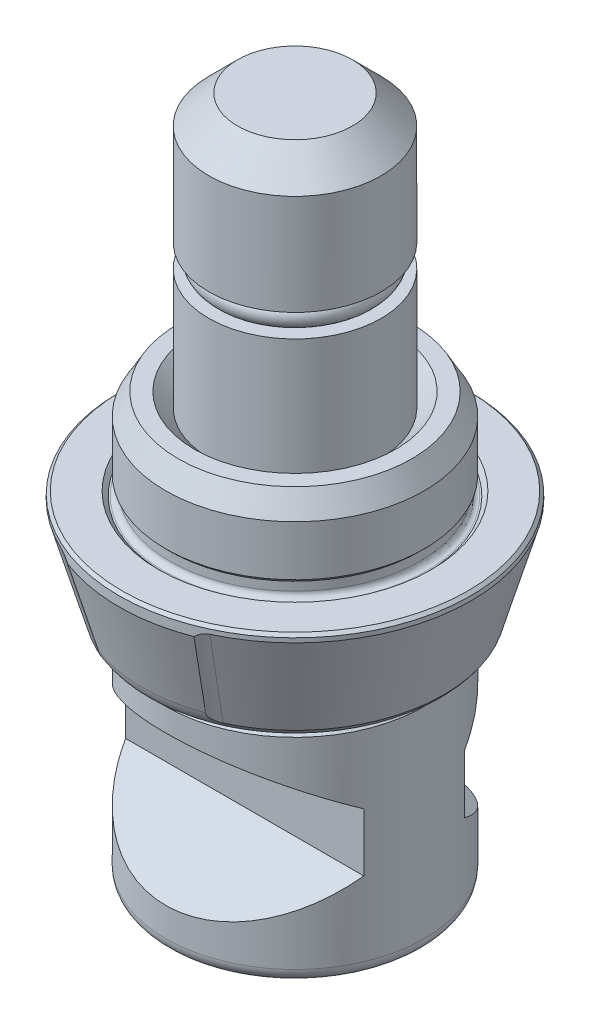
ISO-10303-21;
HEADER;
FILE_DESCRIPTION(('STEP AP214'),'2;1');
FILE_NAME('part.step','',(''),(''),'','','');
FILE_SCHEMA(('AUTOMOTIVE_DESIGN { 1 0 10303 214 1 1 1 1 }'));
ENDSEC;
DATA;
#1=APPLICATION_CONTEXT('core data for automotive mechanical design processes');
#2=APPLICATION_PROTOCOL_DEFINITION('international standard','automotive_design',2000,#1);
#3=PRODUCT_CONTEXT('',#1,'mechanical');
#4=PRODUCT('Part','Part','',(#3));
#5=PRODUCT_RELATED_PRODUCT_CATEGORY('part','',(#4));
#6=PRODUCT_DEFINITION_FORMATION('','',#4);
#7=PRODUCT_DEFINITION_CONTEXT('part definition',#1,'design');
#8=PRODUCT_DEFINITION('design','',#6,#7);
#9=PRODUCT_DEFINITION_SHAPE('','',#8);
#10=(LENGTH_UNIT() NAMED_UNIT(*) SI_UNIT(.MILLI.,.METRE.));
#11=(NAMED_UNIT(*) PLANE_ANGLE_UNIT() SI_UNIT($,.RADIAN.));
#12=(NAMED_UNIT(*) SI_UNIT($,.STERADIAN.) SOLID_ANGLE_UNIT());
#13=UNCERTAINTY_MEASURE_WITH_UNIT(LENGTH_MEASURE(1.E-05),#10,'distance_accuracy_value','');
#14=(GEOMETRIC_REPRESENTATION_CONTEXT(3) GLOBAL_UNCERTAINTY_ASSIGNED_CONTEXT((#13)) GLOBAL_UNIT_ASSIGNED_CONTEXT((#10,
#11,#12)) REPRESENTATION_CONTEXT('',''));
#15=CARTESIAN_POINT('',(0.,0.,0.));
#16=DIRECTION('',(0.,0.,1.));
#17=DIRECTION('',(1.,0.,0.));
#18=AXIS2_PLACEMENT_3D('',#15,#16,#17);
#19=CARTESIAN_POINT('',(15.,-13.2754264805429,3.5));
#20=DIRECTION('',(0.,0.,-1.));
#21=DIRECTION('',(0.,-1.,0.));
#22=AXIS2_PLACEMENT_3D('',#19,#20,#21);
#23=PLANE('',#22);
#24=DIRECTION('',(-1.,0.,0.));
#25=VECTOR('',#24,1.);
#26=CARTESIAN_POINT('',(15.,-13.2754264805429,3.5));
#27=LINE('',#26,#25);
#28=CARTESIAN_POINT('',(8.2915619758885,-13.2754264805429,3.5));
#29=VERTEX_POINT('',#28);
#30=CARTESIAN_POINT('',(-8.2915619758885,-13.2754264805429,3.5));
#31=VERTEX_POINT('',#30);
#32=EDGE_CURVE('E1076',#29,#31,#27,.T.);
#33=ORIENTED_EDGE('',*,*,#32,.T.);
#34=DIRECTION('',(0.,1.,0.));
#35=VECTOR('',#34,1.);
#36=CARTESIAN_POINT('',(-8.2915619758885,-21.625,3.5));
#37=LINE('',#36,#35);
#38=CARTESIAN_POINT('',(-8.2915619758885,-17.3245735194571,3.5));
#39=VERTEX_POINT('',#38);
#40=EDGE_CURVE('E1098',#39,#31,#37,.T.);
#41=ORIENTED_EDGE('',*,*,#40,.F.);
#42=DIRECTION('',(-1.,0.,0.));
#43=VECTOR('',#42,1.);
#44=CARTESIAN_POINT('',(15.,-17.3245735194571,3.5));
#45=LINE('',#44,#43);
#46=CARTESIAN_POINT('',(8.2915619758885,-17.3245735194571,3.5));
#47=VERTEX_POINT('',#46);
#48=EDGE_CURVE('E1077',#47,#39,#45,.T.);
#49=ORIENTED_EDGE('',*,*,#48,.F.);
#50=DIRECTION('',(0.,1.,0.));
#51=VECTOR('',#50,1.);
#52=CARTESIAN_POINT('',(8.2915619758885,-21.625,3.5));
#53=LINE('',#52,#51);
#54=EDGE_CURVE('E1100',#29,#47,#53,.F.);
#55=ORIENTED_EDGE('',*,*,#54,.F.);
#56=EDGE_LOOP('',(#33,#41,#49,#55));
#57=FACE_BOUND('',#56,.T.);
#58=ADVANCED_FACE('F16',(#57),#23,.F.);
#59=CARTESIAN_POINT('',(15.,-13.2754264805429,-3.5));
#60=DIRECTION('',(0.,0.,-1.));
#61=DIRECTION('',(0.,-1.,0.));
#62=AXIS2_PLACEMENT_3D('',#59,#60,#61);
#63=PLANE('',#62);
#64=DIRECTION('',(0.,1.,0.));
#65=VECTOR('',#64,1.);
#66=CARTESIAN_POINT('',(8.2915619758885,-21.625,-3.5));
#67=LINE('',#66,#65);
#68=CARTESIAN_POINT('',(8.2915619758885,-13.2754264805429,-3.5));
#69=VERTEX_POINT('',#68);
#70=CARTESIAN_POINT('',(8.2915619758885,-17.3245735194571,-3.5));
#71=VERTEX_POINT('',#70);
#72=EDGE_CURVE('E1108',#69,#71,#67,.F.);
#73=ORIENTED_EDGE('',*,*,#72,.T.);
#74=DIRECTION('',(-1.,0.,0.));
#75=VECTOR('',#74,1.);
#76=CARTESIAN_POINT('',(15.,-17.3245735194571,-3.5));
#77=LINE('',#76,#75);
#78=CARTESIAN_POINT('',(-8.2915619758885,-17.3245735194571,-3.5));
#79=VERTEX_POINT('',#78);
#80=EDGE_CURVE('E1080',#71,#79,#77,.T.);
#81=ORIENTED_EDGE('',*,*,#80,.T.);
#82=DIRECTION('',(0.,1.,0.));
#83=VECTOR('',#82,1.);
#84=CARTESIAN_POINT('',(-8.2915619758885,-21.625,-3.5));
#85=LINE('',#84,#83);
#86=CARTESIAN_POINT('',(-8.2915619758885,-13.2754264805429,-3.5));
#87=VERTEX_POINT('',#86);
#88=EDGE_CURVE('E1106',#79,#87,#85,.T.);
#89=ORIENTED_EDGE('',*,*,#88,.T.);
#90=DIRECTION('',(-1.,0.,0.));
#91=VECTOR('',#90,1.);
#92=CARTESIAN_POINT('',(15.,-13.2754264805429,-3.5));
#93=LINE('',#92,#91);
#94=EDGE_CURVE('E1082',#69,#87,#93,.T.);
#95=ORIENTED_EDGE('',*,*,#94,.F.);
#96=EDGE_LOOP('',(#73,#81,#89,#95));
#97=FACE_BOUND('',#96,.T.);
#98=ADVANCED_FACE('F602',(#97),#63,.T.);
#99=CARTESIAN_POINT('',(9.,-23.5,0.));
#100=DIRECTION('',(0.,-1.,0.));
#101=DIRECTION('',(-1.,0.,0.));
#102=AXIS2_PLACEMENT_3D('',#99,#100,#101);
#103=PLANE('',#102);
#104=CARTESIAN_POINT('',(-3.14956656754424,-23.5,6.07458758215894));
#105=CARTESIAN_POINT('',(-3.14303520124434,-23.5,6.05639311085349));
#106=CARTESIAN_POINT('',(-3.13026961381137,-23.5,6.02083192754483));
#107=CARTESIAN_POINT('',(-3.10685695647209,-23.5,5.97036021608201));
#108=CARTESIAN_POINT('',(-3.08008499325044,-23.5,5.92427474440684));
#109=CARTESIAN_POINT('',(-3.05012531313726,-23.5,5.88235453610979));
#110=CARTESIAN_POINT('',(-3.01673045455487,-23.5,5.84473058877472));
#111=CARTESIAN_POINT('',(-2.9797507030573,-23.5,5.81158513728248));
#112=CARTESIAN_POINT('',(-2.94010034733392,-23.5,5.78171781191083));
#113=CARTESIAN_POINT('',(-2.91098090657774,-23.5,5.76617624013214));
#114=CARTESIAN_POINT('',(-2.89636239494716,-23.5,5.75837407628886));
#115=B_SPLINE_CURVE_WITH_KNOTS('',3,(#104,#105,#106,#107,#108,#109,#110,#111,#112,#113,#114),
.UNSPECIFIED.,.F.,.F.,(4,1,1,1,1,1,1,1,4),(0.,0.139326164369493,0.272313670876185,
0.400491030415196,0.523062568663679,0.643228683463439,0.762351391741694,0.880695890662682,1.),.UNSPECIFIED.);
#116=CARTESIAN_POINT('',(-3.14956656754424,-23.5,6.07458758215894));
#117=VERTEX_POINT('',#116);
#118=CARTESIAN_POINT('',(-2.89636239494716,-23.5,5.75837407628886));
#119=VERTEX_POINT('',#118);
#120=EDGE_CURVE('E706',#117,#119,#115,.T.);
#121=ORIENTED_EDGE('',*,*,#120,.T.);
#122=CARTESIAN_POINT('',(-2.89636239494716,-23.5,5.75837407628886));
#123=CARTESIAN_POINT('',(-2.88461862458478,-23.5,5.75283022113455));
#124=CARTESIAN_POINT('',(-2.86090239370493,-23.5,5.74163455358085));
#125=CARTESIAN_POINT('',(-2.82300997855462,-23.5,5.73017966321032));
#126=CARTESIAN_POINT('',(-2.78344083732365,-23.5,5.72320347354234));
#127=CARTESIAN_POINT('',(-2.74238109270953,-23.5,5.72032789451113));
#128=CARTESIAN_POINT('',(-2.69940753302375,-23.5,5.7216144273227));
#129=CARTESIAN_POINT('',(-2.65473279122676,-23.5,5.72696733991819));
#130=CARTESIAN_POINT('',(-2.60818475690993,-23.5,5.7361759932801));
#131=CARTESIAN_POINT('',(-2.57734727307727,-23.5,5.74582473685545));
#132=CARTESIAN_POINT('',(-2.56147945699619,-23.5,5.75078961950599));
#133=B_SPLINE_CURVE_WITH_KNOTS('',3,(#122,#123,#124,#125,#126,#127,#128,#129,#130,#131,#132),
.UNSPECIFIED.,.F.,.F.,(4,1,1,1,1,1,1,1,4),(0.,0.113150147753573,0.228503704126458,
0.343956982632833,0.462992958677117,0.586861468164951,0.718357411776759,0.855077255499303,1.),.UNSPECIFIED.);
#134=CARTESIAN_POINT('',(-2.56147945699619,-23.5,5.75078961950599));
#135=VERTEX_POINT('',#134);
#136=EDGE_CURVE('E32',#119,#135,#133,.T.);
#137=ORIENTED_EDGE('',*,*,#136,.T.);
#138=CARTESIAN_POINT('',(-2.56147945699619,-23.5,5.75078961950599));
#139=CARTESIAN_POINT('',(-2.54560241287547,-23.5,5.75631865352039));
#140=CARTESIAN_POINT('',(-2.51467867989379,-23.5,5.76708755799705));
#141=CARTESIAN_POINT('',(-2.47118707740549,-23.5,5.78808103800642));
#142=CARTESIAN_POINT('',(-2.43063675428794,-23.5,5.81090562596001));
#143=CARTESIAN_POINT('',(-2.39461943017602,-23.5,5.83822805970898));
#144=CARTESIAN_POINT('',(-2.36125893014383,-23.5,5.86736548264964));
#145=CARTESIAN_POINT('',(-2.33244233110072,-23.5,5.9002811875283));
#146=CARTESIAN_POINT('',(-2.30601453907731,-23.5,5.93544582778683));
#147=CARTESIAN_POINT('',(-2.29201817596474,-23.5,5.9612081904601));
#148=CARTESIAN_POINT('',(-2.284938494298,-23.5,5.97423938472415));
#149=B_SPLINE_CURVE_WITH_KNOTS('',3,(#138,#139,#140,#141,#142,#143,#144,#145,#146,#147,#148),
.UNSPECIFIED.,.F.,.F.,(4,1,1,1,1,1,1,1,4),(0.,0.138004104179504,0.268790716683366,
0.396216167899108,0.519559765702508,0.639503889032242,0.759448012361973,0.878323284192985,1.),.UNSPECIFIED.);
#150=CARTESIAN_POINT('',(-2.284938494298,-23.5,5.97423938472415));
#151=VERTEX_POINT('',#150);
#152=EDGE_CURVE('E36',#135,#151,#149,.T.);
#153=ORIENTED_EDGE('',*,*,#152,.T.);
#154=CARTESIAN_POINT('',(-2.284938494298,-23.5,5.97423938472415));
#155=CARTESIAN_POINT('',(-2.27852282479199,-23.5,5.98770029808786));
#156=CARTESIAN_POINT('',(-2.26563752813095,-23.5,6.01473533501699));
#157=CARTESIAN_POINT('',(-2.25326047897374,-23.5,6.05831062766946));
#158=CARTESIAN_POINT('',(-2.24495719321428,-23.5,6.10362960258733));
#159=CARTESIAN_POINT('',(-2.24139814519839,-23.5,6.1511665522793));
#160=CARTESIAN_POINT('',(-2.24343849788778,-23.5,6.2007959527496));
#161=CARTESIAN_POINT('',(-2.24999039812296,-23.5,6.25228698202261));
#162=CARTESIAN_POINT('',(-2.26097916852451,-23.5,6.30584734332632));
#163=CARTESIAN_POINT('',(-2.27216664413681,-23.5,6.34149287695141));
#164=CARTESIAN_POINT('',(-2.27793745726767,-23.5,6.35987984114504));
#165=B_SPLINE_CURVE_WITH_KNOTS('',3,(#154,#155,#156,#157,#158,#159,#160,#161,#162,#163,#164),
.UNSPECIFIED.,.F.,.F.,(4,1,1,1,1,1,1,1,4),(0.,0.112752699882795,0.2264536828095,
0.341717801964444,0.461340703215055,0.586605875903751,0.717220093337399,0.854134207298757,1.),.UNSPECIFIED.);
#166=CARTESIAN_POINT('',(-2.27793745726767,-23.5,6.35987984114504));
#167=VERTEX_POINT('',#166);
#168=EDGE_CURVE('E671',#151,#167,#165,.T.);
#169=ORIENTED_EDGE('',*,*,#168,.T.);
#170=CARTESIAN_POINT('',(-2.27793745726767,-23.5,6.35987984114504));
#171=CARTESIAN_POINT('',(-2.28424215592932,-23.5,6.37808261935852));
#172=CARTESIAN_POINT('',(-2.29658585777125,-23.5,6.41372106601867));
#173=CARTESIAN_POINT('',(-2.31988120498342,-23.5,6.4640359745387));
#174=CARTESIAN_POINT('',(-2.34724251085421,-23.5,6.50971582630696));
#175=CARTESIAN_POINT('',(-2.37649207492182,-23.5,6.55233532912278));
#176=CARTESIAN_POINT('',(-2.41087597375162,-23.5,6.58923724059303));
#177=CARTESIAN_POINT('',(-2.44699189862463,-23.5,6.62340657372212));
#178=CARTESIAN_POINT('',(-2.48771216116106,-23.5,6.65181899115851));
#179=CARTESIAN_POINT('',(-2.51661094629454,-23.5,6.66797160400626));
#180=CARTESIAN_POINT('',(-2.53114162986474,-23.5,6.67609334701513));
#181=B_SPLINE_CURVE_WITH_KNOTS('',3,(#170,#171,#172,#173,#174,#175,#176,#177,#178,#179,#180),
.UNSPECIFIED.,.F.,.F.,(4,1,1,1,1,1,1,1,4),(0.,0.138788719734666,0.271728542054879,
0.398650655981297,0.522319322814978,0.643379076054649,0.761423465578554,0.880040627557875,1.),.UNSPECIFIED.);
#182=CARTESIAN_POINT('',(-2.53114162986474,-23.5,6.67609334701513));
#183=VERTEX_POINT('',#182);
#184=EDGE_CURVE('E678',#167,#183,#181,.T.);
#185=ORIENTED_EDGE('',*,*,#184,.T.);
#186=CARTESIAN_POINT('',(-2.53114162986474,-23.5,6.67609334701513));
#187=CARTESIAN_POINT('',(-2.55778893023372,-23.5,6.68782690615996));
#188=CARTESIAN_POINT('',(-2.61034716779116,-23.5,6.71096978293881));
#189=CARTESIAN_POINT('',(-2.69611388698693,-23.5,6.72414712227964));
#190=CARTESIAN_POINT('',(-2.7841962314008,-23.5,6.72215912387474));
#191=CARTESIAN_POINT('',(-2.84135159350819,-23.5,6.70598351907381));
#192=CARTESIAN_POINT('',(-2.87069192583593,-23.5,6.69767987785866));
#193=B_SPLINE_CURVE_WITH_KNOTS('',3,(#186,#187,#188,#189,#190,#191,#192),.UNSPECIFIED.,.F.,.F.,
(4,1,1,1,4),(0.,0.249194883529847,0.491503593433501,0.738966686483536,1.),.UNSPECIFIED.);
#194=CARTESIAN_POINT('',(-2.87069192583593,-23.5,6.69767987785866));
#195=VERTEX_POINT('',#194);
#196=EDGE_CURVE('E685',#183,#195,#193,.T.);
#197=ORIENTED_EDGE('',*,*,#196,.T.);
#198=CARTESIAN_POINT('',(-2.87069192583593,-23.5,6.69767987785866));
#199=CARTESIAN_POINT('',(-2.89928964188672,-23.5,6.68699254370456));
#200=CARTESIAN_POINT('',(-2.95487027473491,-23.5,6.66622134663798));
#201=CARTESIAN_POINT('',(-3.02713896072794,-23.5,6.61578965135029));
#202=CARTESIAN_POINT('',(-3.08896145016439,-23.5,6.55477244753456));
#203=CARTESIAN_POINT('',(-3.11758064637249,-23.5,6.50478039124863));
#204=CARTESIAN_POINT('',(-3.1320639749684,-23.5,6.47948089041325));
#205=B_SPLINE_CURVE_WITH_KNOTS('',3,(#198,#199,#200,#201,#202,#203,#204),.UNSPECIFIED.,.F.,.F.,
(4,1,1,1,4),(0.,0.261138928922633,0.507532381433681,0.750776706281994,1.),.UNSPECIFIED.);
#206=CARTESIAN_POINT('',(-3.1320639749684,-23.5,6.47948089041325));
#207=VERTEX_POINT('',#206);
#208=EDGE_CURVE('E692',#195,#207,#205,.T.);
#209=ORIENTED_EDGE('',*,*,#208,.T.);
#210=CARTESIAN_POINT('',(-3.1320639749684,-23.5,6.47948089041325));
#211=CARTESIAN_POINT('',(-3.13929792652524,-23.5,6.46448073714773));
#212=CARTESIAN_POINT('',(-3.15370470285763,-23.5,6.43460718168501));
#213=CARTESIAN_POINT('',(-3.16766439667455,-23.5,6.38686125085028));
#214=CARTESIAN_POINT('',(-3.17802388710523,-23.5,6.3383241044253));
#215=CARTESIAN_POINT('',(-3.18233685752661,-23.5,6.28822346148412));
#216=CARTESIAN_POINT('',(-3.18274134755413,-23.5,6.23660738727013));
#217=CARTESIAN_POINT('',(-3.17628411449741,-23.5,6.18357065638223));
#218=CARTESIAN_POINT('',(-3.16616215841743,-23.5,6.12899306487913));
#219=CARTESIAN_POINT('',(-3.15517483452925,-23.5,6.09297321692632));
#220=CARTESIAN_POINT('',(-3.14956656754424,-23.5,6.07458758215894));
#221=B_SPLINE_CURVE_WITH_KNOTS('',3,(#210,#211,#212,#213,#214,#215,#216,#217,#218,#219,#220),
.UNSPECIFIED.,.F.,.F.,(4,1,1,1,1,1,1,1,4),(0.,0.119838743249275,0.238664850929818,
0.357424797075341,0.477099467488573,0.600452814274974,0.728779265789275,0.861560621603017,1.),.UNSPECIFIED.);
#222=EDGE_CURVE('E699',#207,#117,#221,.T.);
#223=ORIENTED_EDGE('',*,*,#222,.T.);
#224=EDGE_LOOP('',(#121,#137,#153,#169,#185,#197,#209,#223));
#225=FACE_BOUND('',#224,.T.);
#226=ADVANCED_FACE('F609',(#225),#103,.T.);
#227=CARTESIAN_POINT('',(-2.71141833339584,-23.5,4.93750248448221));
#228=CARTESIAN_POINT('',(-2.70506203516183,-23.5,4.91931831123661));
#229=CARTESIAN_POINT('',(-2.69272898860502,-23.5,4.88403578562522));
#230=CARTESIAN_POINT('',(-2.67051958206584,-23.5,4.83417495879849));
#231=CARTESIAN_POINT('',(-2.64551083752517,-23.5,4.78893498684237));
#232=CARTESIAN_POINT('',(-2.61718997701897,-23.5,4.74858277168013));
#233=CARTESIAN_POINT('',(-2.58700349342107,-23.5,4.71199706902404));
#234=CARTESIAN_POINT('',(-2.55350300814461,-23.5,4.6802803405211));
#235=CARTESIAN_POINT('',(-2.51715123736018,-23.5,4.65320722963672));
#236=CARTESIAN_POINT('',(-2.49105353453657,-23.5,4.63852332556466));
#237=CARTESIAN_POINT('',(-2.47805043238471,-23.5,4.6312071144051));
#238=B_SPLINE_CURVE_WITH_KNOTS('',3,(#227,#228,#229,#230,#231,#232,#233,#234,#235,#236,#237),
.UNSPECIFIED.,.F.,.F.,(4,1,1,1,1,1,1,1,4),(0.,0.146117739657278,0.283510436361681,
0.413651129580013,0.537683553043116,0.657091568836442,0.772954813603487,0.886875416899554,1.),.UNSPECIFIED.);
#239=CARTESIAN_POINT('',(-2.71141833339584,-23.5,4.93750248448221));
#240=VERTEX_POINT('',#239);
#241=CARTESIAN_POINT('',(-2.47805043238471,-23.5,4.6312071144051));
#242=VERTEX_POINT('',#241);
#243=EDGE_CURVE('E762',#240,#242,#238,.T.);
#244=ORIENTED_EDGE('',*,*,#243,.T.);
#245=CARTESIAN_POINT('',(-2.47805043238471,-23.5,4.6312071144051));
#246=CARTESIAN_POINT('',(-2.45485892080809,-23.5,4.62082081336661));
#247=CARTESIAN_POINT('',(-2.40940606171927,-23.5,4.60046478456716));
#248=CARTESIAN_POINT('',(-2.33584295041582,-23.5,4.58818927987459));
#249=CARTESIAN_POINT('',(-2.26107643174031,-23.5,4.58916013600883));
#250=CARTESIAN_POINT('',(-2.21280909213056,-23.5,4.60230534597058));
#251=CARTESIAN_POINT('',(-2.18809081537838,-23.5,4.60903716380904));
#252=B_SPLINE_CURVE_WITH_KNOTS('',3,(#245,#246,#247,#248,#249,#250,#251),.UNSPECIFIED.,.F.,.F.,
(4,1,1,1,4),(0.,0.254539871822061,0.498870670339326,0.743365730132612,1.),.UNSPECIFIED.);
#253=CARTESIAN_POINT('',(-2.18809081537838,-23.5,4.60903716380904));
#254=VERTEX_POINT('',#253);
#255=EDGE_CURVE('E713',#242,#254,#252,.T.);
#256=ORIENTED_EDGE('',*,*,#255,.T.);
#257=CARTESIAN_POINT('',(-2.18809081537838,-23.5,4.60903716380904));
#258=CARTESIAN_POINT('',(-2.16426949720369,-23.5,4.61819788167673));
#259=CARTESIAN_POINT('',(-2.11766186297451,-23.5,4.6361212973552));
#260=CARTESIAN_POINT('',(-2.05642500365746,-23.5,4.67917356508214));
#261=CARTESIAN_POINT('',(-2.00398867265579,-23.5,4.73270940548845));
#262=CARTESIAN_POINT('',(-1.97946566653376,-23.5,4.77639637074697));
#263=CARTESIAN_POINT('',(-1.96697472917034,-23.5,4.79864858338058));
#264=B_SPLINE_CURVE_WITH_KNOTS('',3,(#257,#258,#259,#260,#261,#262,#263),.UNSPECIFIED.,.F.,.F.,
(4,1,1,1,4),(0.,0.255196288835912,0.499304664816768,0.744967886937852,1.),.UNSPECIFIED.);
#265=CARTESIAN_POINT('',(-1.96697472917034,-23.5,4.79864858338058));
#266=VERTEX_POINT('',#265);
#267=EDGE_CURVE('E720',#254,#266,#264,.T.);
#268=ORIENTED_EDGE('',*,*,#267,.T.);
#269=CARTESIAN_POINT('',(-1.96697472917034,-23.5,4.79864858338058));
#270=CARTESIAN_POINT('',(-1.96087672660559,-23.5,4.81215061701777));
#271=CARTESIAN_POINT('',(-1.94857389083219,-23.5,4.83939122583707));
#272=CARTESIAN_POINT('',(-1.93487692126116,-23.5,4.88252243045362));
#273=CARTESIAN_POINT('',(-1.9279118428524,-23.5,4.92793702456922));
#274=CARTESIAN_POINT('',(-1.92386209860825,-23.5,4.97498348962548));
#275=CARTESIAN_POINT('',(-1.92636497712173,-23.5,5.02417762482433));
#276=CARTESIAN_POINT('',(-1.93158367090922,-23.5,5.07566731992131));
#277=CARTESIAN_POINT('',(-1.94397822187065,-23.5,5.128908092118));
#278=CARTESIAN_POINT('',(-1.95453933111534,-23.5,5.16470329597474));
#279=CARTESIAN_POINT('',(-1.95997369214,-23.5,5.18312220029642));
#280=B_SPLINE_CURVE_WITH_KNOTS('',3,(#269,#270,#271,#272,#273,#274,#275,#276,#277,#278,#279),
.UNSPECIFIED.,.F.,.F.,(4,1,1,1,1,1,1,1,4),(0.,0.112573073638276,0.227118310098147,
0.342547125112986,0.461131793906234,0.585376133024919,0.716291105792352,0.854013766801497,1.),.UNSPECIFIED.);
#281=CARTESIAN_POINT('',(-1.95997369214,-23.5,5.18312220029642));
#282=VERTEX_POINT('',#281);
#283=EDGE_CURVE('E727',#266,#282,#280,.T.);
#284=ORIENTED_EDGE('',*,*,#283,.T.);
#285=CARTESIAN_POINT('',(-1.95997369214,-23.5,5.18312220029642));
#286=CARTESIAN_POINT('',(-1.96594497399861,-23.5,5.20013668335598));
#287=CARTESIAN_POINT('',(-1.9775086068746,-23.5,5.23308592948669));
#288=CARTESIAN_POINT('',(-1.99866035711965,-23.5,5.27991809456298));
#289=CARTESIAN_POINT('',(-2.02326781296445,-23.5,5.32223985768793));
#290=CARTESIAN_POINT('',(-2.04997375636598,-23.5,5.3614072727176));
#291=CARTESIAN_POINT('',(-2.08054428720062,-23.5,5.39565764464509));
#292=CARTESIAN_POINT('',(-2.11335895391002,-23.5,5.42637174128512));
#293=CARTESIAN_POINT('',(-2.14909287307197,-23.5,5.45301017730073));
#294=CARTESIAN_POINT('',(-2.17507125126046,-23.5,5.46715813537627));
#295=CARTESIAN_POINT('',(-2.18809081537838,-23.5,5.4742486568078));
#296=B_SPLINE_CURVE_WITH_KNOTS('',3,(#285,#286,#287,#288,#289,#290,#291,#292,#293,#294,#295),
.UNSPECIFIED.,.F.,.F.,(4,1,1,1,1,1,1,1,4),(0.,0.142348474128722,0.27566367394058,
0.404992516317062,0.528530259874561,0.64929781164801,0.766648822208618,0.883051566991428,1.),.UNSPECIFIED.);
#297=CARTESIAN_POINT('',(-2.18809081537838,-23.5,5.4742486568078));
#298=VERTEX_POINT('',#297);
#299=EDGE_CURVE('E734',#282,#298,#296,.T.);
#300=ORIENTED_EDGE('',*,*,#299,.T.);
#301=CARTESIAN_POINT('',(-2.18809081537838,-23.5,5.4742486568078));
#302=CARTESIAN_POINT('',(-2.21091729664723,-23.5,5.48450354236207));
#303=CARTESIAN_POINT('',(-2.2553392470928,-23.5,5.50446027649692));
#304=CARTESIAN_POINT('',(-2.32584515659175,-23.5,5.51841473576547));
#305=CARTESIAN_POINT('',(-2.39596923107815,-23.5,5.51856078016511));
#306=CARTESIAN_POINT('',(-2.44047298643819,-23.5,5.50693817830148));
#307=CARTESIAN_POINT('',(-2.46288151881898,-23.5,5.50108596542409));
#308=B_SPLINE_CURVE_WITH_KNOTS('',3,(#301,#302,#303,#304,#305,#306,#307),.UNSPECIFIED.,.F.,.F.,
(4,1,1,1,4),(0.,0.264362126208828,0.51446743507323,0.755524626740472,1.),.UNSPECIFIED.);
#309=CARTESIAN_POINT('',(-2.46288151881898,-23.5,5.50108596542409));
#310=VERTEX_POINT('',#309);
#311=EDGE_CURVE('E741',#298,#310,#308,.T.);
#312=ORIENTED_EDGE('',*,*,#311,.T.);
#313=CARTESIAN_POINT('',(-2.46288151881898,-23.5,5.50108596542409));
#314=CARTESIAN_POINT('',(-2.49091187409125,-23.5,5.49091631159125));
#315=CARTESIAN_POINT('',(-2.54376150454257,-23.5,5.47174201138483));
#316=CARTESIAN_POINT('',(-2.61284670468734,-23.5,5.4304583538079));
#317=CARTESIAN_POINT('',(-2.66768941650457,-23.5,5.38115101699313));
#318=CARTESIAN_POINT('',(-2.69202922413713,-23.5,5.34130241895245));
#319=CARTESIAN_POINT('',(-2.70383387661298,-23.5,5.32197610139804));
#320=B_SPLINE_CURVE_WITH_KNOTS('',3,(#313,#314,#315,#316,#317,#318,#319),.UNSPECIFIED.,.F.,.F.,
(4,1,1,1,4),(0.,0.290048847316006,0.546870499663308,0.780235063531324,1.),.UNSPECIFIED.);
#321=CARTESIAN_POINT('',(-2.70383387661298,-23.5,5.32197610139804));
#322=VERTEX_POINT('',#321);
#323=EDGE_CURVE('E748',#310,#322,#320,.T.);
#324=ORIENTED_EDGE('',*,*,#323,.T.);
#325=CARTESIAN_POINT('',(-2.70383387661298,-23.5,5.32197610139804));
#326=CARTESIAN_POINT('',(-2.71024927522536,-23.5,5.30851518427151));
#327=CARTESIAN_POINT('',(-2.72313402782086,-23.5,5.28148013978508));
#328=CARTESIAN_POINT('',(-2.73551520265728,-23.5,5.23790490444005));
#329=CARTESIAN_POINT('',(-2.7437674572,-23.5,5.19277665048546));
#330=CARTESIAN_POINT('',(-2.74739115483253,-23.5,5.14563313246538));
#331=CARTESIAN_POINT('',(-2.74529204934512,-23.5,5.09639526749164));
#332=CARTESIAN_POINT('',(-2.7388177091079,-23.5,5.04508589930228));
#333=CARTESIAN_POINT('',(-2.72766985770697,-23.5,4.99162667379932));
#334=CARTESIAN_POINT('',(-2.7169436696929,-23.5,4.95590410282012));
#335=CARTESIAN_POINT('',(-2.71141833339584,-23.5,4.93750248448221));
#336=B_SPLINE_CURVE_WITH_KNOTS('',3,(#325,#326,#327,#328,#329,#330,#331,#332,#333,#334,#335),
.UNSPECIFIED.,.F.,.F.,(4,1,1,1,1,1,1,1,4),(0.,0.113131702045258,0.227214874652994,
0.342866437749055,0.461417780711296,0.585627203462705,0.716680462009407,0.854054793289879,1.),.UNSPECIFIED.);
#337=EDGE_CURVE('E755',#322,#240,#336,.T.);
#338=ORIENTED_EDGE('',*,*,#337,.T.);
#339=EDGE_LOOP('',(#244,#256,#268,#284,#300,#312,#324,#338));
#340=FACE_BOUND('',#339,.T.);
#341=ADVANCED_FACE('F1256',(#340),#103,.T.);
#342=CARTESIAN_POINT('',(0.,-23.5,0.));
#343=DIRECTION('',(0.,1.,0.));
#344=DIRECTION('',(0.,0.,-1.));
#345=AXIS2_PLACEMENT_3D('',#342,#343,#344);
#346=CIRCLE('',#345,3.2);
#347=CARTESIAN_POINT('',(0.,-23.5,-3.2));
#348=VERTEX_POINT('',#347);
#349=EDGE_CURVE('E515',#348,#348,#346,.T.);
#350=ORIENTED_EDGE('',*,*,#349,.T.);
#351=EDGE_LOOP('',(#350));
#352=FACE_BOUND('',#351,.T.);
#353=CARTESIAN_POINT('',(0.,-23.5,0.));
#354=DIRECTION('',(0.,-1.,0.));
#355=DIRECTION('',(-1.,0.,0.));
#356=AXIS2_PLACEMENT_3D('',#353,#354,#355);
#357=CIRCLE('',#356,8.);
#358=CARTESIAN_POINT('',(-8.,-23.5,0.));
#359=VERTEX_POINT('',#358);
#360=EDGE_CURVE('E1059',#359,#359,#357,.T.);
#361=ORIENTED_EDGE('',*,*,#360,.T.);
#362=EDGE_LOOP('',(#361));
#363=FACE_BOUND('',#362,.T.);
#364=DIRECTION('',(-0.977877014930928,0.,0.209180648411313));
#365=VECTOR('',#364,1.);
#366=CARTESIAN_POINT('',(1.48811723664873,-23.5,4.03409705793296));
#367=LINE('',#366,#365);
#368=CARTESIAN_POINT('',(1.48811723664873,-23.5,4.03409705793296));
#369=VERTEX_POINT('',#368);
#370=CARTESIAN_POINT('',(1.15265087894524,-23.5,4.10585768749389));
#371=VERTEX_POINT('',#370);
#372=EDGE_CURVE('E1046',#369,#371,#367,.T.);
#373=ORIENTED_EDGE('',*,*,#372,.T.);
#374=DIRECTION('',(0.208929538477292,0.,0.977930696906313));
#375=VECTOR('',#374,1.);
#376=CARTESIAN_POINT('',(1.15265087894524,-23.5,4.10585768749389));
#377=LINE('',#376,#375);
#378=CARTESIAN_POINT('',(1.22207782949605,-23.5,4.43082248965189));
#379=VERTEX_POINT('',#378);
#380=EDGE_CURVE('E978',#371,#379,#377,.T.);
#381=ORIENTED_EDGE('',*,*,#380,.T.);
#382=CARTESIAN_POINT('',(1.22207782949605,-23.5,4.43082248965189));
#383=CARTESIAN_POINT('',(1.17423772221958,-23.5,4.44460825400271));
#384=CARTESIAN_POINT('',(1.08156903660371,-23.5,4.47131197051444));
#385=CARTESIAN_POINT('',(0.950074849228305,-23.5,4.52002007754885));
#386=CARTESIAN_POINT('',(0.829924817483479,-23.5,4.57315373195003));
#387=CARTESIAN_POINT('',(0.721852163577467,-23.5,4.63302039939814));
#388=CARTESIAN_POINT('',(0.625189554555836,-23.5,4.69800465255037));
#389=CARTESIAN_POINT('',(0.540672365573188,-23.5,4.7690957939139));
#390=CARTESIAN_POINT('',(0.466802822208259,-23.5,4.84486658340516));
#391=CARTESIAN_POINT('',(0.427154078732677,-23.5,4.90127649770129));
#392=CARTESIAN_POINT('',(0.407623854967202,-23.5,4.92906295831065));
#393=B_SPLINE_CURVE_WITH_KNOTS('',3,(#382,#383,#384,#385,#386,#387,#388,#389,#390,#391,#392),
.UNSPECIFIED.,.F.,.F.,(4,1,1,1,1,1,1,1,4),(0.,0.153032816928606,0.296432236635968,
0.430788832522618,0.556584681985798,0.675827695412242,0.788293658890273,0.895717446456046,1.),.UNSPECIFIED.);
#394=CARTESIAN_POINT('',(0.407623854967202,-23.5,4.92906295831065));
#395=VERTEX_POINT('',#394);
#396=EDGE_CURVE('E983',#379,#395,#393,.T.);
#397=ORIENTED_EDGE('',*,*,#396,.T.);
#398=CARTESIAN_POINT('',(0.407623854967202,-23.5,4.92906295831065));
#399=CARTESIAN_POINT('',(0.38843622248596,-23.5,4.96076690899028));
#400=CARTESIAN_POINT('',(0.350390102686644,-23.5,5.0236309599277));
#401=CARTESIAN_POINT('',(0.30600099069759,-23.5,5.124561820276));
#402=CARTESIAN_POINT('',(0.272490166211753,-23.5,5.22956882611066));
#403=CARTESIAN_POINT('',(0.250486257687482,-23.5,5.33894580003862));
#404=CARTESIAN_POINT('',(0.23931290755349,-23.5,5.45232353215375));
#405=CARTESIAN_POINT('',(0.239919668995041,-23.5,5.56966516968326));
#406=CARTESIAN_POINT('',(0.249769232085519,-23.5,5.69144492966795));
#407=CARTESIAN_POINT('',(0.265817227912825,-23.5,5.7730028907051));
#408=CARTESIAN_POINT('',(0.27402073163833,-23.5,5.81469414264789));
#409=B_SPLINE_CURVE_WITH_KNOTS('',3,(#398,#399,#400,#401,#402,#403,#404,#405,#406,#407,#408),
.UNSPECIFIED.,.F.,.F.,(4,1,1,1,1,1,1,1,4),(0.,0.120713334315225,0.239355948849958,
0.358460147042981,0.479444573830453,0.602401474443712,0.729204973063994,0.861573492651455,1.),.UNSPECIFIED.);
#410=CARTESIAN_POINT('',(0.27402073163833,-23.5,5.81469414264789));
#411=VERTEX_POINT('',#410);
#412=EDGE_CURVE('E987',#395,#411,#409,.T.);
#413=ORIENTED_EDGE('',*,*,#412,.T.);
#414=CARTESIAN_POINT('',(0.27402073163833,-23.5,5.81469414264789));
#415=CARTESIAN_POINT('',(0.283815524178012,-23.5,5.85611696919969));
#416=CARTESIAN_POINT('',(0.302941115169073,-23.5,5.93700036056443));
#417=CARTESIAN_POINT('',(0.342950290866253,-23.5,6.05266000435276));
#418=CARTESIAN_POINT('',(0.391419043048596,-23.5,6.15956674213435));
#419=CARTESIAN_POINT('',(0.447548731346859,-23.5,6.25856250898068));
#420=CARTESIAN_POINT('',(0.512593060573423,-23.5,6.34904781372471));
#421=CARTESIAN_POINT('',(0.586633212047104,-23.5,6.4306284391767));
#422=CARTESIAN_POINT('',(0.667690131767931,-23.5,6.50551221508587));
#423=CARTESIAN_POINT('',(0.728339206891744,-23.5,6.54701519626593));
#424=CARTESIAN_POINT('',(0.758842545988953,-23.5,6.56788904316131));
#425=B_SPLINE_CURVE_WITH_KNOTS('',3,(#414,#415,#416,#417,#418,#419,#420,#421,#422,#423,#424),
.UNSPECIFIED.,.F.,.F.,(4,1,1,1,1,1,1,1,4),(0.,0.13870388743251,0.270837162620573,
0.398238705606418,0.520917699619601,0.641276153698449,0.760694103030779,0.879641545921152,1.),.UNSPECIFIED.);
#426=CARTESIAN_POINT('',(0.758842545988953,-23.5,6.56788904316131));
#427=VERTEX_POINT('',#426);
#428=EDGE_CURVE('E994',#411,#427,#425,.T.);
#429=ORIENTED_EDGE('',*,*,#428,.T.);
#430=CARTESIAN_POINT('',(0.758842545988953,-23.5,6.56788904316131));
#431=CARTESIAN_POINT('',(0.788021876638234,-23.5,6.5851558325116));
#432=CARTESIAN_POINT('',(0.847476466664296,-23.5,6.62033792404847));
#433=CARTESIAN_POINT('',(0.945691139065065,-23.5,6.6601290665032));
#434=CARTESIAN_POINT('',(1.0521886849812,-23.5,6.68984785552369));
#435=CARTESIAN_POINT('',(1.16696040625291,-23.5,6.70944137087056));
#436=CARTESIAN_POINT('',(1.29014627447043,-23.5,6.71888548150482));
#437=CARTESIAN_POINT('',(1.42158129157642,-23.5,6.71947024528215));
#438=CARTESIAN_POINT('',(1.5615630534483,-23.5,6.70931315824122));
#439=CARTESIAN_POINT('',(1.65699628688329,-23.5,6.69531023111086));
#440=CARTESIAN_POINT('',(1.70631622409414,-23.5,6.68807351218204));
#441=B_SPLINE_CURVE_WITH_KNOTS('',3,(#430,#431,#432,#433,#434,#435,#436,#437,#438,#439,#440),
.UNSPECIFIED.,.F.,.F.,(4,1,1,1,1,1,1,1,4),(0.,0.104072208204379,0.212053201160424,
0.324429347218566,0.443306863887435,0.569211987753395,0.703671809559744,0.846857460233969,1.),.UNSPECIFIED.);
#442=CARTESIAN_POINT('',(1.70631622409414,-23.5,6.68807351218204));
#443=VERTEX_POINT('',#442);
#444=EDGE_CURVE('E1001',#427,#443,#441,.T.);
#445=ORIENTED_EDGE('',*,*,#444,.T.);
#446=DIRECTION('',(0.208904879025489,0.,0.977935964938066));
#447=VECTOR('',#446,1.);
#448=CARTESIAN_POINT('',(1.70631622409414,-23.5,6.68807351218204));
#449=LINE('',#448,#447);
#450=CARTESIAN_POINT('',(1.79966338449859,-23.5,7.12505490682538));
#451=VERTEX_POINT('',#450);
#452=EDGE_CURVE('E1008',#443,#451,#449,.T.);
#453=ORIENTED_EDGE('',*,*,#452,.T.);
#454=DIRECTION('',(0.977877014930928,0.,-0.209180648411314));
#455=VECTOR('',#454,1.);
#456=CARTESIAN_POINT('',(1.79966338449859,-23.5,7.12505490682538));
#457=LINE('',#456,#455);
#458=CARTESIAN_POINT('',(2.13512974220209,-23.5,7.05329427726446));
#459=VERTEX_POINT('',#458);
#460=EDGE_CURVE('E1013',#451,#459,#457,.T.);
#461=ORIENTED_EDGE('',*,*,#460,.T.);
#462=DIRECTION('',(-0.208904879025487,0.,-0.977935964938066));
#463=VECTOR('',#462,1.);
#464=CARTESIAN_POINT('',(2.13512974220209,-23.5,7.05329427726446));
#465=LINE('',#464,#463);
#466=CARTESIAN_POINT('',(2.04178258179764,-23.5,6.61631288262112));
#467=VERTEX_POINT('',#466);
#468=EDGE_CURVE('E1015',#459,#467,#465,.T.);
#469=ORIENTED_EDGE('',*,*,#468,.T.);
#470=CARTESIAN_POINT('',(2.04178258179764,-23.5,6.61631288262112));
#471=CARTESIAN_POINT('',(2.08825813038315,-23.5,6.60290783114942));
#472=CARTESIAN_POINT('',(2.17820174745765,-23.5,6.57696518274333));
#473=CARTESIAN_POINT('',(2.30592430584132,-23.5,6.52946726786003));
#474=CARTESIAN_POINT('',(2.42243665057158,-23.5,6.47675293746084));
#475=CARTESIAN_POINT('',(2.52722211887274,-23.5,6.41772684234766));
#476=CARTESIAN_POINT('',(2.62089645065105,-23.5,6.35365214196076));
#477=CARTESIAN_POINT('',(2.70248833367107,-23.5,6.28307630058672));
#478=CARTESIAN_POINT('',(2.77363818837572,-23.5,6.20750379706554));
#479=CARTESIAN_POINT('',(2.81179779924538,-23.5,6.1514673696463));
#480=CARTESIAN_POINT('',(2.83056608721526,-23.5,6.12390661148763));
#481=B_SPLINE_CURVE_WITH_KNOTS('',3,(#470,#471,#472,#473,#474,#475,#476,#477,#478,#479,#480),
.UNSPECIFIED.,.F.,.F.,(4,1,1,1,1,1,1,1,4),(0.,0.152483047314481,0.29509876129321,
0.429287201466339,0.555325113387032,0.673889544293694,0.786500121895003,0.894992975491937,1.),.UNSPECIFIED.);
#482=CARTESIAN_POINT('',(2.83056608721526,-23.5,6.12390661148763));
#483=VERTEX_POINT('',#482);
#484=EDGE_CURVE('E1017',#467,#483,#481,.T.);
#485=ORIENTED_EDGE('',*,*,#484,.T.);
#486=CARTESIAN_POINT('',(2.83056608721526,-23.5,6.12390661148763));
#487=CARTESIAN_POINT('',(2.84981095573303,-23.5,6.09222817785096));
#488=CARTESIAN_POINT('',(2.88792973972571,-23.5,6.02948192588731));
#489=CARTESIAN_POINT('',(2.93146121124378,-23.5,5.92825620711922));
#490=CARTESIAN_POINT('',(2.9651453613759,-23.5,5.82342200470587));
#491=CARTESIAN_POINT('',(2.98717717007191,-23.5,5.71401663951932));
#492=CARTESIAN_POINT('',(2.99804694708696,-23.5,5.60045866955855));
#493=CARTESIAN_POINT('',(2.99873623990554,-23.5,5.48287462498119));
#494=CARTESIAN_POINT('',(2.98743362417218,-23.5,5.36103509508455));
#495=CARTESIAN_POINT('',(2.97203573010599,-23.5,5.27939865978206));
#496=CARTESIAN_POINT('',(2.96416921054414,-23.5,5.23769200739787));
#497=B_SPLINE_CURVE_WITH_KNOTS('',3,(#486,#487,#488,#489,#490,#491,#492,#493,#494,#495,#496),
.UNSPECIFIED.,.F.,.F.,(4,1,1,1,1,1,1,1,4),(0.,0.120673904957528,0.239021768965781,
0.358087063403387,0.47903197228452,0.601948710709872,0.729346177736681,0.861727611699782,1.),.UNSPECIFIED.);
#498=CARTESIAN_POINT('',(2.96416921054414,-23.5,5.23769200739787));
#499=VERTEX_POINT('',#498);
#500=EDGE_CURVE('E1021',#483,#499,#497,.T.);
#501=ORIENTED_EDGE('',*,*,#500,.T.);
#502=CARTESIAN_POINT('',(2.96416921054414,-23.5,5.23769200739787));
#503=CARTESIAN_POINT('',(2.95436208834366,-23.5,5.19646520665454));
#504=CARTESIAN_POINT('',(2.93517086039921,-23.5,5.11578986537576));
#505=CARTESIAN_POINT('',(2.89519273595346,-23.5,5.00034022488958));
#506=CARTESIAN_POINT('',(2.84692329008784,-23.5,4.89319907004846));
#507=CARTESIAN_POINT('',(2.78977047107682,-23.5,4.7945161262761));
#508=CARTESIAN_POINT('',(2.72541165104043,-23.5,4.70359211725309));
#509=CARTESIAN_POINT('',(2.65133601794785,-23.5,4.62216246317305));
#510=CARTESIAN_POINT('',(2.57050447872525,-23.5,4.54745526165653));
#511=CARTESIAN_POINT('',(2.5098522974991,-23.5,4.50595367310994));
#512=CARTESIAN_POINT('',(2.47934739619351,-23.5,4.48508052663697));
#513=B_SPLINE_CURVE_WITH_KNOTS('',3,(#502,#503,#504,#505,#506,#507,#508,#509,#510,#511,#512),
.UNSPECIFIED.,.F.,.F.,(4,1,1,1,1,1,1,1,4),(0.,0.138183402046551,0.270406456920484,
0.397894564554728,0.520972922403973,0.641928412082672,0.760531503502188,0.879559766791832,1.),.UNSPECIFIED.);
#514=CARTESIAN_POINT('',(2.47934739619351,-23.5,4.48508052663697));
#515=VERTEX_POINT('',#514);
#516=EDGE_CURVE('E1028',#499,#515,#513,.T.);
#517=ORIENTED_EDGE('',*,*,#516,.T.);
#518=CARTESIAN_POINT('',(2.47934739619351,-23.5,4.48508052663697));
#519=CARTESIAN_POINT('',(2.45098814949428,-23.5,4.46754876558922));
#520=CARTESIAN_POINT('',(2.39330369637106,-23.5,4.43188808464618));
#521=CARTESIAN_POINT('',(2.29714853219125,-23.5,4.39270736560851));
#522=CARTESIAN_POINT('',(2.19398497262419,-23.5,4.36110457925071));
#523=CARTESIAN_POINT('',(2.08211732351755,-23.5,4.34144218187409));
#524=CARTESIAN_POINT('',(1.96231194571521,-23.5,4.33010569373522));
#525=CARTESIAN_POINT('',(1.83433372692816,-23.5,4.33042465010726));
#526=CARTESIAN_POINT('',(1.69823664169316,-23.5,4.33882988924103));
#527=CARTESIAN_POINT('',(1.60550591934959,-23.5,4.35216482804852));
#528=CARTESIAN_POINT('',(1.55754418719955,-23.5,4.35906186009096));
#529=B_SPLINE_CURVE_WITH_KNOTS('',3,(#518,#519,#520,#521,#522,#523,#524,#525,#526,#527,#528),
.UNSPECIFIED.,.F.,.F.,(4,1,1,1,1,1,1,1,4),(0.,0.104910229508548,0.213393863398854,
0.326047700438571,0.444456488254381,0.570637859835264,0.704862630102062,0.84735048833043,1.),.UNSPECIFIED.);
#530=CARTESIAN_POINT('',(1.55754418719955,-23.5,4.35906186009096));
#531=VERTEX_POINT('',#530);
#532=EDGE_CURVE('E1035',#515,#531,#529,.T.);
#533=ORIENTED_EDGE('',*,*,#532,.T.);
#534=DIRECTION('',(-0.208929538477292,0.,-0.977930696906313));
#535=VECTOR('',#534,1.);
#536=CARTESIAN_POINT('',(1.55754418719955,-23.5,4.35906186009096));
#537=LINE('',#536,#535);
#538=EDGE_CURVE('E1042',#531,#369,#537,.T.);
#539=ORIENTED_EDGE('',*,*,#538,.T.);
#540=EDGE_LOOP('',(#373,#381,#397,#413,#429,#445,#453,#461,#469,#485,#501,#517,#533,#539));
#541=FACE_BOUND('',#540,.T.);
#542=DIRECTION('',(-0.994662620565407,0.,-0.103180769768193));
#543=VECTOR('',#542,1.);
#544=CARTESIAN_POINT('',(-0.176395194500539,-23.5,5.13014895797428));
#545=LINE('',#544,#543);
#546=CARTESIAN_POINT('',(-0.176395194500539,-23.5,5.13014895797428));
#547=VERTEX_POINT('',#546);
#548=CARTESIAN_POINT('',(-0.316999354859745,-23.5,5.11556346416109));
#549=VERTEX_POINT('',#548);
#550=EDGE_CURVE('E916',#547,#549,#545,.T.);
#551=ORIENTED_EDGE('',*,*,#550,.T.);
#552=CARTESIAN_POINT('',(-0.316999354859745,-23.5,5.11556346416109));
#553=CARTESIAN_POINT('',(-0.334739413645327,-23.5,5.11331249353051));
#554=CARTESIAN_POINT('',(-0.369288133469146,-23.5,5.10892873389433));
#555=CARTESIAN_POINT('',(-0.419351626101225,-23.5,5.09784935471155));
#556=CARTESIAN_POINT('',(-0.465674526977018,-23.5,5.08260847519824));
#557=CARTESIAN_POINT('',(-0.509131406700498,-23.5,5.06463451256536));
#558=CARTESIAN_POINT('',(-0.548601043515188,-23.5,5.04204980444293));
#559=CARTESIAN_POINT('',(-0.585850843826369,-23.5,5.01740642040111));
#560=CARTESIAN_POINT('',(-0.618770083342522,-23.5,4.98770708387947));
#561=CARTESIAN_POINT('',(-0.638093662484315,-23.5,4.96562811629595));
#562=CARTESIAN_POINT('',(-0.647798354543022,-23.5,4.95453961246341));
#563=B_SPLINE_CURVE_WITH_KNOTS('',3,(#552,#553,#554,#555,#556,#557,#558,#559,#560,#561,#562),
.UNSPECIFIED.,.F.,.F.,(4,1,1,1,1,1,1,1,4),(0.,0.141980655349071,0.276506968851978,
0.406432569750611,0.528929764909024,0.649245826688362,0.767057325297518,0.883011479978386,1.),.UNSPECIFIED.);
#564=CARTESIAN_POINT('',(-0.647798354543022,-23.5,4.95453961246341));
#565=VERTEX_POINT('',#564);
#566=EDGE_CURVE('E887',#549,#565,#563,.T.);
#567=ORIENTED_EDGE('',*,*,#566,.T.);
#568=CARTESIAN_POINT('',(-0.647798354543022,-23.5,4.95453961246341));
#569=CARTESIAN_POINT('',(-0.666819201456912,-23.5,4.92886182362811));
#570=CARTESIAN_POINT('',(-0.703693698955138,-23.5,4.87908193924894));
#571=CARTESIAN_POINT('',(-0.7422302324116,-23.5,4.79673088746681));
#572=CARTESIAN_POINT('',(-0.76675875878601,-23.5,4.71228813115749));
#573=CARTESIAN_POINT('',(-0.769129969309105,-23.5,4.65482723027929));
#574=CARTESIAN_POINT('',(-0.770316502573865,-23.5,4.62607429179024));
#575=B_SPLINE_CURVE_WITH_KNOTS('',3,(#568,#569,#570,#571,#572,#573,#574),.UNSPECIFIED.,.F.,.F.,
(4,1,1,1,4),(0.,0.267622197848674,0.518822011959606,0.759222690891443,1.),.UNSPECIFIED.);
#576=CARTESIAN_POINT('',(-0.770316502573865,-23.5,4.62607429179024));
#577=VERTEX_POINT('',#576);
#578=EDGE_CURVE('E894',#565,#577,#575,.T.);
#579=ORIENTED_EDGE('',*,*,#578,.T.);
#580=DIRECTION('',(-0.994437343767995,0.,-0.105329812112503));
#581=VECTOR('',#580,1.);
#582=CARTESIAN_POINT('',(-0.770316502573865,-23.5,4.62607429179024));
#583=LINE('',#582,#581);
#584=CARTESIAN_POINT('',(-0.957594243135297,-23.5,4.6062380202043));
#585=VERTEX_POINT('',#584);
#586=EDGE_CURVE('E901',#577,#585,#583,.T.);
#587=ORIENTED_EDGE('',*,*,#586,.T.);
#588=DIRECTION('',(-0.104651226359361,0.,0.994508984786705));
#589=VECTOR('',#588,1.);
#590=CARTESIAN_POINT('',(-0.957594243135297,-23.5,4.6062380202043));
#591=LINE('',#590,#589);
#592=CARTESIAN_POINT('',(-1.24171966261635,-23.5,7.30630463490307));
#593=VERTEX_POINT('',#592);
#594=EDGE_CURVE('E906',#585,#593,#591,.T.);
#595=ORIENTED_EDGE('',*,*,#594,.T.);
#596=DIRECTION('',(0.994548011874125,0.,0.104279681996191));
#597=VECTOR('',#596,1.);
#598=CARTESIAN_POINT('',(-1.24171966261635,-23.5,7.30630463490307));
#599=LINE('',#598,#597);
#600=CARTESIAN_POINT('',(-0.868914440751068,-23.5,7.34539375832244));
#601=VERTEX_POINT('',#600);
#602=EDGE_CURVE('E908',#593,#601,#599,.T.);
#603=ORIENTED_EDGE('',*,*,#602,.T.);
#604=DIRECTION('',(0.104481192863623,0.,-0.994526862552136));
#605=VECTOR('',#604,1.);
#606=CARTESIAN_POINT('',(-0.868914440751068,-23.5,7.34539375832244));
#607=LINE('',#606,#605);
#608=CARTESIAN_POINT('',(-0.650715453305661,-23.5,5.26841943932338));
#609=VERTEX_POINT('',#608);
#610=EDGE_CURVE('E910',#601,#609,#607,.T.);
#611=ORIENTED_EDGE('',*,*,#610,.T.);
#612=DIRECTION('',(0.994505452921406,0.,0.104684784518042));
#613=VECTOR('',#612,1.);
#614=CARTESIAN_POINT('',(-0.650715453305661,-23.5,5.26841943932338));
#615=LINE('',#614,#613);
#616=CARTESIAN_POINT('',(-0.196231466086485,-23.5,5.31625985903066));
#617=VERTEX_POINT('',#616);
#618=EDGE_CURVE('E912',#609,#617,#615,.T.);
#619=ORIENTED_EDGE('',*,*,#618,.T.);
#620=DIRECTION('',(0.105982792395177,0.,-0.994367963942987));
#621=VECTOR('',#620,1.);
#622=CARTESIAN_POINT('',(-0.196231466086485,-23.5,5.31625985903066));
#623=LINE('',#622,#621);
#624=EDGE_CURVE('E914',#617,#547,#623,.T.);
#625=ORIENTED_EDGE('',*,*,#624,.T.);
#626=EDGE_LOOP('',(#551,#567,#579,#587,#595,#603,#611,#619,#625));
#627=FACE_BOUND('',#626,.T.);
#628=CARTESIAN_POINT('',(-2.16708770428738,-23.5,5.71403417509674));
#629=CARTESIAN_POINT('',(-2.14951779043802,-23.5,5.71297927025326));
#630=CARTESIAN_POINT('',(-2.11218417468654,-23.5,5.71073774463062));
#631=CARTESIAN_POINT('',(-2.05415770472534,-23.5,5.69635766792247));
#632=CARTESIAN_POINT('',(-1.99167698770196,-23.5,5.67323832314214));
#633=CARTESIAN_POINT('',(-1.94950504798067,-23.5,5.65295329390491));
#634=CARTESIAN_POINT('',(-1.92730218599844,-23.5,5.64227354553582));
#635=B_SPLINE_CURVE_WITH_KNOTS('',3,(#628,#629,#630,#631,#632,#633,#634),.UNSPECIFIED.,.F.,.F.,
(4,1,1,1,4),(0.,0.20891160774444,0.443908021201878,0.707226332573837,1.),.UNSPECIFIED.);
#636=CARTESIAN_POINT('',(-2.16708770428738,-23.5,5.71403417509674));
#637=VERTEX_POINT('',#636);
#638=CARTESIAN_POINT('',(-1.92730218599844,-23.5,5.64227354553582));
#639=VERTEX_POINT('',#638);
#640=EDGE_CURVE('E882',#637,#639,#635,.T.);
#641=ORIENTED_EDGE('',*,*,#640,.T.);
#642=CARTESIAN_POINT('',(-1.92730218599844,-23.5,5.64227354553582));
#643=CARTESIAN_POINT('',(-1.90960266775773,-23.5,5.63268844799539));
#644=CARTESIAN_POINT('',(-1.87457808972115,-23.5,5.61372103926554));
#645=CARTESIAN_POINT('',(-1.82600733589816,-23.5,5.57974835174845));
#646=CARTESIAN_POINT('',(-1.78225654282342,-23.5,5.54142404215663));
#647=CARTESIAN_POINT('',(-1.74183295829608,-23.5,5.50020066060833));
#648=CARTESIAN_POINT('',(-1.70765662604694,-23.5,5.45323575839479));
#649=CARTESIAN_POINT('',(-1.67664104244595,-23.5,5.4033190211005));
#650=CARTESIAN_POINT('',(-1.64983354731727,-23.5,5.34911962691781));
#651=CARTESIAN_POINT('',(-1.63653916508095,-23.5,5.31066789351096));
#652=CARTESIAN_POINT('',(-1.62975811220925,-23.5,5.29105485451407));
#653=B_SPLINE_CURVE_WITH_KNOTS('',3,(#642,#643,#644,#645,#646,#647,#648,#649,#650,#651,#652),
.UNSPECIFIED.,.F.,.F.,(4,1,1,1,1,1,1,1,4),(0.,0.127565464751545,0.252432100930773,
0.374820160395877,0.496053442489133,0.617643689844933,0.742217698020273,0.868513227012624,1.),.UNSPECIFIED.);
#654=CARTESIAN_POINT('',(-1.62975811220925,-23.5,5.29105485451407));
#655=VERTEX_POINT('',#654);
#656=EDGE_CURVE('E770',#639,#655,#653,.T.);
#657=ORIENTED_EDGE('',*,*,#656,.T.);
#658=CARTESIAN_POINT('',(-1.62975811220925,-23.5,5.29105485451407));
#659=CARTESIAN_POINT('',(-1.62143386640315,-23.5,5.26396860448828));
#660=CARTESIAN_POINT('',(-1.60508119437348,-23.5,5.21075867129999));
#661=CARTESIAN_POINT('',(-1.59028154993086,-23.5,5.12992918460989));
#662=CARTESIAN_POINT('',(-1.58246807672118,-23.5,5.05088336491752));
#663=CARTESIAN_POINT('',(-1.58219754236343,-23.5,4.97344924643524));
#664=CARTESIAN_POINT('',(-1.59056919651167,-23.5,4.89779574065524));
#665=CARTESIAN_POINT('',(-1.60636846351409,-23.5,4.8236560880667));
#666=CARTESIAN_POINT('',(-1.63018254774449,-23.5,4.75102157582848));
#667=CARTESIAN_POINT('',(-1.65201697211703,-23.5,4.70470617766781));
#668=CARTESIAN_POINT('',(-1.66301303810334,-23.5,4.68138121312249));
#669=B_SPLINE_CURVE_WITH_KNOTS('',3,(#658,#659,#660,#661,#662,#663,#664,#665,#666,#667,#668),
.UNSPECIFIED.,.F.,.F.,(4,1,1,1,1,1,1,1,4),(0.,0.13539632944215,0.265981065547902,
0.392099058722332,0.514846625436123,0.635508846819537,0.755336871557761,0.876784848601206,1.),.UNSPECIFIED.);
#670=CARTESIAN_POINT('',(-1.66301303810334,-23.5,4.68138121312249));
#671=VERTEX_POINT('',#670);
#672=EDGE_CURVE('E777',#655,#671,#669,.T.);
#673=ORIENTED_EDGE('',*,*,#672,.T.);
#674=CARTESIAN_POINT('',(-1.66301303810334,-23.5,4.68138121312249));
#675=CARTESIAN_POINT('',(-1.67360095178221,-23.5,4.66181421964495));
#676=CARTESIAN_POINT('',(-1.69471779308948,-23.5,4.62278924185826));
#677=CARTESIAN_POINT('',(-1.73546208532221,-23.5,4.56965094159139));
#678=CARTESIAN_POINT('',(-1.7807479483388,-23.5,4.51982252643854));
#679=CARTESIAN_POINT('',(-1.83253192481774,-23.5,4.47447383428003));
#680=CARTESIAN_POINT('',(-1.89094720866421,-23.5,4.43448628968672));
#681=CARTESIAN_POINT('',(-1.95459858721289,-23.5,4.39733147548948));
#682=CARTESIAN_POINT('',(-2.02492289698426,-23.5,4.36535579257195));
#683=CARTESIAN_POINT('',(-2.07456848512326,-23.5,4.34786943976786));
#684=CARTESIAN_POINT('',(-2.09999443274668,-23.5,4.33891381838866));
#685=B_SPLINE_CURVE_WITH_KNOTS('',3,(#674,#675,#676,#677,#678,#679,#680,#681,#682,#683,#684),
.UNSPECIFIED.,.F.,.F.,(4,1,1,1,1,1,1,1,4),(0.,0.116891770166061,0.233132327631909,
0.351178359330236,0.470827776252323,0.594305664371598,0.723128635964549,0.85820055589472,1.),.UNSPECIFIED.);
#686=CARTESIAN_POINT('',(-2.09999443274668,-23.5,4.33891381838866));
#687=VERTEX_POINT('',#686);
#688=EDGE_CURVE('E784',#671,#687,#685,.T.);
#689=ORIENTED_EDGE('',*,*,#688,.T.);
#690=CARTESIAN_POINT('',(-2.09999443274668,-23.5,4.33891381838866));
#691=CARTESIAN_POINT('',(-2.12592834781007,-23.5,4.33103410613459));
#692=CARTESIAN_POINT('',(-2.17651108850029,-23.5,4.31566514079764));
#693=CARTESIAN_POINT('',(-2.25315997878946,-23.5,4.30125368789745));
#694=CARTESIAN_POINT('',(-2.32790390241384,-23.5,4.29332936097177));
#695=CARTESIAN_POINT('',(-2.40105477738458,-23.5,4.29321495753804));
#696=CARTESIAN_POINT('',(-2.47238673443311,-23.5,4.30101068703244));
#697=CARTESIAN_POINT('',(-2.54177222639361,-23.5,4.31556982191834));
#698=CARTESIAN_POINT('',(-2.60983452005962,-23.5,4.33705777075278));
#699=CARTESIAN_POINT('',(-2.65289120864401,-23.5,4.35727733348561));
#700=CARTESIAN_POINT('',(-2.67466288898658,-23.5,4.36750138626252));
#701=B_SPLINE_CURVE_WITH_KNOTS('',3,(#690,#691,#692,#693,#694,#695,#696,#697,#698,#699,#700),
.UNSPECIFIED.,.F.,.F.,(4,1,1,1,1,1,1,1,4),(0.,0.137497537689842,0.268181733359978,
0.395190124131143,0.518586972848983,0.638722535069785,0.758760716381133,0.878016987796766,1.),.UNSPECIFIED.);
#702=CARTESIAN_POINT('',(-2.67466288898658,-23.5,4.36750138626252));
#703=VERTEX_POINT('',#702);
#704=EDGE_CURVE('E791',#687,#703,#701,.T.);
#705=ORIENTED_EDGE('',*,*,#704,.T.);
#706=CARTESIAN_POINT('',(-2.67466288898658,-23.5,4.36750138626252));
#707=CARTESIAN_POINT('',(-2.69576816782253,-23.5,4.37908312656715));
#708=CARTESIAN_POINT('',(-2.73762733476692,-23.5,4.40205377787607));
#709=CARTESIAN_POINT('',(-2.79524814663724,-23.5,4.44499053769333));
#710=CARTESIAN_POINT('',(-2.84860530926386,-23.5,4.49346595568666));
#711=CARTESIAN_POINT('',(-2.89710975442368,-23.5,4.54846380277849));
#712=CARTESIAN_POINT('',(-2.94042045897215,-23.5,4.60993781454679));
#713=CARTESIAN_POINT('',(-2.97974747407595,-23.5,4.67705325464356));
#714=CARTESIAN_POINT('',(-3.01342628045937,-23.5,4.75099198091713));
#715=CARTESIAN_POINT('',(-3.03208810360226,-23.5,4.8029781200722));
#716=CARTESIAN_POINT('',(-3.04163391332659,-23.5,4.82956983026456));
#717=B_SPLINE_CURVE_WITH_KNOTS('',3,(#706,#707,#708,#709,#710,#711,#712,#713,#714,#715,#716),
.UNSPECIFIED.,.F.,.F.,(4,1,1,1,1,1,1,1,4),(0.,0.119077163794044,0.236171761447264,
0.354769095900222,0.475516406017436,0.598421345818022,0.726577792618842,0.860140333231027,1.),.UNSPECIFIED.);
#718=CARTESIAN_POINT('',(-3.04163391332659,-23.5,4.82956983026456));
#719=VERTEX_POINT('',#718);
#720=EDGE_CURVE('E798',#703,#719,#717,.T.);
#721=ORIENTED_EDGE('',*,*,#720,.T.);
#722=CARTESIAN_POINT('',(-3.04163391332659,-23.5,4.82956983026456));
#723=CARTESIAN_POINT('',(-3.04782769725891,-23.5,4.85067434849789));
#724=CARTESIAN_POINT('',(-3.06003902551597,-23.5,4.89228287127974));
#725=CARTESIAN_POINT('',(-3.07195305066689,-23.5,4.95572038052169));
#726=CARTESIAN_POINT('',(-3.07656022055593,-23.5,5.0187322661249));
#727=CARTESIAN_POINT('',(-3.07455100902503,-23.5,5.08121721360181));
#728=CARTESIAN_POINT('',(-3.06750374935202,-23.5,5.14315705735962));
#729=CARTESIAN_POINT('',(-3.05206946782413,-23.5,5.20424595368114));
#730=CARTESIAN_POINT('',(-3.03227015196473,-23.5,5.26541560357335));
#731=CARTESIAN_POINT('',(-3.01332982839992,-23.5,5.30447486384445));
#732=CARTESIAN_POINT('',(-3.00371162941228,-23.5,5.32430978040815));
#733=B_SPLINE_CURVE_WITH_KNOTS('',3,(#722,#723,#724,#725,#726,#727,#728,#729,#730,#731,#732),
.UNSPECIFIED.,.F.,.F.,(4,1,1,1,1,1,1,1,4),(0.,0.12936133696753,0.255041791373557,
0.378959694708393,0.500299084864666,0.622498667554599,0.744890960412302,0.870451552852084,1.),.UNSPECIFIED.);
#734=CARTESIAN_POINT('',(-3.00371162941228,-23.5,5.32430978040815));
#735=VERTEX_POINT('',#734);
#736=EDGE_CURVE('E805',#719,#735,#733,.T.);
#737=ORIENTED_EDGE('',*,*,#736,.T.);
#738=CARTESIAN_POINT('',(-3.00371162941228,-23.5,5.32430978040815));
#739=CARTESIAN_POINT('',(-2.99481263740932,-23.5,5.34034911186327));
#740=CARTESIAN_POINT('',(-2.9770272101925,-23.5,5.37240514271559));
#741=CARTESIAN_POINT('',(-2.94243584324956,-23.5,5.41543157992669));
#742=CARTESIAN_POINT('',(-2.90349203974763,-23.5,5.45534859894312));
#743=CARTESIAN_POINT('',(-2.87318715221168,-23.5,5.47719778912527));
#744=CARTESIAN_POINT('',(-2.85785669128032,-23.5,5.48825073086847));
#745=B_SPLINE_CURVE_WITH_KNOTS('',3,(#738,#739,#740,#741,#742,#743,#744),.UNSPECIFIED.,.F.,.F.,
(4,1,1,1,4),(0.,0.247817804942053,0.495285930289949,0.744678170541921,1.),.UNSPECIFIED.);
#746=CARTESIAN_POINT('',(-2.85785669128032,-23.5,5.48825073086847));
#747=VERTEX_POINT('',#746);
#748=EDGE_CURVE('E812',#735,#747,#745,.T.);
#749=ORIENTED_EDGE('',*,*,#748,.T.);
#750=DIRECTION('',(-0.299340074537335,0.,0.95414648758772));
#751=VECTOR('',#750,1.);
#752=CARTESIAN_POINT('',(-2.85785669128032,-23.5,5.48825073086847));
#753=LINE('',#752,#751);
#754=CARTESIAN_POINT('',(-2.86719140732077,-23.5,5.51800513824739));
#755=VERTEX_POINT('',#754);
#756=EDGE_CURVE('E819',#747,#755,#753,.T.);
#757=ORIENTED_EDGE('',*,*,#756,.T.);
#758=CARTESIAN_POINT('',(-2.86719140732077,-23.5,5.51800513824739));
#759=CARTESIAN_POINT('',(-2.89173096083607,-23.5,5.51675261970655));
#760=CARTESIAN_POINT('',(-2.94166219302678,-23.5,5.51420408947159));
#761=CARTESIAN_POINT('',(-3.01789619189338,-23.5,5.52680160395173));
#762=CARTESIAN_POINT('',(-3.09594765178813,-23.5,5.54919123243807));
#763=CARTESIAN_POINT('',(-3.14634958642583,-23.5,5.57288819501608));
#764=CARTESIAN_POINT('',(-3.17231993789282,-23.5,5.58509840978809));
#765=B_SPLINE_CURVE_WITH_KNOTS('',3,(#758,#759,#760,#761,#762,#763,#764),.UNSPECIFIED.,.F.,.F.,
(4,1,1,1,4),(0.,0.232357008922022,0.472782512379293,0.728343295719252,1.),.UNSPECIFIED.);
#766=CARTESIAN_POINT('',(-3.17231993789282,-23.5,5.58509840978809));
#767=VERTEX_POINT('',#766);
#768=EDGE_CURVE('E824',#755,#767,#765,.T.);
#769=ORIENTED_EDGE('',*,*,#768,.T.);
#770=CARTESIAN_POINT('',(-3.17231993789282,-23.5,5.58509840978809));
#771=CARTESIAN_POINT('',(-3.19182549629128,-23.5,5.59577019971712));
#772=CARTESIAN_POINT('',(-3.23052548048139,-23.5,5.61694355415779));
#773=CARTESIAN_POINT('',(-3.28397504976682,-23.5,5.65593234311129));
#774=CARTESIAN_POINT('',(-3.33275680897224,-23.5,5.70067304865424));
#775=CARTESIAN_POINT('',(-3.37704080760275,-23.5,5.75114324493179));
#776=CARTESIAN_POINT('',(-3.41768240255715,-23.5,5.80676130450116));
#777=CARTESIAN_POINT('',(-3.45306992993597,-23.5,5.86832557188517));
#778=CARTESIAN_POINT('',(-3.48432764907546,-23.5,5.93528985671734));
#779=CARTESIAN_POINT('',(-3.50099277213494,-23.5,5.98263714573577));
#780=CARTESIAN_POINT('',(-3.50953655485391,-23.5,6.00691089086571));
#781=B_SPLINE_CURVE_WITH_KNOTS('',3,(#770,#771,#772,#773,#774,#775,#776,#777,#778,#779,#780),
.UNSPECIFIED.,.F.,.F.,(4,1,1,1,1,1,1,1,4),(0.,0.120150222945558,0.2383839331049,0.3567485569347,
0.47745909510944,0.60095099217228,0.728670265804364,0.860896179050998,1.),.UNSPECIFIED.);
#782=CARTESIAN_POINT('',(-3.50953655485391,-23.5,6.00691089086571));
#783=VERTEX_POINT('',#782);
#784=EDGE_CURVE('E828',#767,#783,#781,.T.);
#785=ORIENTED_EDGE('',*,*,#784,.T.);
#786=CARTESIAN_POINT('',(-3.50953655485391,-23.5,6.00691089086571));
#787=CARTESIAN_POINT('',(-3.51710999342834,-23.5,6.03166406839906));
#788=CARTESIAN_POINT('',(-3.53202478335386,-23.5,6.08041186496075));
#789=CARTESIAN_POINT('',(-3.54426417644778,-23.5,6.15509456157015));
#790=CARTESIAN_POINT('',(-3.55059663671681,-23.5,6.22888535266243));
#791=CARTESIAN_POINT('',(-3.54851592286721,-23.5,6.30197308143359));
#792=CARTESIAN_POINT('',(-3.54017673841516,-23.5,6.37444463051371));
#793=CARTESIAN_POINT('',(-3.52257859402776,-23.5,6.44576162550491));
#794=CARTESIAN_POINT('',(-3.49904565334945,-23.5,6.51694236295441));
#795=CARTESIAN_POINT('',(-3.47736434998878,-23.5,6.56253173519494));
#796=CARTESIAN_POINT('',(-3.46636349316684,-23.5,6.58566328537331));
#797=B_SPLINE_CURVE_WITH_KNOTS('',3,(#786,#787,#788,#789,#790,#791,#792,#793,#794,#795,#796),
.UNSPECIFIED.,.F.,.F.,(4,1,1,1,1,1,1,1,4),(0.,0.130110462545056,0.25623370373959,
0.379915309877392,0.502265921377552,0.6235159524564,0.746222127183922,0.871235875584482,1.),.UNSPECIFIED.);
#798=CARTESIAN_POINT('',(-3.46636349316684,-23.5,6.58566328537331));
#799=VERTEX_POINT('',#798);
#800=EDGE_CURVE('E835',#783,#799,#797,.T.);
#801=ORIENTED_EDGE('',*,*,#800,.T.);
#802=CARTESIAN_POINT('',(-3.46636349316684,-23.5,6.58566328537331));
#803=CARTESIAN_POINT('',(-3.45464974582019,-23.5,6.60700879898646));
#804=CARTESIAN_POINT('',(-3.43116879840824,-23.5,6.64979723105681));
#805=CARTESIAN_POINT('',(-3.38581052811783,-23.5,6.70831405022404));
#806=CARTESIAN_POINT('',(-3.33381236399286,-23.5,6.76292108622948));
#807=CARTESIAN_POINT('',(-3.27362119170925,-23.5,6.81260447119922));
#808=CARTESIAN_POINT('',(-3.20616624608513,-23.5,6.85819971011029));
#809=CARTESIAN_POINT('',(-3.13095583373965,-23.5,6.89964683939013));
#810=CARTESIAN_POINT('',(-3.04826609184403,-23.5,6.93704550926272));
#811=CARTESIAN_POINT('',(-2.98950019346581,-23.5,6.95737868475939));
#812=CARTESIAN_POINT('',(-2.95937172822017,-23.5,6.96780322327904));
#813=B_SPLINE_CURVE_WITH_KNOTS('',3,(#802,#803,#804,#805,#806,#807,#808,#809,#810,#811,#812),
.UNSPECIFIED.,.F.,.F.,(4,1,1,1,1,1,1,1,4),(0.,0.111927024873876,0.224364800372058,
0.339597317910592,0.458455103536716,0.58284745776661,0.713878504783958,0.853309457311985,1.),.UNSPECIFIED.);
#814=CARTESIAN_POINT('',(-2.95937172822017,-23.5,6.96780322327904));
#815=VERTEX_POINT('',#814);
#816=EDGE_CURVE('E842',#799,#815,#813,.T.);
#817=ORIENTED_EDGE('',*,*,#816,.T.);
#818=CARTESIAN_POINT('',(-2.95937172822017,-23.5,6.96780322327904));
#819=CARTESIAN_POINT('',(-2.92878097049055,-23.5,6.97726028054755));
#820=CARTESIAN_POINT('',(-2.869314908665,-23.5,6.99564406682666));
#821=CARTESIAN_POINT('',(-2.78041691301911,-23.5,7.0139860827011));
#822=CARTESIAN_POINT('',(-2.69543317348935,-23.5,7.02563141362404));
#823=CARTESIAN_POINT('',(-2.61392351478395,-23.5,7.02873315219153));
#824=CARTESIAN_POINT('',(-2.53592373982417,-23.5,7.02343463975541));
#825=CARTESIAN_POINT('',(-2.46151974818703,-23.5,7.01079959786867));
#826=CARTESIAN_POINT('',(-2.39057238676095,-23.5,6.99001744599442));
#827=CARTESIAN_POINT('',(-2.34655111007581,-23.5,6.96935168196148));
#828=CARTESIAN_POINT('',(-2.32461103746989,-23.5,6.95905192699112));
#829=B_SPLINE_CURVE_WITH_KNOTS('',3,(#818,#819,#820,#821,#822,#823,#824,#825,#826,#827,#828),
.UNSPECIFIED.,.F.,.F.,(4,1,1,1,1,1,1,1,4),(0.,0.147298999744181,0.286337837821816,
0.417238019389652,0.541738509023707,0.66106014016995,0.7764318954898,0.88857432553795,1.),.UNSPECIFIED.);
#830=CARTESIAN_POINT('',(-2.32461103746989,-23.5,6.95905192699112));
#831=VERTEX_POINT('',#830);
#832=EDGE_CURVE('E849',#815,#831,#829,.T.);
#833=ORIENTED_EDGE('',*,*,#832,.T.);
#834=CARTESIAN_POINT('',(-2.32461103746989,-23.5,6.95905192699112));
#835=CARTESIAN_POINT('',(-2.30198575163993,-23.5,6.94684570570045));
#836=CARTESIAN_POINT('',(-2.25745722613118,-23.5,6.92282280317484));
#837=CARTESIAN_POINT('',(-2.19580776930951,-23.5,6.87963223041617));
#838=CARTESIAN_POINT('',(-2.13965914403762,-23.5,6.83202554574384));
#839=CARTESIAN_POINT('',(-2.08959279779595,-23.5,6.7788309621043));
#840=CARTESIAN_POINT('',(-2.04509142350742,-23.5,6.72074501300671));
#841=CARTESIAN_POINT('',(-2.00589120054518,-23.5,6.6577876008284));
#842=CARTESIAN_POINT('',(-1.97304519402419,-23.5,6.5895556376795));
#843=CARTESIAN_POINT('',(-1.95585728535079,-23.5,6.54168585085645));
#844=CARTESIAN_POINT('',(-1.94713845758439,-23.5,6.51740317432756));
#845=B_SPLINE_CURVE_WITH_KNOTS('',3,(#834,#835,#836,#837,#838,#839,#840,#841,#842,#843,#844),
.UNSPECIFIED.,.F.,.F.,(4,1,1,1,1,1,1,1,4),(0.,0.129084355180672,0.25404921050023,
0.37742218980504,0.49839175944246,0.620351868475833,0.744546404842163,0.870417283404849,1.),.UNSPECIFIED.);
#846=CARTESIAN_POINT('',(-1.94713845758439,-23.5,6.51740317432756));
#847=VERTEX_POINT('',#846);
#848=EDGE_CURVE('E856',#831,#847,#845,.T.);
#849=ORIENTED_EDGE('',*,*,#848,.T.);
#850=CARTESIAN_POINT('',(-1.94713845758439,-23.5,6.51740317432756));
#851=CARTESIAN_POINT('',(-1.93976326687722,-23.5,6.49280724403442));
#852=CARTESIAN_POINT('',(-1.92532066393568,-23.5,6.4446418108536));
#853=CARTESIAN_POINT('',(-1.91045268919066,-23.5,6.37228174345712));
#854=CARTESIAN_POINT('',(-1.90362338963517,-23.5,6.30151458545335));
#855=CARTESIAN_POINT('',(-1.90266034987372,-23.5,6.23273482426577));
#856=CARTESIAN_POINT('',(-1.90928712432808,-23.5,6.16589940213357));
#857=CARTESIAN_POINT('',(-1.92200647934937,-23.5,6.1008577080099));
#858=CARTESIAN_POINT('',(-1.94238033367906,-23.5,6.0378513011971));
#859=CARTESIAN_POINT('',(-1.96110507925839,-23.5,5.99778815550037));
#860=CARTESIAN_POINT('',(-1.9704752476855,-23.5,5.97773990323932));
#861=B_SPLINE_CURVE_WITH_KNOTS('',3,(#850,#851,#852,#853,#854,#855,#856,#857,#858,#859,#860),
.UNSPECIFIED.,.F.,.F.,(4,1,1,1,1,1,1,1,4),(0.,0.138796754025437,0.27180129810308,
0.398605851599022,0.522682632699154,0.643105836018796,0.761057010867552,0.88042902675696,1.),.UNSPECIFIED.);
#862=CARTESIAN_POINT('',(-1.9704752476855,-23.5,5.97773990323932));
#863=VERTEX_POINT('',#862);
#864=EDGE_CURVE('E863',#847,#863,#861,.T.);
#865=ORIENTED_EDGE('',*,*,#864,.T.);
#866=CARTESIAN_POINT('',(-1.9704752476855,-23.5,5.97773990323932));
#867=CARTESIAN_POINT('',(-1.98427300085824,-23.5,5.95266969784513));
#868=CARTESIAN_POINT('',(-2.01100622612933,-23.5,5.90409603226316));
#869=CARTESIAN_POINT('',(-2.05968732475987,-23.5,5.83943485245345));
#870=CARTESIAN_POINT('',(-2.11418277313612,-23.5,5.78485907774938));
#871=CARTESIAN_POINT('',(-2.15588569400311,-23.5,5.75734029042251));
#872=CARTESIAN_POINT('',(-2.17642242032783,-23.5,5.74378858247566));
#873=B_SPLINE_CURVE_WITH_KNOTS('',3,(#866,#867,#868,#869,#870,#871,#872),.UNSPECIFIED.,.F.,.F.,
(4,1,1,1,4),(0.,0.271619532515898,0.526264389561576,0.766707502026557,1.),.UNSPECIFIED.);
#874=CARTESIAN_POINT('',(-2.17642242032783,-23.5,5.74378858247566));
#875=VERTEX_POINT('',#874);
#876=EDGE_CURVE('E870',#863,#875,#873,.T.);
#877=ORIENTED_EDGE('',*,*,#876,.T.);
#878=DIRECTION('',(0.299340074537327,0.,-0.954146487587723));
#879=VECTOR('',#878,1.);
#880=CARTESIAN_POINT('',(-2.17642242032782,-23.5,5.74378858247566));
#881=LINE('',#880,#879);
#882=EDGE_CURVE('E877',#875,#637,#881,.T.);
#883=ORIENTED_EDGE('',*,*,#882,.T.);
#884=EDGE_LOOP('',(#641,#657,#673,#689,#705,#721,#737,#749,#757,#769,#785,#801,#817,#833,#849,
#865,#877,#883));
#885=FACE_BOUND('',#884,.T.);
#886=ADVANCED_FACE('F1248',(#352,#363,#541,#627,#885),#103,.T.);
#887=ORIENTED_EDGE('',*,*,#136,.F.);
#888=ORIENTED_EDGE('',*,*,#120,.F.);
#889=ORIENTED_EDGE('',*,*,#222,.F.);
#890=ORIENTED_EDGE('',*,*,#208,.F.);
#891=ORIENTED_EDGE('',*,*,#196,.F.);
#892=ORIENTED_EDGE('',*,*,#184,.F.);
#893=ORIENTED_EDGE('',*,*,#168,.F.);
#894=ORIENTED_EDGE('',*,*,#152,.F.);
#895=EDGE_LOOP('',(#887,#888,#889,#890,#891,#892,#893,#894));
#896=FACE_BOUND('',#895,.T.);
#897=ORIENTED_EDGE('',*,*,#255,.F.);
#898=ORIENTED_EDGE('',*,*,#243,.F.);
#899=ORIENTED_EDGE('',*,*,#337,.F.);
#900=ORIENTED_EDGE('',*,*,#323,.F.);
#901=ORIENTED_EDGE('',*,*,#311,.F.);
#902=ORIENTED_EDGE('',*,*,#299,.F.);
#903=ORIENTED_EDGE('',*,*,#283,.F.);
#904=ORIENTED_EDGE('',*,*,#267,.F.);
#905=EDGE_LOOP('',(#897,#898,#899,#900,#901,#902,#903,#904));
#906=FACE_BOUND('',#905,.T.);
#907=ORIENTED_EDGE('',*,*,#656,.F.);
#908=ORIENTED_EDGE('',*,*,#640,.F.);
#909=ORIENTED_EDGE('',*,*,#882,.F.);
#910=ORIENTED_EDGE('',*,*,#876,.F.);
#911=ORIENTED_EDGE('',*,*,#864,.F.);
#912=ORIENTED_EDGE('',*,*,#848,.F.);
#913=ORIENTED_EDGE('',*,*,#832,.F.);
#914=ORIENTED_EDGE('',*,*,#816,.F.);
#915=ORIENTED_EDGE('',*,*,#800,.F.);
#916=ORIENTED_EDGE('',*,*,#784,.F.);
#917=ORIENTED_EDGE('',*,*,#768,.F.);
#918=ORIENTED_EDGE('',*,*,#756,.F.);
#919=ORIENTED_EDGE('',*,*,#748,.F.);
#920=ORIENTED_EDGE('',*,*,#736,.F.);
#921=ORIENTED_EDGE('',*,*,#720,.F.);
#922=ORIENTED_EDGE('',*,*,#704,.F.);
#923=ORIENTED_EDGE('',*,*,#688,.F.);
#924=ORIENTED_EDGE('',*,*,#672,.F.);
#925=EDGE_LOOP('',(#907,#908,#909,#910,#911,#912,#913,#914,#915,#916,#917,#918,#919,#920,#921,
#922,#923,#924));
#926=FACE_BOUND('',#925,.T.);
#927=ADVANCED_FACE('F1241',(#896,#906,#926),#103,.T.);
#928=CARTESIAN_POINT('',(2.52777123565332,-23.5,5.99497084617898));
#929=CARTESIAN_POINT('',(2.51543855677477,-23.5,6.01344874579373));
#930=CARTESIAN_POINT('',(2.49025084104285,-23.5,6.05118718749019));
#931=CARTESIAN_POINT('',(2.44181428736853,-23.5,6.10171342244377));
#932=CARTESIAN_POINT('',(2.3860522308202,-23.5,6.14989921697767));
#933=CARTESIAN_POINT('',(2.32177659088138,-23.5,6.19474116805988));
#934=CARTESIAN_POINT('',(2.24862997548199,-23.5,6.23553559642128));
#935=CARTESIAN_POINT('',(2.16737257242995,-23.5,6.27315458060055));
#936=CARTESIAN_POINT('',(2.07790666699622,-23.5,6.30854264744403));
#937=CARTESIAN_POINT('',(2.01451398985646,-23.5,6.3279650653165));
#938=CARTESIAN_POINT('',(1.98169034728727,-23.5,6.33802166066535));
#939=B_SPLINE_CURVE_WITH_KNOTS('',3,(#928,#929,#930,#931,#932,#933,#934,#935,#936,#937,#938),
.UNSPECIFIED.,.F.,.F.,(4,1,1,1,1,1,1,1,4),(0.,0.100980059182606,0.206237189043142,
0.317360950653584,0.436256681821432,0.56234405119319,0.698218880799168,0.843742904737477,1.),.UNSPECIFIED.);
#940=CARTESIAN_POINT('',(2.52777123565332,-23.5,5.99497084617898));
#941=VERTEX_POINT('',#940);
#942=CARTESIAN_POINT('',(1.98169034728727,-23.5,6.33802166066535));
#943=VERTEX_POINT('',#942);
#944=EDGE_CURVE('E939',#941,#943,#939,.T.);
#945=ORIENTED_EDGE('',*,*,#944,.T.);
#946=DIRECTION('',(-0.209643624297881,0.,-0.977777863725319));
#947=VECTOR('',#946,1.);
#948=CARTESIAN_POINT('',(1.98169034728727,-23.5,6.33802166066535));
#949=LINE('',#948,#947);
#950=CARTESIAN_POINT('',(1.61705300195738,-23.5,4.63735308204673));
#951=VERTEX_POINT('',#950);
#952=EDGE_CURVE('E919',#943,#951,#949,.T.);
#953=ORIENTED_EDGE('',*,*,#952,.T.);
#954=CARTESIAN_POINT('',(1.61705300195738,-23.5,4.63735308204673));
#955=CARTESIAN_POINT('',(1.65104630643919,-23.5,4.63321122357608));
#956=CARTESIAN_POINT('',(1.7167477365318,-23.5,4.62520594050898));
#957=CARTESIAN_POINT('',(1.8126399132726,-23.5,4.62086061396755));
#958=CARTESIAN_POINT('',(1.90234390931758,-23.5,4.62134804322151));
#959=CARTESIAN_POINT('',(1.98569747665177,-23.5,4.62948542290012));
#960=CARTESIAN_POINT('',(2.06292580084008,-23.5,4.64390711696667));
#961=CARTESIAN_POINT('',(2.13343512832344,-23.5,4.66491856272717));
#962=CARTESIAN_POINT('',(2.19843568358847,-23.5,4.69131436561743));
#963=CARTESIAN_POINT('',(2.23694026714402,-23.5,4.71536072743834));
#964=CARTESIAN_POINT('',(2.25589763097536,-23.5,4.72719972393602));
#965=B_SPLINE_CURVE_WITH_KNOTS('',3,(#954,#955,#956,#957,#958,#959,#960,#961,#962,#963,#964),
.UNSPECIFIED.,.F.,.F.,(4,1,1,1,1,1,1,1,4),(0.,0.155836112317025,0.301196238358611,
0.436657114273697,0.563858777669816,0.681924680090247,0.793685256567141,0.898422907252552,1.),.UNSPECIFIED.);
#966=CARTESIAN_POINT('',(2.25589763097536,-23.5,4.72719972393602));
#967=VERTEX_POINT('',#966);
#968=EDGE_CURVE('E921',#951,#967,#965,.T.);
#969=ORIENTED_EDGE('',*,*,#968,.T.);
#970=CARTESIAN_POINT('',(2.25589763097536,-23.5,4.72719972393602));
#971=CARTESIAN_POINT('',(2.27884386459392,-23.5,4.74303288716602));
#972=CARTESIAN_POINT('',(2.32447644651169,-23.5,4.77451988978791));
#973=CARTESIAN_POINT('',(2.38603435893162,-23.5,4.83069699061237));
#974=CARTESIAN_POINT('',(2.44146483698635,-23.5,4.89366720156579));
#975=CARTESIAN_POINT('',(2.49000446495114,-23.5,4.96394755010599));
#976=CARTESIAN_POINT('',(2.53396931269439,-23.5,5.04030698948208));
#977=CARTESIAN_POINT('',(2.5702127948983,-23.5,5.12429671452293));
#978=CARTESIAN_POINT('',(2.60155979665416,-23.5,5.2147002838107));
#979=CARTESIAN_POINT('',(2.61643379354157,-23.5,5.27817781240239));
#980=CARTESIAN_POINT('',(2.62403549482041,-23.5,5.31061947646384));
#981=B_SPLINE_CURVE_WITH_KNOTS('',3,(#970,#971,#972,#973,#974,#975,#976,#977,#978,#979,#980),
.UNSPECIFIED.,.F.,.F.,(4,1,1,1,1,1,1,1,4),(0.,0.117914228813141,0.234492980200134,
0.351752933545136,0.472349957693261,0.595505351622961,0.724157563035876,0.859024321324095,1.),.UNSPECIFIED.);
#982=CARTESIAN_POINT('',(2.62403549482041,-23.5,5.31061947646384));
#983=VERTEX_POINT('',#982);
#984=EDGE_CURVE('E925',#967,#983,#981,.T.);
#985=ORIENTED_EDGE('',*,*,#984,.T.);
#986=CARTESIAN_POINT('',(2.62403549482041,-23.5,5.31061947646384));
#987=CARTESIAN_POINT('',(2.63047053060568,-23.5,5.34339479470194));
#988=CARTESIAN_POINT('',(2.64304242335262,-23.5,5.40742672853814));
#989=CARTESIAN_POINT('',(2.6513825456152,-23.5,5.50276877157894));
#990=CARTESIAN_POINT('',(2.6524995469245,-23.5,5.59434474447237));
#991=CARTESIAN_POINT('',(2.64422892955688,-23.5,5.68208887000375));
#992=CARTESIAN_POINT('',(2.62795930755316,-23.5,5.76619029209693));
#993=CARTESIAN_POINT('',(2.6031801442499,-23.5,5.84647504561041));
#994=CARTESIAN_POINT('',(2.57100394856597,-23.5,5.92366907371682));
#995=CARTESIAN_POINT('',(2.5421962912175,-23.5,5.97118024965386));
#996=CARTESIAN_POINT('',(2.52777123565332,-23.5,5.99497084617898));
#997=B_SPLINE_CURVE_WITH_KNOTS('',3,(#986,#987,#988,#989,#990,#991,#992,#993,#994,#995,#996),
.UNSPECIFIED.,.F.,.F.,(4,1,1,1,1,1,1,1,4),(0.,0.14111235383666,0.275686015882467,
0.403941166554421,0.527796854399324,0.647594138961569,0.765400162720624,0.882527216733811,1.),.UNSPECIFIED.);
#998=EDGE_CURVE('E932',#983,#941,#997,.T.);
#999=ORIENTED_EDGE('',*,*,#998,.T.);
#1000=EDGE_LOOP('',(#945,#953,#969,#985,#999));
#1001=FACE_BOUND('',#1000,.T.);
#1002=ADVANCED_FACE('F1234',(#1001),#103,.T.);
#1003=CARTESIAN_POINT('',(0.709835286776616,-23.5,5.05858214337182));
#1004=CARTESIAN_POINT('',(0.722993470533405,-23.5,5.03993595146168));
#1005=CARTESIAN_POINT('',(0.749968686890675,-23.5,5.00170992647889));
#1006=CARTESIAN_POINT('',(0.800372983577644,-23.5,4.94991307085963));
#1007=CARTESIAN_POINT('',(0.859091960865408,-23.5,4.90129409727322));
#1008=CARTESIAN_POINT('',(0.926819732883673,-23.5,4.8564597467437));
#1009=CARTESIAN_POINT('',(1.00299235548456,-23.5,4.81452683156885));
#1010=CARTESIAN_POINT('',(1.08777408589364,-23.5,4.77548406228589));
#1011=CARTESIAN_POINT('',(1.18144098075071,-23.5,4.7399458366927));
#1012=CARTESIAN_POINT('',(1.24742969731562,-23.5,4.71962970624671));
#1013=CARTESIAN_POINT('',(1.28158664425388,-23.5,4.70911371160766));
#1014=B_SPLINE_CURVE_WITH_KNOTS('',3,(#1003,#1004,#1005,#1006,#1007,#1008,#1009,#1010,#1011,
#1012,#1013),.UNSPECIFIED.,.F.,.F.,(4,1,1,1,1,1,1,1,4),(0.,0.10000580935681,0.205019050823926,
0.315910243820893,0.434003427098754,0.560807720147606,0.69710411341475,0.843215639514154,1.),.UNSPECIFIED.);
#1015=CARTESIAN_POINT('',(0.709835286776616,-23.5,5.05858214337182));
#1016=VERTEX_POINT('',#1015);
#1017=CARTESIAN_POINT('',(1.28158664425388,-23.5,4.70911371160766));
#1018=VERTEX_POINT('',#1017);
#1019=EDGE_CURVE('E970',#1016,#1018,#1014,.T.);
#1020=ORIENTED_EDGE('',*,*,#1019,.T.);
#1021=DIRECTION('',(0.209643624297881,0.,0.977777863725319));
#1022=VECTOR('',#1021,1.);
#1023=CARTESIAN_POINT('',(1.28158664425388,-23.5,4.70911371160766));
#1024=LINE('',#1023,#1022);
#1025=CARTESIAN_POINT('',(1.64622398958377,-23.5,6.40978229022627));
#1026=VERTEX_POINT('',#1025);
#1027=EDGE_CURVE('E947',#1018,#1026,#1024,.T.);
#1028=ORIENTED_EDGE('',*,*,#1027,.T.);
#1029=CARTESIAN_POINT('',(1.64622398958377,-23.5,6.40978229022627));
#1030=CARTESIAN_POINT('',(1.61067673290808,-23.5,6.41429145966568));
#1031=CARTESIAN_POINT('',(1.54207337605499,-23.5,6.4229937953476));
#1032=CARTESIAN_POINT('',(1.44211679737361,-23.5,6.4287118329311));
#1033=CARTESIAN_POINT('',(1.3488891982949,-23.5,6.42875045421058));
#1034=CARTESIAN_POINT('',(1.26235373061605,-23.5,6.42082111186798));
#1035=CARTESIAN_POINT('',(1.18202350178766,-23.5,6.40825101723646));
#1036=CARTESIAN_POINT('',(1.10879881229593,-23.5,6.38722984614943));
#1037=CARTESIAN_POINT('',(1.04128055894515,-23.5,6.36198395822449));
#1038=CARTESIAN_POINT('',(1.00124761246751,-23.5,6.33803966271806));
#1039=CARTESIAN_POINT('',(0.981708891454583,-23.5,6.32635326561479));
#1040=B_SPLINE_CURVE_WITH_KNOTS('',3,(#1029,#1030,#1031,#1032,#1033,#1034,#1035,#1036,#1037,
#1038,#1039),.UNSPECIFIED.,.F.,.F.,(4,1,1,1,1,1,1,1,4),(0.,0.157275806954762,0.303529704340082,
0.43929091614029,0.566143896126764,0.684755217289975,0.795588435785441,0.900233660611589,1.),.UNSPECIFIED.);
#1041=CARTESIAN_POINT('',(0.981708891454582,-23.5,6.32635326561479));
#1042=VERTEX_POINT('',#1041);
#1043=EDGE_CURVE('E952',#1026,#1042,#1040,.T.);
#1044=ORIENTED_EDGE('',*,*,#1043,.T.);
#1045=CARTESIAN_POINT('',(0.981708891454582,-23.5,6.32635326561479));
#1046=CARTESIAN_POINT('',(0.958948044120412,-23.5,6.31052555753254));
#1047=CARTESIAN_POINT('',(0.913448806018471,-23.5,6.27888575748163));
#1048=CARTESIAN_POINT('',(0.852114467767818,-23.5,6.22209205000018));
#1049=CARTESIAN_POINT('',(0.796527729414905,-23.5,6.15899736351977));
#1050=CARTESIAN_POINT('',(0.747139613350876,-23.5,6.08902533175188));
#1051=CARTESIAN_POINT('',(0.704545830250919,-23.5,6.01197771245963));
#1052=CARTESIAN_POINT('',(0.667892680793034,-23.5,5.92813783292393));
#1053=CARTESIAN_POINT('',(0.636652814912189,-23.5,5.83767287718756));
#1054=CARTESIAN_POINT('',(0.621763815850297,-23.5,5.77420394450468));
#1055=CARTESIAN_POINT('',(0.614154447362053,-23.5,5.74176667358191));
#1056=B_SPLINE_CURVE_WITH_KNOTS('',3,(#1045,#1046,#1047,#1048,#1049,#1050,#1051,#1052,#1053,
#1054,#1055),.UNSPECIFIED.,.F.,.F.,(4,1,1,1,1,1,1,1,4),(0.,0.117167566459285,0.234219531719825,
0.35255978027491,0.472400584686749,0.595784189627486,0.724347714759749,0.859121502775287,1.),.UNSPECIFIED.);
#1057=CARTESIAN_POINT('',(0.614154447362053,-23.5,5.74176667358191));
#1058=VERTEX_POINT('',#1057);
#1059=EDGE_CURVE('E956',#1042,#1058,#1056,.T.);
#1060=ORIENTED_EDGE('',*,*,#1059,.T.);
#1061=CARTESIAN_POINT('',(0.614154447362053,-23.5,5.74176667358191));
#1062=CARTESIAN_POINT('',(0.607724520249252,-23.5,5.70899183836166));
#1063=CARTESIAN_POINT('',(0.595162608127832,-23.5,5.64496084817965));
#1064=CARTESIAN_POINT('',(0.586751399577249,-23.5,5.54961208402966));
#1065=CARTESIAN_POINT('',(0.585888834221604,-23.5,5.45827134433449));
#1066=CARTESIAN_POINT('',(0.593219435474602,-23.5,5.37065278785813));
#1067=CARTESIAN_POINT('',(0.609719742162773,-23.5,5.28679346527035));
#1068=CARTESIAN_POINT('',(0.634278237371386,-23.5,5.20662920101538));
#1069=CARTESIAN_POINT('',(0.666764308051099,-23.5,5.12975895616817));
#1070=CARTESIAN_POINT('',(0.695433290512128,-23.5,5.08238211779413));
#1071=CARTESIAN_POINT('',(0.709835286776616,-23.5,5.05858214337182));
#1072=B_SPLINE_CURVE_WITH_KNOTS('',3,(#1061,#1062,#1063,#1064,#1065,#1066,#1067,#1068,#1069,
#1070,#1071),.UNSPECIFIED.,.F.,.F.,(4,1,1,1,1,1,1,1,4),(0.,0.141345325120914,0.276141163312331,
0.404608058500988,0.527774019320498,0.647769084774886,0.765769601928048,0.88233327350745,1.),.UNSPECIFIED.);
#1073=EDGE_CURVE('E963',#1058,#1016,#1072,.T.);
#1074=ORIENTED_EDGE('',*,*,#1073,.T.);
#1075=EDGE_LOOP('',(#1020,#1028,#1044,#1060,#1074));
#1076=FACE_BOUND('',#1075,.T.);
#1077=ADVANCED_FACE('F1225',(#1076),#103,.T.);
#1078=ORIENTED_EDGE('',*,*,#566,.F.);
#1079=ORIENTED_EDGE('',*,*,#550,.F.);
#1080=ORIENTED_EDGE('',*,*,#624,.F.);
#1081=ORIENTED_EDGE('',*,*,#618,.F.);
#1082=ORIENTED_EDGE('',*,*,#610,.F.);
#1083=ORIENTED_EDGE('',*,*,#602,.F.);
#1084=ORIENTED_EDGE('',*,*,#594,.F.);
#1085=ORIENTED_EDGE('',*,*,#586,.F.);
#1086=ORIENTED_EDGE('',*,*,#578,.F.);
#1087=EDGE_LOOP('',(#1078,#1079,#1080,#1081,#1082,#1083,#1084,#1085,#1086));
#1088=FACE_BOUND('',#1087,.T.);
#1089=ADVANCED_FACE('F1171',(#1088),#103,.T.);
#1090=ORIENTED_EDGE('',*,*,#952,.F.);
#1091=ORIENTED_EDGE('',*,*,#944,.F.);
#1092=ORIENTED_EDGE('',*,*,#998,.F.);
#1093=ORIENTED_EDGE('',*,*,#984,.F.);
#1094=ORIENTED_EDGE('',*,*,#968,.F.);
#1095=EDGE_LOOP('',(#1090,#1091,#1092,#1093,#1094));
#1096=FACE_BOUND('',#1095,.T.);
#1097=ORIENTED_EDGE('',*,*,#1027,.F.);
#1098=ORIENTED_EDGE('',*,*,#1019,.F.);
#1099=ORIENTED_EDGE('',*,*,#1073,.F.);
#1100=ORIENTED_EDGE('',*,*,#1059,.F.);
#1101=ORIENTED_EDGE('',*,*,#1043,.F.);
#1102=EDGE_LOOP('',(#1097,#1098,#1099,#1100,#1101));
#1103=FACE_BOUND('',#1102,.T.);
#1104=ORIENTED_EDGE('',*,*,#380,.F.);
#1105=ORIENTED_EDGE('',*,*,#372,.F.);
#1106=ORIENTED_EDGE('',*,*,#538,.F.);
#1107=ORIENTED_EDGE('',*,*,#532,.F.);
#1108=ORIENTED_EDGE('',*,*,#516,.F.);
#1109=ORIENTED_EDGE('',*,*,#500,.F.);
#1110=ORIENTED_EDGE('',*,*,#484,.F.);
#1111=ORIENTED_EDGE('',*,*,#468,.F.);
#1112=ORIENTED_EDGE('',*,*,#460,.F.);
#1113=ORIENTED_EDGE('',*,*,#452,.F.);
#1114=ORIENTED_EDGE('',*,*,#444,.F.);
#1115=ORIENTED_EDGE('',*,*,#428,.F.);
#1116=ORIENTED_EDGE('',*,*,#412,.F.);
#1117=ORIENTED_EDGE('',*,*,#396,.F.);
#1118=EDGE_LOOP('',(#1104,#1105,#1106,#1107,#1108,#1109,#1110,#1111,#1112,#1113,#1114,#1115,
#1116,#1117));
#1119=FACE_BOUND('',#1118,.T.);
#1120=ADVANCED_FACE('F1168',(#1096,#1103,#1119),#103,.T.);
#1121=CARTESIAN_POINT('',(15.,-17.3245735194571,3.5));
#1122=DIRECTION('',(0.,-0.866025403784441,-0.5));
#1123=DIRECTION('',(0.,-0.5,0.866025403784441));
#1124=AXIS2_PLACEMENT_3D('',#1121,#1122,#1123);
#1125=PLANE('',#1124);
#1126=ORIENTED_EDGE('',*,*,#48,.T.);
#1127=CARTESIAN_POINT('',(0.,-15.3038475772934,0.));
#1128=DIRECTION('',(0.,-0.866025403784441,-0.5));
#1129=DIRECTION('',(0.,0.5,-0.866025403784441));
#1130=AXIS2_PLACEMENT_3D('',#1127,#1128,#1129);
#1131=ELLIPSE('',#1130,10.3923048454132,9.);
#1132=EDGE_CURVE('E1102',#47,#39,#1131,.T.);
#1133=ORIENTED_EDGE('',*,*,#1132,.F.);
#1134=EDGE_LOOP('',(#1126,#1133));
#1135=FACE_BOUND('',#1134,.T.);
#1136=ADVANCED_FACE('F615',(#1135),#1125,.F.);
#1137=CARTESIAN_POINT('',(15.,-9.81132486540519,9.5));
#1138=DIRECTION('',(0.,0.86602540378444,-0.5));
#1139=DIRECTION('',(0.,-0.5,-0.866025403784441));
#1140=AXIS2_PLACEMENT_3D('',#1137,#1138,#1139);
#1141=PLANE('',#1140);
#1142=CARTESIAN_POINT('',(0.,-15.2961524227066,0.));
#1143=DIRECTION('',(0.,0.86602540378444,-0.5));
#1144=DIRECTION('',(0.,0.5,0.866025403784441));
#1145=AXIS2_PLACEMENT_3D('',#1142,#1143,#1144);
#1146=ELLIPSE('',#1145,10.3923048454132,9.);
#1147=EDGE_CURVE('E1096',#31,#29,#1146,.T.);
#1148=ORIENTED_EDGE('',*,*,#1147,.F.);
#1149=ORIENTED_EDGE('',*,*,#32,.F.);
#1150=EDGE_LOOP('',(#1148,#1149));
#1151=FACE_BOUND('',#1150,.T.);
#1152=ADVANCED_FACE('F1187',(#1151),#1141,.F.);
#1153=CARTESIAN_POINT('',(15.,-17.3245735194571,-3.5));
#1154=DIRECTION('',(0.,0.866025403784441,-0.5));
#1155=DIRECTION('',(0.,-0.5,-0.866025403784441));
#1156=AXIS2_PLACEMENT_3D('',#1153,#1154,#1155);
#1157=PLANE('',#1156);
#1158=CARTESIAN_POINT('',(0.,-15.3038475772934,0.));
#1159=DIRECTION('',(0.,0.866025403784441,-0.5));
#1160=DIRECTION('',(0.,0.5,0.866025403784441));
#1161=AXIS2_PLACEMENT_3D('',#1158,#1159,#1160);
#1162=ELLIPSE('',#1161,10.3923048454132,9.);
#1163=EDGE_CURVE('E1104',#71,#79,#1162,.T.);
#1164=ORIENTED_EDGE('',*,*,#1163,.T.);
#1165=ORIENTED_EDGE('',*,*,#80,.F.);
#1166=EDGE_LOOP('',(#1164,#1165));
#1167=FACE_BOUND('',#1166,.T.);
#1168=ADVANCED_FACE('F1184',(#1167),#1157,.T.);
#1169=CARTESIAN_POINT('',(15.,-9.81132486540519,-9.5));
#1170=DIRECTION('',(0.,-0.86602540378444,-0.5));
#1171=DIRECTION('',(0.,-0.5,0.866025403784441));
#1172=AXIS2_PLACEMENT_3D('',#1169,#1170,#1171);
#1173=PLANE('',#1172);
#1174=ORIENTED_EDGE('',*,*,#94,.T.);
#1175=CARTESIAN_POINT('',(0.,-15.2961524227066,0.));
#1176=DIRECTION('',(0.,-0.86602540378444,-0.5));
#1177=DIRECTION('',(0.,0.5,-0.866025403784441));
#1178=AXIS2_PLACEMENT_3D('',#1175,#1176,#1177);
#1179=ELLIPSE('',#1178,10.3923048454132,9.);
#1180=EDGE_CURVE('E1067',#87,#69,#1179,.T.);
#1181=ORIENTED_EDGE('',*,*,#1180,.T.);
#1182=EDGE_LOOP('',(#1174,#1181));
#1183=FACE_BOUND('',#1182,.T.);
#1184=ADVANCED_FACE('F635',(#1183),#1173,.T.);
#1185=CARTESIAN_POINT('',(0.,-22.5,0.));
#1186=DIRECTION('',(0.,-1.,0.));
#1187=DIRECTION('',(-1.,0.,0.));
#1188=AXIS2_PLACEMENT_3D('',#1185,#1186,#1187);
#1189=TOROIDAL_SURFACE('',#1188,8.,1.);
#1190=ORIENTED_EDGE('',*,*,#360,.F.);
#1191=EDGE_LOOP('',(#1190));
#1192=FACE_BOUND('',#1191,.T.);
#1193=CARTESIAN_POINT('',(0.,-22.5,0.));
#1194=DIRECTION('',(0.,-1.,0.));
#1195=DIRECTION('',(-1.,0.,0.));
#1196=AXIS2_PLACEMENT_3D('',#1193,#1194,#1195);
#1197=CIRCLE('',#1196,9.);
#1198=CARTESIAN_POINT('',(-9.,-22.5,0.));
#1199=VERTEX_POINT('',#1198);
#1200=EDGE_CURVE('E1064',#1199,#1199,#1197,.F.);
#1201=ORIENTED_EDGE('',*,*,#1200,.F.);
#1202=EDGE_LOOP('',(#1201));
#1203=FACE_BOUND('',#1202,.T.);
#1204=ADVANCED_FACE('F631',(#1192,#1203),#1189,.T.);
#1205=CARTESIAN_POINT('',(0.,-21.625,0.));
#1206=DIRECTION('',(0.,1.,0.));
#1207=DIRECTION('',(0.,0.,-1.));
#1208=AXIS2_PLACEMENT_3D('',#1205,#1206,#1207);
#1209=CYLINDRICAL_SURFACE('',#1208,9.);
#1210=CARTESIAN_POINT('',(0.,-8.5,0.));
#1211=DIRECTION('',(0.,1.,0.));
#1212=DIRECTION('',(0.,0.,-1.));
#1213=AXIS2_PLACEMENT_3D('',#1210,#1211,#1212);
#1214=CIRCLE('',#1213,9.);
#1215=CARTESIAN_POINT('',(0.,-8.5,-9.));
#1216=VERTEX_POINT('',#1215);
#1217=EDGE_CURVE('E1050',#1216,#1216,#1214,.F.);
#1218=ORIENTED_EDGE('',*,*,#1217,.T.);
#1219=EDGE_LOOP('',(#1218));
#1220=FACE_BOUND('',#1219,.T.);
#1221=ORIENTED_EDGE('',*,*,#1200,.T.);
#1222=EDGE_LOOP('',(#1221));
#1223=FACE_BOUND('',#1222,.T.);
#1224=ORIENTED_EDGE('',*,*,#72,.F.);
#1225=ORIENTED_EDGE('',*,*,#1180,.F.);
#1226=ORIENTED_EDGE('',*,*,#88,.F.);
#1227=ORIENTED_EDGE('',*,*,#1163,.F.);
#1228=EDGE_LOOP('',(#1224,#1225,#1226,#1227));
#1229=FACE_BOUND('',#1228,.T.);
#1230=ORIENTED_EDGE('',*,*,#1147,.T.);
#1231=ORIENTED_EDGE('',*,*,#54,.T.);
#1232=ORIENTED_EDGE('',*,*,#1132,.T.);
#1233=ORIENTED_EDGE('',*,*,#40,.T.);
#1234=EDGE_LOOP('',(#1230,#1231,#1232,#1233));
#1235=FACE_BOUND('',#1234,.T.);
#1236=ADVANCED_FACE('F634',(#1220,#1223,#1229,#1235),#1209,.T.);
#1237=CARTESIAN_POINT('',(0.,-8.,0.));
#1238=DIRECTION('',(0.,-1.,0.));
#1239=DIRECTION('',(0.,0.,1.));
#1240=AXIS2_PLACEMENT_3D('',#1237,#1238,#1239);
#1241=CONICAL_SURFACE('',#1240,8.5,0.785398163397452);
#1242=ORIENTED_EDGE('',*,*,#1217,.F.);
#1243=EDGE_LOOP('',(#1242));
#1244=FACE_BOUND('',#1243,.T.);
#1245=CARTESIAN_POINT('',(0.,-8.,0.));
#1246=DIRECTION('',(0.,1.,0.));
#1247=DIRECTION('',(0.,0.,-1.));
#1248=AXIS2_PLACEMENT_3D('',#1245,#1246,#1247);
#1249=CIRCLE('',#1248,8.5);
#1250=CARTESIAN_POINT('',(0.,-8.,-8.5));
#1251=VERTEX_POINT('',#1250);
#1252=EDGE_CURVE('E1055',#1251,#1251,#1249,.T.);
#1253=ORIENTED_EDGE('',*,*,#1252,.F.);
#1254=EDGE_LOOP('',(#1253));
#1255=FACE_BOUND('',#1254,.T.);
#1256=ADVANCED_FACE('F542',(#1244,#1255),#1241,.T.);
#1257=CARTESIAN_POINT('',(0.,-23.5,0.));
#1258=DIRECTION('',(0.,-1.,0.));
#1259=DIRECTION('',(0.,0.,1.));
#1260=AXIS2_PLACEMENT_3D('',#1257,#1258,#1259);
#1261=CONICAL_SURFACE('',#1260,3.2,1.0471975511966);
#1262=ORIENTED_EDGE('',*,*,#349,.F.);
#1263=EDGE_LOOP('',(#1262));
#1264=FACE_BOUND('',#1263,.T.);
#1265=CARTESIAN_POINT('',(-0.000200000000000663,-23.3192124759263,2.88686681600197));
#1266=CARTESIAN_POINT('',(0.109663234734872,-23.2825764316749,2.82343724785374));
#1267=CARTESIAN_POINT('',(0.220474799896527,-23.2492570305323,2.75946016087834));
#1268=CARTESIAN_POINT('',(0.444016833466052,-23.1910970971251,2.63039810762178));
#1269=CARTESIAN_POINT('',(0.556751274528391,-23.166277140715,2.56531084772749));
#1270=CARTESIAN_POINT('',(0.780822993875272,-23.1276404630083,2.43594298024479));
#1271=CARTESIAN_POINT('',(0.89212579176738,-23.1135666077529,2.37168227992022));
#1272=CARTESIAN_POINT('',(1.11525522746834,-23.09676396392,2.24285844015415));
#1273=CARTESIAN_POINT('',(1.22708105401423,-23.0940212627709,2.17829576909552));
#1274=CARTESIAN_POINT('',(1.43604197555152,-23.0997205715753,2.05765212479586));
#1275=CARTESIAN_POINT('',(1.53320831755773,-23.1067632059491,2.0015531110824));
#1276=CARTESIAN_POINT('',(1.726907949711,-23.1290862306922,1.88972057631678));
#1277=CARTESIAN_POINT('',(1.82344056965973,-23.1443742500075,1.8339874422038));
#1278=CARTESIAN_POINT('',(2.01753972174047,-23.1825939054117,1.7219242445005));
#1279=CARTESIAN_POINT('',(2.11508168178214,-23.2056875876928,1.66560836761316));
#1280=CARTESIAN_POINT('',(2.30871060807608,-23.2581014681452,1.55381665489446));
#1281=CARTESIAN_POINT('',(2.40480005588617,-23.2874093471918,1.49833938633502));
#1282=CARTESIAN_POINT('',(2.5002,-23.3192124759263,1.44326020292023));
#1283=B_SPLINE_CURVE_WITH_KNOTS('',3,(#1265,#1266,#1267,#1268,#1269,#1270,#1271,#1272,#1273,
#1274,#1275,#1276,#1277,#1278,#1279,#1280,#1281,#1282),.UNSPECIFIED.,.F.,.F.,(4,2,2,2,2,2,2,2,
4),(0.,0.396285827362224,0.793524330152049,1.18093086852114,1.56786160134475,1.90479741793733,
2.24204551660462,2.58677531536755,2.93082800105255),.UNSPECIFIED.);
#1284=CARTESIAN_POINT('',(0.,-23.3191458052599,2.88675134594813));
#1285=VERTEX_POINT('',#1284);
#1286=CARTESIAN_POINT('',(2.5,-23.3191458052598,1.44337567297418));
#1287=VERTEX_POINT('',#1286);
#1288=EDGE_CURVE('E573',#1285,#1287,#1283,.T.);
#1289=ORIENTED_EDGE('',*,*,#1288,.T.);
#1290=CARTESIAN_POINT('',(2.5,-24.5534184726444,4.35847990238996));
#1291=CARTESIAN_POINT('',(2.5,-24.5012419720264,4.25428000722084));
#1292=CARTESIAN_POINT('',(2.5,-24.4494226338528,4.14989938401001));
#1293=CARTESIAN_POINT('',(2.5,-24.3466728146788,3.94069776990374));
#1294=CARTESIAN_POINT('',(2.5,-24.295742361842,3.83587676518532));
#1295=CARTESIAN_POINT('',(2.5,-24.1948473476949,3.62551184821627));
#1296=CARTESIAN_POINT('',(2.5,-24.1448849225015,3.51996690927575));
#1297=CARTESIAN_POINT('',(2.5,-24.0462694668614,3.30826399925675));
#1298=CARTESIAN_POINT('',(2.5,-23.9976164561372,3.2021060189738));
#1299=CARTESIAN_POINT('',(2.5,-23.8997579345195,2.984239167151));
#1300=CARTESIAN_POINT('',(2.5,-23.8506271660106,2.87249661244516));
#1301=CARTESIAN_POINT('',(2.5,-23.7545858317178,2.64806241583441));
#1302=CARTESIAN_POINT('',(2.5,-23.7076751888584,2.53537080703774));
#1303=CARTESIAN_POINT('',(2.5,-23.616706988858,2.30893569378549));
#1304=CARTESIAN_POINT('',(2.5,-23.5726472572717,2.19519306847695));
#1305=CARTESIAN_POINT('',(2.5,-23.4881215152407,1.96633759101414));
#1306=CARTESIAN_POINT('',(2.5,-23.4476565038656,1.85122436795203));
#1307=CARTESIAN_POINT('',(2.5,-23.3625020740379,1.59257909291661));
#1308=CARTESIAN_POINT('',(2.5,-23.3190084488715,1.44864606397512));
#1309=CARTESIAN_POINT('',(2.5,-23.2415121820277,1.15827909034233));
#1310=CARTESIAN_POINT('',(2.5,-23.2075039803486,1.01184666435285));
#1311=CARTESIAN_POINT('',(2.5,-23.1522899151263,0.719069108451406));
#1312=CARTESIAN_POINT('',(2.5,-23.1308779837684,0.572764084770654));
#1313=CARTESIAN_POINT('',(2.5,-23.1023968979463,0.278772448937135));
#1314=CARTESIAN_POINT('',(2.5,-23.0953215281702,0.131086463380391));
#1315=CARTESIAN_POINT('',(2.5,-23.0964550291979,-0.165148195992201));
#1316=CARTESIAN_POINT('',(2.5,-23.1047596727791,-0.31369649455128));
#1317=CARTESIAN_POINT('',(2.5,-23.1357234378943,-0.609297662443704));
#1318=CARTESIAN_POINT('',(2.5,-23.1583892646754,-0.756349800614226));
#1319=CARTESIAN_POINT('',(2.5,-23.2160393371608,-1.05056792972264));
#1320=CARTESIAN_POINT('',(2.5,-23.2512284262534,-1.19769251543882));
#1321=CARTESIAN_POINT('',(2.5,-23.330952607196,-1.48941876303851));
#1322=CARTESIAN_POINT('',(2.5,-23.3754930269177,-1.63401893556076));
#1323=CARTESIAN_POINT('',(2.5,-23.461577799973,-1.89132457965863));
#1324=CARTESIAN_POINT('',(2.5,-23.501849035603,-2.00446376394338));
#1325=CARTESIAN_POINT('',(2.5,-23.5857846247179,-2.22943504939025));
#1326=CARTESIAN_POINT('',(2.5,-23.6294480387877,-2.341267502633));
#1327=CARTESIAN_POINT('',(2.5,-23.7194736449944,-2.56392567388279));
#1328=CARTESIAN_POINT('',(2.5,-23.7658377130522,-2.67475062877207));
#1329=CARTESIAN_POINT('',(2.5,-23.8606795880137,-2.89549327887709));
#1330=CARTESIAN_POINT('',(2.5,-23.9091574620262,-3.00541094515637));
#1331=CARTESIAN_POINT('',(2.5,-24.0056907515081,-3.21980106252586));
#1332=CARTESIAN_POINT('',(2.5,-24.0536756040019,-3.3243053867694));
#1333=CARTESIAN_POINT('',(2.5,-24.1509034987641,-3.53272405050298));
#1334=CARTESIAN_POINT('',(2.5,-24.200146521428,-3.63663839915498));
#1335=CARTESIAN_POINT('',(2.5,-24.2995748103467,-3.84378201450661));
#1336=CARTESIAN_POINT('',(2.5,-24.3497582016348,-3.94701218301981));
#1337=CARTESIAN_POINT('',(2.5,-24.4509849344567,-4.15304668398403));
#1338=CARTESIAN_POINT('',(2.5,-24.5020282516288,-4.2558510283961));
#1339=CARTESIAN_POINT('',(2.5,-24.5534184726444,-4.35847990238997));
#1340=B_SPLINE_CURVE_WITH_KNOTS('',3,(#1290,#1291,#1292,#1293,#1294,#1295,#1296,#1297,#1298,
#1299,#1300,#1301,#1302,#1303,#1304,#1305,#1306,#1307,#1308,#1309,#1310,#1311,#1312,#1313,#1314,
#1315,#1316,#1317,#1318,#1319,#1320,#1321,#1322,#1323,#1324,#1325,#1326,#1327,#1328,#1329,#1330,
#1331,#1332,#1333,#1334,#1335,#1336,#1337,#1338,#1339),.UNSPECIFIED.,.F.,.F.,(4,2,2,2,2,2,2,2,2,
2,2,2,2,2,2,2,2,2,2,2,2,2,2,2,4),(0.,0.349601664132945,0.699214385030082,1.04952651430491,
1.39984391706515,1.7660243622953,2.13219208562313,2.49807715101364,2.86406358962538,
3.3149052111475,3.76548200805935,4.20846642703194,4.65125875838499,5.0968176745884,
5.54258477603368,5.99600640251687,6.44968706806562,6.80990389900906,7.17002132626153,
7.53039195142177,7.8907740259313,8.23574717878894,8.58071495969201,8.92505583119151,
9.26938696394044),.UNSPECIFIED.);
#1341=CARTESIAN_POINT('',(2.5,-23.3191458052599,-1.44337567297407));
#1342=VERTEX_POINT('',#1341);
#1343=EDGE_CURVE('E568',#1287,#1342,#1340,.T.);
#1344=ORIENTED_EDGE('',*,*,#1343,.T.);
#1345=CARTESIAN_POINT('',(2.5002,-23.3192124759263,-1.44326020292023));
#1346=CARTESIAN_POINT('',(2.39033676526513,-23.2825764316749,-1.50668977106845));
#1347=CARTESIAN_POINT('',(2.27952520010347,-23.2492570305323,-1.57066685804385));
#1348=CARTESIAN_POINT('',(2.05598316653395,-23.1910970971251,-1.69972891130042));
#1349=CARTESIAN_POINT('',(1.94324872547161,-23.166277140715,-1.7648161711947));
#1350=CARTESIAN_POINT('',(1.71917700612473,-23.1276404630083,-1.8941840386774));
#1351=CARTESIAN_POINT('',(1.60787420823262,-23.1135666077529,-1.95844473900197));
#1352=CARTESIAN_POINT('',(1.38474477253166,-23.09676396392,-2.08726857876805));
#1353=CARTESIAN_POINT('',(1.27291894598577,-23.0940212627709,-2.15183124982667));
#1354=CARTESIAN_POINT('',(1.06395802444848,-23.0997205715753,-2.27247489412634));
#1355=CARTESIAN_POINT('',(0.966791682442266,-23.1067632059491,-2.3285739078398));
#1356=CARTESIAN_POINT('',(0.773092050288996,-23.1290862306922,-2.44040644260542));
#1357=CARTESIAN_POINT('',(0.676559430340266,-23.1443742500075,-2.4961395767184));
#1358=CARTESIAN_POINT('',(0.482460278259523,-23.1825939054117,-2.60820277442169));
#1359=CARTESIAN_POINT('',(0.384918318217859,-23.2056875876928,-2.66451865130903));
#1360=CARTESIAN_POINT('',(0.191289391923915,-23.2581014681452,-2.77631036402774));
#1361=CARTESIAN_POINT('',(0.0951999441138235,-23.2874093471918,-2.83178763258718));
#1362=CARTESIAN_POINT('',(-0.000200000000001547,-23.3192124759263,-2.88686681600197));
#1363=B_SPLINE_CURVE_WITH_KNOTS('',3,(#1345,#1346,#1347,#1348,#1349,#1350,#1351,#1352,#1353,
#1354,#1355,#1356,#1357,#1358,#1359,#1360,#1361,#1362),.UNSPECIFIED.,.F.,.F.,(4,2,2,2,2,2,2,2,
4),(0.,0.396285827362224,0.793524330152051,1.18093086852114,1.56786160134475,1.90479741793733,
2.24204551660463,2.58677531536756,2.93082800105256),.UNSPECIFIED.);
#1364=CARTESIAN_POINT('',(0.,-23.3191458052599,-2.88675134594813));
#1365=VERTEX_POINT('',#1364);
#1366=EDGE_CURVE('E561',#1342,#1365,#1363,.T.);
#1367=ORIENTED_EDGE('',*,*,#1366,.T.);
#1368=CARTESIAN_POINT('',(0.000199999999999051,-23.3192124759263,-2.88686681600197));
#1369=CARTESIAN_POINT('',(-0.109663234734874,-23.2825764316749,-2.82343724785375));
#1370=CARTESIAN_POINT('',(-0.220474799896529,-23.2492570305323,-2.75946016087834));
#1371=CARTESIAN_POINT('',(-0.444016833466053,-23.1910970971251,-2.63039810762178));
#1372=CARTESIAN_POINT('',(-0.556751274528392,-23.166277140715,-2.5653108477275));
#1373=CARTESIAN_POINT('',(-0.780822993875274,-23.1276404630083,-2.43594298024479));
#1374=CARTESIAN_POINT('',(-0.892125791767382,-23.1135666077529,-2.37168227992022));
#1375=CARTESIAN_POINT('',(-1.11525522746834,-23.09676396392,-2.24285844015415));
#1376=CARTESIAN_POINT('',(-1.22708105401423,-23.0940212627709,-2.17829576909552));
#1377=CARTESIAN_POINT('',(-1.43604197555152,-23.0997205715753,-2.05765212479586));
#1378=CARTESIAN_POINT('',(-1.53320831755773,-23.1067632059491,-2.0015531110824));
#1379=CARTESIAN_POINT('',(-1.726907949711,-23.1290862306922,-1.88972057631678));
#1380=CARTESIAN_POINT('',(-1.82344056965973,-23.1443742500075,-1.8339874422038));
#1381=CARTESIAN_POINT('',(-2.01753972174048,-23.1825939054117,-1.7219242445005));
#1382=CARTESIAN_POINT('',(-2.11508168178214,-23.2056875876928,-1.66560836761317));
#1383=CARTESIAN_POINT('',(-2.30871060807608,-23.2581014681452,-1.55381665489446));
#1384=CARTESIAN_POINT('',(-2.40480005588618,-23.2874093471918,-1.49833938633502));
#1385=CARTESIAN_POINT('',(-2.5002,-23.3192124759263,-1.44326020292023));
#1386=B_SPLINE_CURVE_WITH_KNOTS('',3,(#1368,#1369,#1370,#1371,#1372,#1373,#1374,#1375,#1376,
#1377,#1378,#1379,#1380,#1381,#1382,#1383,#1384,#1385),.UNSPECIFIED.,.F.,.F.,(4,2,2,2,2,2,2,2,
4),(0.,0.396285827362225,0.793524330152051,1.18093086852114,1.56786160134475,1.90479741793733,
2.24204551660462,2.58677531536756,2.93082800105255),.UNSPECIFIED.);
#1387=CARTESIAN_POINT('',(-2.5,-23.3191458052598,-1.44337567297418));
#1388=VERTEX_POINT('',#1387);
#1389=EDGE_CURVE('E526',#1365,#1388,#1386,.T.);
#1390=ORIENTED_EDGE('',*,*,#1389,.T.);
#1391=CARTESIAN_POINT('',(-2.5,-24.5534184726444,-4.35847990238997));
#1392=CARTESIAN_POINT('',(-2.5,-24.5012419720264,-4.25428000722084));
#1393=CARTESIAN_POINT('',(-2.5,-24.4494226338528,-4.14989938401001));
#1394=CARTESIAN_POINT('',(-2.5,-24.3466728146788,-3.94069776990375));
#1395=CARTESIAN_POINT('',(-2.5,-24.295742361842,-3.83587676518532));
#1396=CARTESIAN_POINT('',(-2.5,-24.1948473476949,-3.62551184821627));
#1397=CARTESIAN_POINT('',(-2.5,-24.1448849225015,-3.51996690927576));
#1398=CARTESIAN_POINT('',(-2.5,-24.0462694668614,-3.30826399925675));
#1399=CARTESIAN_POINT('',(-2.5,-23.9976164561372,-3.2021060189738));
#1400=CARTESIAN_POINT('',(-2.5,-23.8997579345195,-2.98423916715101));
#1401=CARTESIAN_POINT('',(-2.5,-23.8506271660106,-2.87249661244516));
#1402=CARTESIAN_POINT('',(-2.5,-23.7545858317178,-2.64806241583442));
#1403=CARTESIAN_POINT('',(-2.5,-23.7076751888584,-2.53537080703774));
#1404=CARTESIAN_POINT('',(-2.5,-23.616706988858,-2.3089356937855));
#1405=CARTESIAN_POINT('',(-2.5,-23.5726472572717,-2.19519306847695));
#1406=CARTESIAN_POINT('',(-2.5,-23.4881215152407,-1.96633759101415));
#1407=CARTESIAN_POINT('',(-2.5,-23.4476565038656,-1.85122436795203));
#1408=CARTESIAN_POINT('',(-2.5,-23.3625020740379,-1.59257909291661));
#1409=CARTESIAN_POINT('',(-2.5,-23.3190084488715,-1.44864606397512));
#1410=CARTESIAN_POINT('',(-2.5,-23.2415121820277,-1.15827909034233));
#1411=CARTESIAN_POINT('',(-2.5,-23.2075039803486,-1.01184666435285));
#1412=CARTESIAN_POINT('',(-2.5,-23.1522899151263,-0.719069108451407));
#1413=CARTESIAN_POINT('',(-2.5,-23.1308779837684,-0.572764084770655));
#1414=CARTESIAN_POINT('',(-2.5,-23.1023968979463,-0.278772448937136));
#1415=CARTESIAN_POINT('',(-2.5,-23.0953215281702,-0.131086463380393));
#1416=CARTESIAN_POINT('',(-2.5,-23.0964550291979,0.1651481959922));
#1417=CARTESIAN_POINT('',(-2.5,-23.1047596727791,0.313696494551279));
#1418=CARTESIAN_POINT('',(-2.5,-23.1357234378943,0.609297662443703));
#1419=CARTESIAN_POINT('',(-2.5,-23.1583892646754,0.756349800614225));
#1420=CARTESIAN_POINT('',(-2.5,-23.2160393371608,1.05056792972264));
#1421=CARTESIAN_POINT('',(-2.5,-23.2512284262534,1.19769251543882));
#1422=CARTESIAN_POINT('',(-2.5,-23.330952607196,1.4894187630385));
#1423=CARTESIAN_POINT('',(-2.5,-23.3754930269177,1.63401893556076));
#1424=CARTESIAN_POINT('',(-2.5,-23.461577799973,1.89132457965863));
#1425=CARTESIAN_POINT('',(-2.5,-23.501849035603,2.00446376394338));
#1426=CARTESIAN_POINT('',(-2.5,-23.5857846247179,2.22943504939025));
#1427=CARTESIAN_POINT('',(-2.5,-23.6294480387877,2.341267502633));
#1428=CARTESIAN_POINT('',(-2.5,-23.7194736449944,2.56392567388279));
#1429=CARTESIAN_POINT('',(-2.5,-23.7658377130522,2.67475062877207));
#1430=CARTESIAN_POINT('',(-2.5,-23.8606795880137,2.89549327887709));
#1431=CARTESIAN_POINT('',(-2.5,-23.9091574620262,3.00541094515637));
#1432=CARTESIAN_POINT('',(-2.5,-24.0056907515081,3.21980106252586));
#1433=CARTESIAN_POINT('',(-2.5,-24.0536756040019,3.3243053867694));
#1434=CARTESIAN_POINT('',(-2.5,-24.1509034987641,3.53272405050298));
#1435=CARTESIAN_POINT('',(-2.5,-24.200146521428,3.63663839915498));
#1436=CARTESIAN_POINT('',(-2.5,-24.2995748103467,3.84378201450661));
#1437=CARTESIAN_POINT('',(-2.5,-24.3497582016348,3.94701218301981));
#1438=CARTESIAN_POINT('',(-2.5,-24.4509849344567,4.15304668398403));
#1439=CARTESIAN_POINT('',(-2.5,-24.5020282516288,4.2558510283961));
#1440=CARTESIAN_POINT('',(-2.5,-24.5534184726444,4.35847990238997));
#1441=B_SPLINE_CURVE_WITH_KNOTS('',3,(#1391,#1392,#1393,#1394,#1395,#1396,#1397,#1398,#1399,
#1400,#1401,#1402,#1403,#1404,#1405,#1406,#1407,#1408,#1409,#1410,#1411,#1412,#1413,#1414,#1415,
#1416,#1417,#1418,#1419,#1420,#1421,#1422,#1423,#1424,#1425,#1426,#1427,#1428,#1429,#1430,#1431,
#1432,#1433,#1434,#1435,#1436,#1437,#1438,#1439,#1440),.UNSPECIFIED.,.F.,.F.,(4,2,2,2,2,2,2,2,2,
2,2,2,2,2,2,2,2,2,2,2,2,2,2,2,4),(0.,0.349601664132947,0.699214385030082,1.04952651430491,
1.39984391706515,1.7660243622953,2.13219208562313,2.49807715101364,2.86406358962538,
3.3149052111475,3.76548200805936,4.20846642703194,4.65125875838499,5.0968176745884,
5.54258477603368,5.99600640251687,6.44968706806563,6.80990389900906,7.17002132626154,
7.53039195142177,7.8907740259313,8.23574717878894,8.58071495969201,8.92505583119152,
9.26938696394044),.UNSPECIFIED.);
#1442=CARTESIAN_POINT('',(-2.5,-23.3191458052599,1.44337567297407));
#1443=VERTEX_POINT('',#1442);
#1444=EDGE_CURVE('E518',#1388,#1443,#1441,.T.);
#1445=ORIENTED_EDGE('',*,*,#1444,.T.);
#1446=CARTESIAN_POINT('',(-2.5002,-23.3192124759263,1.44326020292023));
#1447=CARTESIAN_POINT('',(-2.39033676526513,-23.2825764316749,1.50668977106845));
#1448=CARTESIAN_POINT('',(-2.27952520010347,-23.2492570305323,1.57066685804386));
#1449=CARTESIAN_POINT('',(-2.05598316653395,-23.1910970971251,1.69972891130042));
#1450=CARTESIAN_POINT('',(-1.94324872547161,-23.166277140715,1.7648161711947));
#1451=CARTESIAN_POINT('',(-1.71917700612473,-23.1276404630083,1.8941840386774));
#1452=CARTESIAN_POINT('',(-1.60787420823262,-23.1135666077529,1.95844473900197));
#1453=CARTESIAN_POINT('',(-1.38474477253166,-23.09676396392,2.08726857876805));
#1454=CARTESIAN_POINT('',(-1.27291894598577,-23.0940212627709,2.15183124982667));
#1455=CARTESIAN_POINT('',(-1.06395802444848,-23.0997205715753,2.27247489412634));
#1456=CARTESIAN_POINT('',(-0.966791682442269,-23.1067632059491,2.32857390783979));
#1457=CARTESIAN_POINT('',(-0.773092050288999,-23.1290862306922,2.44040644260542));
#1458=CARTESIAN_POINT('',(-0.676559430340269,-23.1443742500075,2.4961395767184));
#1459=CARTESIAN_POINT('',(-0.482460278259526,-23.1825939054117,2.60820277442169));
#1460=CARTESIAN_POINT('',(-0.384918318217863,-23.2056875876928,2.66451865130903));
#1461=CARTESIAN_POINT('',(-0.191289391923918,-23.2581014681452,2.77631036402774));
#1462=CARTESIAN_POINT('',(-0.0951999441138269,-23.2874093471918,2.83178763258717));
#1463=CARTESIAN_POINT('',(0.000199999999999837,-23.3192124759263,2.88686681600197));
#1464=B_SPLINE_CURVE_WITH_KNOTS('',3,(#1446,#1447,#1448,#1449,#1450,#1451,#1452,#1453,#1454,
#1455,#1456,#1457,#1458,#1459,#1460,#1461,#1462,#1463),.UNSPECIFIED.,.F.,.F.,(4,2,2,2,2,2,2,2,
4),(0.,0.396285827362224,0.79352433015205,1.18093086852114,1.56786160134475,1.90479741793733,
2.24204551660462,2.58677531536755,2.93082800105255),.UNSPECIFIED.);
#1465=EDGE_CURVE('E550',#1443,#1285,#1464,.T.);
#1466=ORIENTED_EDGE('',*,*,#1465,.T.);
#1467=EDGE_LOOP('',(#1289,#1344,#1367,#1390,#1445,#1466));
#1468=FACE_BOUND('',#1467,.T.);
#1469=ADVANCED_FACE('F536',(#1264,#1468),#1261,.F.);
#1470=CARTESIAN_POINT('',(0.,-20.,0.));
#1471=DIRECTION('',(0.,-1.,0.));
#1472=DIRECTION('',(0.,0.,1.));
#1473=AXIS2_PLACEMENT_3D('',#1470,#1471,#1472);
#1474=PLANE('',#1473);
#1475=DIRECTION('',(-0.866025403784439,0.,0.5));
#1476=VECTOR('',#1475,1.);
#1477=CARTESIAN_POINT('',(2.5,-20.,1.44337567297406));
#1478=LINE('',#1477,#1476);
#1479=CARTESIAN_POINT('',(2.5,-20.,1.44337567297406));
#1480=VERTEX_POINT('',#1479);
#1481=CARTESIAN_POINT('',(0.,-20.,2.88675134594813));
#1482=VERTEX_POINT('',#1481);
#1483=EDGE_CURVE('E1140',#1480,#1482,#1478,.T.);
#1484=ORIENTED_EDGE('',*,*,#1483,.T.);
#1485=DIRECTION('',(-0.866025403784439,0.,-0.5));
#1486=VECTOR('',#1485,1.);
#1487=CARTESIAN_POINT('',(0.,-20.,2.88675134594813));
#1488=LINE('',#1487,#1486);
#1489=CARTESIAN_POINT('',(-2.5,-20.,1.44337567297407));
#1490=VERTEX_POINT('',#1489);
#1491=EDGE_CURVE('E1139',#1482,#1490,#1488,.T.);
#1492=ORIENTED_EDGE('',*,*,#1491,.T.);
#1493=DIRECTION('',(0.,0.,-1.));
#1494=VECTOR('',#1493,1.);
#1495=CARTESIAN_POINT('',(-2.5,-20.,1.44337567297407));
#1496=LINE('',#1495,#1494);
#1497=CARTESIAN_POINT('',(-2.5,-20.,-1.44337567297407));
#1498=VERTEX_POINT('',#1497);
#1499=EDGE_CURVE('E1136',#1490,#1498,#1496,.T.);
#1500=ORIENTED_EDGE('',*,*,#1499,.T.);
#1501=DIRECTION('',(0.866025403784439,0.,-0.5));
#1502=VECTOR('',#1501,1.);
#1503=CARTESIAN_POINT('',(-2.5,-20.,-1.44337567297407));
#1504=LINE('',#1503,#1502);
#1505=CARTESIAN_POINT('',(0.,-20.,-2.88675134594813));
#1506=VERTEX_POINT('',#1505);
#1507=EDGE_CURVE('E1133',#1498,#1506,#1504,.T.);
#1508=ORIENTED_EDGE('',*,*,#1507,.T.);
#1509=DIRECTION('',(0.866025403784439,0.,0.5));
#1510=VECTOR('',#1509,1.);
#1511=CARTESIAN_POINT('',(0.,-20.,-2.88675134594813));
#1512=LINE('',#1511,#1510);
#1513=CARTESIAN_POINT('',(2.5,-20.,-1.44337567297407));
#1514=VERTEX_POINT('',#1513);
#1515=EDGE_CURVE('E1130',#1506,#1514,#1512,.T.);
#1516=ORIENTED_EDGE('',*,*,#1515,.T.);
#1517=DIRECTION('',(0.,0.,1.));
#1518=VECTOR('',#1517,1.);
#1519=CARTESIAN_POINT('',(2.5,-20.,-1.44337567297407));
#1520=LINE('',#1519,#1518);
#1521=EDGE_CURVE('E1115',#1514,#1480,#1520,.T.);
#1522=ORIENTED_EDGE('',*,*,#1521,.T.);
#1523=EDGE_LOOP('',(#1484,#1492,#1500,#1508,#1516,#1522));
#1524=FACE_BOUND('',#1523,.T.);
#1525=ADVANCED_FACE('F541',(#1524),#1474,.T.);
#1526=CARTESIAN_POINT('',(0.,-20.,2.88675134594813));
#1527=DIRECTION('',(-0.5,0.,0.866025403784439));
#1528=DIRECTION('',(0.866025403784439,0.,0.5));
#1529=AXIS2_PLACEMENT_3D('',#1526,#1527,#1528);
#1530=PLANE('',#1529);
#1531=ORIENTED_EDGE('',*,*,#1465,.F.);
#1532=DIRECTION('',(0.,-1.,0.));
#1533=VECTOR('',#1532,1.);
#1534=CARTESIAN_POINT('',(-2.5,-20.,1.44337567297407));
#1535=LINE('',#1534,#1533);
#1536=EDGE_CURVE('E1114',#1490,#1443,#1535,.T.);
#1537=ORIENTED_EDGE('',*,*,#1536,.F.);
#1538=ORIENTED_EDGE('',*,*,#1491,.F.);
#1539=DIRECTION('',(0.,-1.,0.));
#1540=VECTOR('',#1539,1.);
#1541=CARTESIAN_POINT('',(0.,-20.,2.88675134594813));
#1542=LINE('',#1541,#1540);
#1543=EDGE_CURVE('E1111',#1482,#1285,#1542,.T.);
#1544=ORIENTED_EDGE('',*,*,#1543,.T.);
#1545=EDGE_LOOP('',(#1531,#1537,#1538,#1544));
#1546=FACE_BOUND('',#1545,.T.);
#1547=ADVANCED_FACE('F598',(#1546),#1530,.F.);
#1548=CARTESIAN_POINT('',(-2.5,-20.,1.44337567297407));
#1549=DIRECTION('',(-1.,0.,0.));
#1550=DIRECTION('',(0.,1.,0.));
#1551=AXIS2_PLACEMENT_3D('',#1548,#1549,#1550);
#1552=PLANE('',#1551);
#1553=ORIENTED_EDGE('',*,*,#1444,.F.);
#1554=DIRECTION('',(0.,-1.,0.));
#1555=VECTOR('',#1554,1.);
#1556=CARTESIAN_POINT('',(-2.5,-20.,-1.44337567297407));
#1557=LINE('',#1556,#1555);
#1558=EDGE_CURVE('E1118',#1498,#1388,#1557,.T.);
#1559=ORIENTED_EDGE('',*,*,#1558,.F.);
#1560=ORIENTED_EDGE('',*,*,#1499,.F.);
#1561=ORIENTED_EDGE('',*,*,#1536,.T.);
#1562=EDGE_LOOP('',(#1553,#1559,#1560,#1561));
#1563=FACE_BOUND('',#1562,.T.);
#1564=ADVANCED_FACE('F533',(#1563),#1552,.F.);
#1565=CARTESIAN_POINT('',(-2.5,-20.,-1.44337567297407));
#1566=DIRECTION('',(-0.5,0.,-0.866025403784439));
#1567=DIRECTION('',(-0.866025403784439,0.,0.5));
#1568=AXIS2_PLACEMENT_3D('',#1565,#1566,#1567);
#1569=PLANE('',#1568);
#1570=ORIENTED_EDGE('',*,*,#1389,.F.);
#1571=DIRECTION('',(0.,-1.,0.));
#1572=VECTOR('',#1571,1.);
#1573=CARTESIAN_POINT('',(0.,-20.,-2.88675134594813));
#1574=LINE('',#1573,#1572);
#1575=EDGE_CURVE('E1121',#1506,#1365,#1574,.T.);
#1576=ORIENTED_EDGE('',*,*,#1575,.F.);
#1577=ORIENTED_EDGE('',*,*,#1507,.F.);
#1578=ORIENTED_EDGE('',*,*,#1558,.T.);
#1579=EDGE_LOOP('',(#1570,#1576,#1577,#1578));
#1580=FACE_BOUND('',#1579,.T.);
#1581=ADVANCED_FACE('F588',(#1580),#1569,.F.);
#1582=CARTESIAN_POINT('',(0.,-20.,-2.88675134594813));
#1583=DIRECTION('',(0.5,0.,-0.866025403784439));
#1584=DIRECTION('',(-0.866025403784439,0.,-0.5));
#1585=AXIS2_PLACEMENT_3D('',#1582,#1583,#1584);
#1586=PLANE('',#1585);
#1587=ORIENTED_EDGE('',*,*,#1366,.F.);
#1588=DIRECTION('',(0.,-1.,0.));
#1589=VECTOR('',#1588,1.);
#1590=CARTESIAN_POINT('',(2.5,-20.,-1.44337567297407));
#1591=LINE('',#1590,#1589);
#1592=EDGE_CURVE('E1124',#1514,#1342,#1591,.T.);
#1593=ORIENTED_EDGE('',*,*,#1592,.F.);
#1594=ORIENTED_EDGE('',*,*,#1515,.F.);
#1595=ORIENTED_EDGE('',*,*,#1575,.T.);
#1596=EDGE_LOOP('',(#1587,#1593,#1594,#1595));
#1597=FACE_BOUND('',#1596,.T.);
#1598=ADVANCED_FACE('F584',(#1597),#1586,.F.);
#1599=CARTESIAN_POINT('',(2.5,-20.,-1.44337567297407));
#1600=DIRECTION('',(1.,0.,0.));
#1601=DIRECTION('',(0.,-1.,0.));
#1602=AXIS2_PLACEMENT_3D('',#1599,#1600,#1601);
#1603=PLANE('',#1602);
#1604=ORIENTED_EDGE('',*,*,#1343,.F.);
#1605=DIRECTION('',(0.,-1.,0.));
#1606=VECTOR('',#1605,1.);
#1607=CARTESIAN_POINT('',(2.5,-20.,1.44337567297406));
#1608=LINE('',#1607,#1606);
#1609=EDGE_CURVE('E1110',#1480,#1287,#1608,.T.);
#1610=ORIENTED_EDGE('',*,*,#1609,.F.);
#1611=ORIENTED_EDGE('',*,*,#1521,.F.);
#1612=ORIENTED_EDGE('',*,*,#1592,.T.);
#1613=EDGE_LOOP('',(#1604,#1610,#1611,#1612));
#1614=FACE_BOUND('',#1613,.T.);
#1615=ADVANCED_FACE('F580',(#1614),#1603,.F.);
#1616=CARTESIAN_POINT('',(2.5,-20.,1.44337567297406));
#1617=DIRECTION('',(0.5,0.,0.866025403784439));
#1618=DIRECTION('',(0.866025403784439,0.,-0.5));
#1619=AXIS2_PLACEMENT_3D('',#1616,#1617,#1618);
#1620=PLANE('',#1619);
#1621=ORIENTED_EDGE('',*,*,#1288,.F.);
#1622=ORIENTED_EDGE('',*,*,#1543,.F.);
#1623=ORIENTED_EDGE('',*,*,#1483,.F.);
#1624=ORIENTED_EDGE('',*,*,#1609,.T.);
#1625=EDGE_LOOP('',(#1621,#1622,#1623,#1624));
#1626=FACE_BOUND('',#1625,.T.);
#1627=ADVANCED_FACE('F583',(#1626),#1620,.F.);
#1628=CARTESIAN_POINT('',(6.,-8.,0.));
#1629=DIRECTION('',(0.,-1.,0.));
#1630=DIRECTION('',(0.,0.,-1.));
#1631=AXIS2_PLACEMENT_3D('',#1628,#1629,#1630);
#1632=PLANE('',#1631);
#1633=CARTESIAN_POINT('',(0.,-8.,0.));
#1634=DIRECTION('',(0.,-1.,0.));
#1635=DIRECTION('',(0.,0.,-1.));
#1636=AXIS2_PLACEMENT_3D('',#1633,#1634,#1635);
#1637=CIRCLE('',#1636,8.69892881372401);
#1638=CARTESIAN_POINT('',(0.,-8.,-8.69892881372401));
#1639=VERTEX_POINT('',#1638);
#1640=EDGE_CURVE('E487',#1639,#1639,#1637,.T.);
#1641=ORIENTED_EDGE('',*,*,#1640,.T.);
#1642=EDGE_LOOP('',(#1641));
#1643=FACE_BOUND('',#1642,.T.);
#1644=ORIENTED_EDGE('',*,*,#1252,.T.);
#1645=EDGE_LOOP('',(#1644));
#1646=FACE_BOUND('',#1645,.T.);
#1647=ADVANCED_FACE('F416',(#1643,#1646),#1632,.T.);
#1648=CARTESIAN_POINT('',(0.,0.,0.));
#1649=DIRECTION('',(0.,-1.,0.));
#1650=DIRECTION('',(0.,0.,-1.));
#1651=AXIS2_PLACEMENT_3D('',#1648,#1649,#1650);
#1652=CYLINDRICAL_SURFACE('',#1651,12.25);
#1653=CARTESIAN_POINT('',(0.,-0.2,0.));
#1654=DIRECTION('',(0.,1.,0.));
#1655=DIRECTION('',(0.,0.,1.));
#1656=AXIS2_PLACEMENT_3D('',#1653,#1654,#1655);
#1657=CIRCLE('',#1656,12.25);
#1658=CARTESIAN_POINT('',(0.,-0.2,12.25));
#1659=VERTEX_POINT('',#1658);
#1660=EDGE_CURVE('E499',#1659,#1659,#1657,.F.);
#1661=ORIENTED_EDGE('',*,*,#1660,.T.);
#1662=EDGE_LOOP('',(#1661));
#1663=FACE_BOUND('',#1662,.T.);
#1664=CARTESIAN_POINT('',(0.,-0.871853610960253,0.));
#1665=DIRECTION('',(0.,-1.,0.));
#1666=DIRECTION('',(0.,0.,-1.));
#1667=AXIS2_PLACEMENT_3D('',#1664,#1665,#1666);
#1668=CIRCLE('',#1667,12.25);
#1669=CARTESIAN_POINT('',(-4.39878656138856,-0.871853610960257,-11.4329863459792));
#1670=VERTEX_POINT('',#1669);
#1671=CARTESIAN_POINT('',(4.39878656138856,-0.871853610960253,-11.4329863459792));
#1672=VERTEX_POINT('',#1671);
#1673=EDGE_CURVE('E361',#1670,#1672,#1668,.T.);
#1674=ORIENTED_EDGE('',*,*,#1673,.F.);
#1675=CARTESIAN_POINT('',(-4.39878656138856,-0.871853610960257,-11.4329863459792));
#1676=CARTESIAN_POINT('',(-4.4487006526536,-0.825854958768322,-11.4137761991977));
#1677=CARTESIAN_POINT('',(-4.50068172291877,-0.782151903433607,-11.3934067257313));
#1678=CARTESIAN_POINT('',(-4.60975588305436,-0.701193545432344,-11.3497225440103));
#1679=CARTESIAN_POINT('',(-4.66692043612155,-0.664059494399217,-11.3263639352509));
#1680=CARTESIAN_POINT('',(-4.78616033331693,-0.599553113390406,-11.2764957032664));
#1681=CARTESIAN_POINT('',(-4.84827295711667,-0.57226556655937,-11.2499612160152));
#1682=CARTESIAN_POINT('',(-4.9753642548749,-0.531494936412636,-11.1943287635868));
#1683=CARTESIAN_POINT('',(-5.04031752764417,-0.517908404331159,-11.1652518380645));
#1684=CARTESIAN_POINT('',(-5.16333288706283,-0.507133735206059,-11.108849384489));
#1685=CARTESIAN_POINT('',(-5.22132828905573,-0.508239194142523,-11.0817070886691));
#1686=CARTESIAN_POINT('',(-5.33573672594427,-0.522593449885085,-11.0270780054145));
#1687=CARTESIAN_POINT('',(-5.39214584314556,-0.53586998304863,-10.9995905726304));
#1688=CARTESIAN_POINT('',(-5.51007430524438,-0.575732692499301,-10.9410494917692));
#1689=CARTESIAN_POINT('',(-5.57104431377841,-0.604052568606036,-10.9100979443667));
#1690=CARTESIAN_POINT('',(-5.68773746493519,-0.671101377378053,-10.8497235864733));
#1691=CARTESIAN_POINT('',(-5.74344936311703,-0.709851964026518,-10.8203041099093));
#1692=CARTESIAN_POINT('',(-5.84322510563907,-0.789624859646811,-10.7667068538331));
#1693=CARTESIAN_POINT('',(-5.88787737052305,-0.829773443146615,-10.7423308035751));
#1694=CARTESIAN_POINT('',(-5.93069015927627,-0.871853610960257,-10.718647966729));
#1695=B_SPLINE_CURVE_WITH_KNOTS('',3,(#1675,#1676,#1677,#1678,#1679,#1680,#1681,#1682,#1683,
#1684,#1685,#1686,#1687,#1688,#1689,#1690,#1691,#1692,#1693,#1694),.UNSPECIFIED.,.F.,.F.,(4,2,2,
2,2,2,2,2,2,4),(0.,0.2119851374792,0.427547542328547,0.644924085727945,0.860646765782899,
1.05155694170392,1.24290326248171,1.4636936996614,1.68494607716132,1.87883393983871),.UNSPECIFIED.);
#1696=CARTESIAN_POINT('',(-5.17707370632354,-0.509058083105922,-11.102270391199));
#1697=VERTEX_POINT('',#1696);
#1698=EDGE_CURVE('E343',#1670,#1697,#1695,.T.);
#1699=ORIENTED_EDGE('',*,*,#1698,.T.);
#1700=CARTESIAN_POINT('',(0.,-0.509058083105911,0.));
#1701=DIRECTION('',(0.,1.,0.));
#1702=DIRECTION('',(0.,0.,1.));
#1703=AXIS2_PLACEMENT_3D('',#1700,#1701,#1702);
#1704=CIRCLE('',#1703,12.25);
#1705=CARTESIAN_POINT('',(-5.17707370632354,-0.509058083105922,11.102270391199));
#1706=VERTEX_POINT('',#1705);
#1707=EDGE_CURVE('E359',#1706,#1697,#1704,.F.);
#1708=ORIENTED_EDGE('',*,*,#1707,.F.);
#1709=CARTESIAN_POINT('',(-5.93069015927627,-0.871853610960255,10.718647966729));
#1710=CARTESIAN_POINT('',(-5.88389017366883,-0.825854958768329,10.7445363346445));
#1711=CARTESIAN_POINT('',(-5.83487346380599,-0.782151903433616,10.7712628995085));
#1712=CARTESIAN_POINT('',(-5.73129792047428,-0.70119354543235,10.8267389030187));
#1713=CARTESIAN_POINT('',(-5.67665952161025,-0.664059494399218,10.8555148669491));
#1714=CARTESIAN_POINT('',(-5.56181231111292,-0.599553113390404,10.9148032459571));
#1715=CARTESIAN_POINT('',(-5.50156048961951,-0.57226556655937,10.945328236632));
#1716=CARTESIAN_POINT('',(-5.37725084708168,-0.531494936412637,11.006925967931));
#1717=CARTESIAN_POINT('',(-5.31322547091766,-0.517908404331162,11.0379927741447));
#1718=CARTESIAN_POINT('',(-5.19094593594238,-0.507133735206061,11.0959732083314));
#1719=CARTESIAN_POINT('',(-5.13287500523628,-0.508239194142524,11.1229535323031));
#1720=CARTESIAN_POINT('',(-5.01748637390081,-0.522593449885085,11.1754805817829));
#1721=CARTESIAN_POINT('',(-4.96017069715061,-0.535869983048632,11.2010238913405));
#1722=CARTESIAN_POINT('',(-4.83952267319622,-0.575732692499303,11.2537328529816));
#1723=CARTESIAN_POINT('',(-4.77662164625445,-0.604052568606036,11.2805433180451));
#1724=CARTESIAN_POINT('',(-4.65536329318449,-0.67110137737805,11.3311275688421));
#1725=CARTESIAN_POINT('',(-4.59701574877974,-0.709851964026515,11.3548948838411));
#1726=CARTESIAN_POINT('',(-4.49182325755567,-0.789624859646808,11.3968758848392));
#1727=CARTESIAN_POINT('',(-4.44444819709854,-0.829773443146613,11.4154128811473));
#1728=CARTESIAN_POINT('',(-4.39878656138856,-0.871853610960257,11.4329863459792));
#1729=B_SPLINE_CURVE_WITH_KNOTS('',3,(#1709,#1710,#1711,#1712,#1713,#1714,#1715,#1716,#1717,
#1718,#1719,#1720,#1721,#1722,#1723,#1724,#1725,#1726,#1727,#1728),.UNSPECIFIED.,.F.,.F.,(4,2,2,
2,2,2,2,2,2,4),(0.,0.2119851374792,0.427547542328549,0.644924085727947,0.8606467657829,
1.05155694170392,1.24290326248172,1.4636936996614,1.68494607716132,1.87883393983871),.UNSPECIFIED.);
#1730=CARTESIAN_POINT('',(-4.39878656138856,-0.871853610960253,11.4329863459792));
#1731=VERTEX_POINT('',#1730);
#1732=EDGE_CURVE('E371',#1706,#1731,#1729,.T.);
#1733=ORIENTED_EDGE('',*,*,#1732,.T.);
#1734=CARTESIAN_POINT('',(4.39878656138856,-0.871853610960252,11.4329863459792));
#1735=VERTEX_POINT('',#1734);
#1736=EDGE_CURVE('E1506',#1735,#1731,#1668,.T.);
#1737=ORIENTED_EDGE('',*,*,#1736,.F.);
#1738=CARTESIAN_POINT('',(4.39878656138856,-0.871853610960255,11.4329863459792));
#1739=CARTESIAN_POINT('',(4.4487006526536,-0.825854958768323,11.4137761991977));
#1740=CARTESIAN_POINT('',(4.50068172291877,-0.782151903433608,11.3934067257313));
#1741=CARTESIAN_POINT('',(4.60975588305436,-0.701193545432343,11.3497225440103));
#1742=CARTESIAN_POINT('',(4.66692043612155,-0.664059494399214,11.3263639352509));
#1743=CARTESIAN_POINT('',(4.78616033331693,-0.599553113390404,11.2764957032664));
#1744=CARTESIAN_POINT('',(4.84827295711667,-0.572265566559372,11.2499612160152));
#1745=CARTESIAN_POINT('',(4.9753642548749,-0.531494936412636,11.1943287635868));
#1746=CARTESIAN_POINT('',(5.04031752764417,-0.517908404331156,11.1652518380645));
#1747=CARTESIAN_POINT('',(5.16333288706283,-0.507133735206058,11.108849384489));
#1748=CARTESIAN_POINT('',(5.22132828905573,-0.508239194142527,11.0817070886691));
#1749=CARTESIAN_POINT('',(5.33573672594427,-0.522593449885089,11.0270780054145));
#1750=CARTESIAN_POINT('',(5.39214584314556,-0.53586998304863,10.9995905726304));
#1751=CARTESIAN_POINT('',(5.51007430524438,-0.575732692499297,10.9410494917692));
#1752=CARTESIAN_POINT('',(5.57104431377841,-0.604052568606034,10.9100979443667));
#1753=CARTESIAN_POINT('',(5.68773746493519,-0.671101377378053,10.8497235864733));
#1754=CARTESIAN_POINT('',(5.74344936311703,-0.709851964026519,10.8203041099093));
#1755=CARTESIAN_POINT('',(5.84322510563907,-0.789624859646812,10.7667068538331));
#1756=CARTESIAN_POINT('',(5.88787737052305,-0.829773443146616,10.7423308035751));
#1757=CARTESIAN_POINT('',(5.93069015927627,-0.871853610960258,10.718647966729));
#1758=B_SPLINE_CURVE_WITH_KNOTS('',3,(#1738,#1739,#1740,#1741,#1742,#1743,#1744,#1745,#1746,
#1747,#1748,#1749,#1750,#1751,#1752,#1753,#1754,#1755,#1756,#1757),.UNSPECIFIED.,.F.,.F.,(4,2,2,
2,2,2,2,2,2,4),(0.,0.211985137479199,0.427547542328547,0.644924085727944,0.860646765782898,
1.05155694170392,1.24290326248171,1.46369369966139,1.68494607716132,1.87883393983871),.UNSPECIFIED.);
#1759=CARTESIAN_POINT('',(5.17707370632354,-0.509058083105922,11.102270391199));
#1760=VERTEX_POINT('',#1759);
#1761=EDGE_CURVE('E403',#1735,#1760,#1758,.T.);
#1762=ORIENTED_EDGE('',*,*,#1761,.T.);
#1763=CARTESIAN_POINT('',(0.,-0.509058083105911,0.));
#1764=DIRECTION('',(0.,1.,0.));
#1765=DIRECTION('',(0.,0.,1.));
#1766=AXIS2_PLACEMENT_3D('',#1763,#1764,#1765);
#1767=CIRCLE('',#1766,12.25);
#1768=CARTESIAN_POINT('',(5.17707370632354,-0.509058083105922,-11.102270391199));
#1769=VERTEX_POINT('',#1768);
#1770=EDGE_CURVE('E1499',#1769,#1760,#1767,.F.);
#1771=ORIENTED_EDGE('',*,*,#1770,.F.);
#1772=CARTESIAN_POINT('',(5.93069015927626,-0.871853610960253,-10.718647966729));
#1773=CARTESIAN_POINT('',(5.88389017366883,-0.825854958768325,-10.7445363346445));
#1774=CARTESIAN_POINT('',(5.83487346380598,-0.782151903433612,-10.7712628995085));
#1775=CARTESIAN_POINT('',(5.73129792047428,-0.701193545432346,-10.8267389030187));
#1776=CARTESIAN_POINT('',(5.67665952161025,-0.664059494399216,-10.8555148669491));
#1777=CARTESIAN_POINT('',(5.56181231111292,-0.599553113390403,-10.9148032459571));
#1778=CARTESIAN_POINT('',(5.50156048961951,-0.572265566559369,-10.945328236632));
#1779=CARTESIAN_POINT('',(5.37725084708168,-0.531494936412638,-11.006925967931));
#1780=CARTESIAN_POINT('',(5.31322547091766,-0.517908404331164,-11.0379927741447));
#1781=CARTESIAN_POINT('',(5.19094593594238,-0.507133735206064,-11.0959732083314));
#1782=CARTESIAN_POINT('',(5.13287500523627,-0.508239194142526,-11.1229535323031));
#1783=CARTESIAN_POINT('',(5.0174863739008,-0.522593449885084,-11.1754805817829));
#1784=CARTESIAN_POINT('',(4.96017069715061,-0.535869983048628,-11.2010238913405));
#1785=CARTESIAN_POINT('',(4.83952267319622,-0.575732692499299,-11.2537328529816));
#1786=CARTESIAN_POINT('',(4.77662164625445,-0.604052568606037,-11.2805433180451));
#1787=CARTESIAN_POINT('',(4.65536329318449,-0.671101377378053,-11.3311275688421));
#1788=CARTESIAN_POINT('',(4.59701574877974,-0.709851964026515,-11.3548948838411));
#1789=CARTESIAN_POINT('',(4.49182325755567,-0.789624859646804,-11.3968758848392));
#1790=CARTESIAN_POINT('',(4.44444819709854,-0.829773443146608,-11.4154128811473));
#1791=CARTESIAN_POINT('',(4.39878656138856,-0.871853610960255,-11.4329863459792));
#1792=B_SPLINE_CURVE_WITH_KNOTS('',3,(#1772,#1773,#1774,#1775,#1776,#1777,#1778,#1779,#1780,
#1781,#1782,#1783,#1784,#1785,#1786,#1787,#1788,#1789,#1790,#1791),.UNSPECIFIED.,.F.,.F.,(4,2,2,
2,2,2,2,2,2,4),(0.,0.2119851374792,0.427547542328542,0.644924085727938,0.860646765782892,
1.05155694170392,1.24290326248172,1.46369369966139,1.68494607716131,1.8788339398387),.UNSPECIFIED.);
#1793=EDGE_CURVE('E425',#1769,#1672,#1792,.T.);
#1794=ORIENTED_EDGE('',*,*,#1793,.T.);
#1795=EDGE_LOOP('',(#1674,#1699,#1708,#1733,#1737,#1762,#1771,#1794));
#1796=FACE_BOUND('',#1795,.T.);
#1797=ADVANCED_FACE('F357',(#1663,#1796),#1652,.T.);
#1798=CARTESIAN_POINT('',(0.,-6.,0.));
#1799=DIRECTION('',(0.,-1.,0.));
#1800=DIRECTION('',(0.,0.,-1.));
#1801=AXIS2_PLACEMENT_3D('',#1798,#1799,#1800);
#1802=TOROIDAL_SURFACE('',#1801,8.69892881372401,2.);
#1803=ORIENTED_EDGE('',*,*,#1640,.F.);
#1804=EDGE_LOOP('',(#1803));
#1805=FACE_BOUND('',#1804,.T.);
#1806=CARTESIAN_POINT('',(0.,-7.12401871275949,0.));
#1807=DIRECTION('',(0.,1.,0.));
#1808=DIRECTION('',(0.,0.,1.));
#1809=AXIS2_PLACEMENT_3D('',#1806,#1807,#1808);
#1810=CIRCLE('',#1809,10.3531905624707);
#1811=CARTESIAN_POINT('',(-4.37544739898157,-7.12401871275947,-9.38317722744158));
#1812=VERTEX_POINT('',#1811);
#1813=CARTESIAN_POINT('',(-4.37544739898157,-7.12401871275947,9.38317722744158));
#1814=VERTEX_POINT('',#1813);
#1815=EDGE_CURVE('E476',#1812,#1814,#1810,.T.);
#1816=ORIENTED_EDGE('',*,*,#1815,.F.);
#1817=CARTESIAN_POINT('',(-5.22522777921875,-6.55107471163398,-9.24734878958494));
#1818=CARTESIAN_POINT('',(-5.22145306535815,-6.58220653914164,-9.23927094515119));
#1819=CARTESIAN_POINT('',(-5.21435507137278,-6.61308951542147,-9.23213779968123));
#1820=CARTESIAN_POINT('',(-5.19436843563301,-6.6730457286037,-9.2200103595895));
#1821=CARTESIAN_POINT('',(-5.18153463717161,-6.70213320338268,-9.21499666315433));
#1822=CARTESIAN_POINT('',(-5.15086771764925,-6.75774417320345,-9.20720820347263));
#1823=CARTESIAN_POINT('',(-5.13304604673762,-6.78427335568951,-9.20442836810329));
#1824=CARTESIAN_POINT('',(-5.09341336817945,-6.83436257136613,-9.20109312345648));
#1825=CARTESIAN_POINT('',(-5.07159388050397,-6.85791610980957,-9.20054250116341));
#1826=CARTESIAN_POINT('',(-5.01945828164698,-6.90698991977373,-9.20172800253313));
#1827=CARTESIAN_POINT('',(-4.98835377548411,-6.93165469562,-9.2040366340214));
#1828=CARTESIAN_POINT('',(-4.92319655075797,-6.97611481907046,-9.21170834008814));
#1829=CARTESIAN_POINT('',(-4.88913951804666,-6.99590287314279,-9.21707595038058));
#1830=CARTESIAN_POINT('',(-4.8079162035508,-7.03659770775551,-9.23279581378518));
#1831=CARTESIAN_POINT('',(-4.76008954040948,-7.05577425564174,-9.24420159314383));
#1832=CARTESIAN_POINT('',(-4.66335295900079,-7.08685772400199,-9.27131061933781));
#1833=CARTESIAN_POINT('',(-4.61444224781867,-7.09875912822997,-9.2870171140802));
#1834=CARTESIAN_POINT('',(-4.51584800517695,-7.11604743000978,-9.32259217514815));
#1835=CARTESIAN_POINT('',(-4.46616894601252,-7.12129715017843,-9.34253877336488));
#1836=CARTESIAN_POINT('',(-4.36806629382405,-7.12511387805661,-9.3859488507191));
#1837=CARTESIAN_POINT('',(-4.31964395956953,-7.12367442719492,-9.40941570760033));
#1838=CARTESIAN_POINT('',(-4.2170288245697,-7.11320953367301,-9.46364184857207));
#1839=CARTESIAN_POINT('',(-4.16325216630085,-7.10293758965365,-9.49496279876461));
#1840=CARTESIAN_POINT('',(-4.06070130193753,-7.07238633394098,-9.56078526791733));
#1841=CARTESIAN_POINT('',(-4.01191754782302,-7.05212657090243,-9.59528046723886));
#1842=CARTESIAN_POINT('',(-3.93859903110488,-7.00996088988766,-9.65273912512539));
#1843=CARTESIAN_POINT('',(-3.91176335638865,-6.99142736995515,-9.67525554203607));
#1844=CARTESIAN_POINT('',(-3.86204889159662,-6.94957563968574,-9.72020320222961));
#1845=CARTESIAN_POINT('',(-3.83916297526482,-6.92626621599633,-9.74263452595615));
#1846=CARTESIAN_POINT('',(-3.8023500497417,-6.87962572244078,-9.7822839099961));
#1847=CARTESIAN_POINT('',(-3.78754695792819,-6.85714273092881,-9.79968178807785));
#1848=CARTESIAN_POINT('',(-3.76196274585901,-6.8090446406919,-9.83312992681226));
#1849=CARTESIAN_POINT('',(-3.75118211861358,-6.78342915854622,-9.84918002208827));
#1850=CARTESIAN_POINT('',(-3.73426062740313,-6.72926507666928,-9.8792704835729));
#1851=CARTESIAN_POINT('',(-3.7281617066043,-6.70069250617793,-9.89329178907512));
#1852=CARTESIAN_POINT('',(-3.72131021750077,-6.64170058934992,-9.91831536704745));
#1853=CARTESIAN_POINT('',(-3.72054148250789,-6.61128710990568,-9.92932667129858));
#1854=CARTESIAN_POINT('',(-3.7231007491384,-6.57075805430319,-9.94150143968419));
#1855=CARTESIAN_POINT('',(-3.72399575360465,-6.56092162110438,-9.94426529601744));
#1856=CARTESIAN_POINT('',(-3.72516847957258,-6.551074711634,-9.94683792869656));
#1857=B_SPLINE_CURVE_WITH_KNOTS('',3,(#1817,#1818,#1819,#1820,#1821,#1822,#1823,#1824,#1825,
#1826,#1827,#1828,#1829,#1830,#1831,#1832,#1833,#1834,#1835,#1836,#1837,#1838,#1839,#1840,#1841,
#1842,#1843,#1844,#1845,#1846,#1847,#1848,#1849,#1850,#1851,#1852,#1853,#1854,#1855,#1856),
.UNSPECIFIED.,.F.,.F.,(4,2,2,2,2,2,2,2,2,2,2,2,2,2,2,2,2,2,2,4),(0.,0.0968495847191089,
0.192792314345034,0.288516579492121,0.384446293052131,0.503097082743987,0.621924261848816,
0.779407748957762,0.937010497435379,1.09781322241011,1.25877123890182,1.4470577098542,
1.63497711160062,1.75348208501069,1.87177096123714,1.96755173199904,2.06334423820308,
2.15998523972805,2.25633299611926,2.2870796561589),.UNSPECIFIED.);
#1858=CARTESIAN_POINT('',(-3.72514478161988,-6.55127471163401,-9.94678557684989));
#1859=VERTEX_POINT('',#1858);
#1860=EDGE_CURVE('E346',#1812,#1859,#1857,.T.);
#1861=ORIENTED_EDGE('',*,*,#1860,.T.);
#1862=CARTESIAN_POINT('',(0.,-6.55127471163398,0.));
#1863=DIRECTION('',(0.,-1.,0.));
#1864=DIRECTION('',(0.,0.,-1.));
#1865=AXIS2_PLACEMENT_3D('',#1862,#1863,#1864);
#1866=CIRCLE('',#1865,10.6214522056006);
#1867=CARTESIAN_POINT('',(3.7251447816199,-6.55127471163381,-9.94678557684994));
#1868=VERTEX_POINT('',#1867);
#1869=EDGE_CURVE('E475',#1868,#1859,#1866,.F.);
#1870=ORIENTED_EDGE('',*,*,#1869,.F.);
#1871=CARTESIAN_POINT('',(3.72516847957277,-6.55107471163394,-9.94683792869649));
#1872=CARTESIAN_POINT('',(3.72140683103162,-6.5822065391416,-9.93875399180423));
#1873=CARTESIAN_POINT('',(3.72050502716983,-6.61308951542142,-9.92873151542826));
#1874=CARTESIAN_POINT('',(3.72406203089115,-6.67304572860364,-9.90562549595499));
#1875=CARTESIAN_POINT('',(3.72847072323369,-6.70213320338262,-9.89257149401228));
#1876=CARTESIAN_POINT('',(3.74221673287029,-6.7577441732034,-9.86407294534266));
#1877=CARTESIAN_POINT('',(3.75154280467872,-6.78427335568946,-9.84863390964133));
#1878=CARTESIAN_POINT('',(3.77446325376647,-6.83436257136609,-9.81612966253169));
#1879=CARTESIAN_POINT('',(3.78806674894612,-6.85791610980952,-9.79906103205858));
#1880=CARTESIAN_POINT('',(3.82248701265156,-6.90698991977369,-9.75988487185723));
#1881=CARTESIAN_POINT('',(3.84424911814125,-6.93165469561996,-9.73754139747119));
#1882=CARTESIAN_POINT('',(3.89200824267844,-6.97611481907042,-9.69255934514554));
#1883=CARTESIAN_POINT('',(3.9180115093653,-6.99590287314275,-9.66992037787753));
#1884=CARTESIAN_POINT('',(3.98226296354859,-7.03659770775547,-9.61780424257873));
#1885=CARTESIAN_POINT('',(4.0217426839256,-7.05577425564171,-9.58849838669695));
#1886=CARTESIAN_POINT('',(4.10469047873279,-7.08685772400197,-9.53181921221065));
#1887=CARTESIAN_POINT('',(4.14816155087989,-7.09875912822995,-9.5044473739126));
#1888=CARTESIAN_POINT('',(4.23878878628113,-7.11604743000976,-9.45178701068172));
#1889=CARTESIAN_POINT('',(4.28600185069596,-7.12129715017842,-9.42655206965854));
#1890=CARTESIAN_POINT('',(4.38231506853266,-7.12511387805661,-9.37930453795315));
#1891=CARTESIAN_POINT('',(4.43141700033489,-7.12367442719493,-9.35729508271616));
#1892=CARTESIAN_POINT('',(4.53891637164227,-7.11320953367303,-9.31354322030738));
#1893=CARTESIAN_POINT('',(4.59747658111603,-7.10293758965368,-9.2924806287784));
#1894=CARTESIAN_POINT('',(4.71381794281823,-7.07238633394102,-9.25623197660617));
#1895=CARTESIAN_POINT('',(4.77160039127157,-7.05212657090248,-9.24103453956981));
#1896=CARTESIAN_POINT('',(4.86274451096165,-7.00996088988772,-9.22180301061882));
#1897=CARTESIAN_POINT('',(4.89724272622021,-6.99142736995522,-9.21571896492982));
#1898=CARTESIAN_POINT('',(4.9636304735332,-6.94957563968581,-9.20652727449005));
#1899=CARTESIAN_POINT('',(4.99552464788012,-6.9262662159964,-9.20341422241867));
#1900=CARTESIAN_POINT('',(5.0495607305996,-6.87962572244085,-9.20070001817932));
#1901=CARTESIAN_POINT('',(5.07240352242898,-6.85714273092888,-9.20054333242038));
#1902=CARTESIAN_POINT('',(5.11447149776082,-6.80904464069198,-9.20244473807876));
#1903=CARTESIAN_POINT('',(5.13369623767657,-6.7834291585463,-9.20450310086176));
#1904=CARTESIAN_POINT('',(5.16762379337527,-6.72926507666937,-9.21088226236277));
#1905=CARTESIAN_POINT('',(5.18228504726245,-6.70069250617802,-9.21522293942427));
#1906=CARTESIAN_POINT('',(5.20585827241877,-6.64170058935,-9.22605924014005));
#1907=CARTESIAN_POINT('',(5.21478755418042,-6.61128710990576,-9.23254828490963));
#1908=CARTESIAN_POINT('',(5.22246890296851,-6.57075805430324,-9.24233458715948));
#1909=CARTESIAN_POINT('',(5.22401084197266,-6.56092162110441,-9.24479677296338));
#1910=CARTESIAN_POINT('',(5.22522777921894,-6.551074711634,-9.24734878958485));
#1911=B_SPLINE_CURVE_WITH_KNOTS('',3,(#1871,#1872,#1873,#1874,#1875,#1876,#1877,#1878,#1879,
#1880,#1881,#1882,#1883,#1884,#1885,#1886,#1887,#1888,#1889,#1890,#1891,#1892,#1893,#1894,#1895,
#1896,#1897,#1898,#1899,#1900,#1901,#1902,#1903,#1904,#1905,#1906,#1907,#1908,#1909,#1910),
.UNSPECIFIED.,.F.,.F.,(4,2,2,2,2,2,2,2,2,2,2,2,2,2,2,2,2,2,2,4),(0.,0.0968495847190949,
0.192792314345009,0.288516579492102,0.384446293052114,0.503097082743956,0.621924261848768,
0.779407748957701,0.937010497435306,1.09781322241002,1.25877123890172,1.44705770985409,
1.63497711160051,1.7534820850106,1.87177096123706,1.96755173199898,2.06334423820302,
2.159985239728,2.25633299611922,2.28707965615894),.UNSPECIFIED.);
#1912=CARTESIAN_POINT('',(4.37544739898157,-7.12401871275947,-9.38317722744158));
#1913=VERTEX_POINT('',#1912);
#1914=EDGE_CURVE('E1496',#1868,#1913,#1911,.T.);
#1915=ORIENTED_EDGE('',*,*,#1914,.T.);
#1916=CARTESIAN_POINT('',(0.,-7.12401871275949,0.));
#1917=DIRECTION('',(0.,1.,0.));
#1918=DIRECTION('',(0.,0.,1.));
#1919=AXIS2_PLACEMENT_3D('',#1916,#1917,#1918);
#1920=CIRCLE('',#1919,10.3531905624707);
#1921=CARTESIAN_POINT('',(4.37544739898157,-7.12401871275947,9.38317722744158));
#1922=VERTEX_POINT('',#1921);
#1923=EDGE_CURVE('E511',#1922,#1913,#1920,.T.);
#1924=ORIENTED_EDGE('',*,*,#1923,.F.);
#1925=CARTESIAN_POINT('',(5.22522777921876,-6.55107471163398,9.24734878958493));
#1926=CARTESIAN_POINT('',(5.22145306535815,-6.58220653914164,9.23927094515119));
#1927=CARTESIAN_POINT('',(5.21435507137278,-6.61308951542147,9.23213779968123));
#1928=CARTESIAN_POINT('',(5.19436843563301,-6.6730457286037,9.2200103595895));
#1929=CARTESIAN_POINT('',(5.18153463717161,-6.70213320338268,9.21499666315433));
#1930=CARTESIAN_POINT('',(5.15086771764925,-6.75774417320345,9.20720820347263));
#1931=CARTESIAN_POINT('',(5.13304604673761,-6.78427335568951,9.20442836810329));
#1932=CARTESIAN_POINT('',(5.09341336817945,-6.83436257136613,9.20109312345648));
#1933=CARTESIAN_POINT('',(5.07159388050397,-6.85791610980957,9.20054250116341));
#1934=CARTESIAN_POINT('',(5.01945828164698,-6.90698991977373,9.20172800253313));
#1935=CARTESIAN_POINT('',(4.98835377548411,-6.93165469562,9.2040366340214));
#1936=CARTESIAN_POINT('',(4.92319655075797,-6.97611481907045,9.21170834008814));
#1937=CARTESIAN_POINT('',(4.88913951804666,-6.99590287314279,9.21707595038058));
#1938=CARTESIAN_POINT('',(4.8079162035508,-7.03659770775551,9.23279581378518));
#1939=CARTESIAN_POINT('',(4.76008954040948,-7.05577425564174,9.24420159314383));
#1940=CARTESIAN_POINT('',(4.66335295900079,-7.08685772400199,9.27131061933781));
#1941=CARTESIAN_POINT('',(4.61444224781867,-7.09875912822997,9.2870171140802));
#1942=CARTESIAN_POINT('',(4.51584800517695,-7.11604743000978,9.32259217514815));
#1943=CARTESIAN_POINT('',(4.46616894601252,-7.12129715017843,9.34253877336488));
#1944=CARTESIAN_POINT('',(4.36806629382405,-7.12511387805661,9.3859488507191));
#1945=CARTESIAN_POINT('',(4.31964395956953,-7.12367442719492,9.40941570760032));
#1946=CARTESIAN_POINT('',(4.2170288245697,-7.11320953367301,9.46364184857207));
#1947=CARTESIAN_POINT('',(4.16325216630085,-7.10293758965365,9.49496279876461));
#1948=CARTESIAN_POINT('',(4.06070130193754,-7.07238633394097,9.56078526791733));
#1949=CARTESIAN_POINT('',(4.01191754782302,-7.05212657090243,9.59528046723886));
#1950=CARTESIAN_POINT('',(3.93859903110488,-7.00996088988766,9.65273912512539));
#1951=CARTESIAN_POINT('',(3.91176335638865,-6.99142736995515,9.67525554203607));
#1952=CARTESIAN_POINT('',(3.86204889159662,-6.94957563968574,9.72020320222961));
#1953=CARTESIAN_POINT('',(3.83916297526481,-6.92626621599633,9.74263452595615));
#1954=CARTESIAN_POINT('',(3.80235004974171,-6.87962572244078,9.7822839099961));
#1955=CARTESIAN_POINT('',(3.78754695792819,-6.8571427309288,9.79968178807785));
#1956=CARTESIAN_POINT('',(3.76196274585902,-6.8090446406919,9.83312992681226));
#1957=CARTESIAN_POINT('',(3.75118211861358,-6.78342915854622,9.84918002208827));
#1958=CARTESIAN_POINT('',(3.73426062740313,-6.72926507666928,9.8792704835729));
#1959=CARTESIAN_POINT('',(3.72816170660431,-6.70069250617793,9.89329178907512));
#1960=CARTESIAN_POINT('',(3.72131021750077,-6.64170058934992,9.91831536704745));
#1961=CARTESIAN_POINT('',(3.72054148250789,-6.61128710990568,9.92932667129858));
#1962=CARTESIAN_POINT('',(3.7231007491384,-6.57075805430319,9.94150143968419));
#1963=CARTESIAN_POINT('',(3.72399575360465,-6.56092162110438,9.94426529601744));
#1964=CARTESIAN_POINT('',(3.72516847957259,-6.551074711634,9.94683792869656));
#1965=B_SPLINE_CURVE_WITH_KNOTS('',3,(#1925,#1926,#1927,#1928,#1929,#1930,#1931,#1932,#1933,
#1934,#1935,#1936,#1937,#1938,#1939,#1940,#1941,#1942,#1943,#1944,#1945,#1946,#1947,#1948,#1949,
#1950,#1951,#1952,#1953,#1954,#1955,#1956,#1957,#1958,#1959,#1960,#1961,#1962,#1963,#1964),
.UNSPECIFIED.,.F.,.F.,(4,2,2,2,2,2,2,2,2,2,2,2,2,2,2,2,2,2,2,4),(0.,0.0968495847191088,
0.192792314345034,0.288516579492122,0.384446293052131,0.503097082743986,0.621924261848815,
0.779407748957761,0.937010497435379,1.09781322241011,1.25877123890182,1.4470577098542,
1.63497711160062,1.75348208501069,1.87177096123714,1.96755173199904,2.06334423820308,
2.15998523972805,2.25633299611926,2.28707965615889),.UNSPECIFIED.);
#1966=CARTESIAN_POINT('',(3.72514478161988,-6.55127471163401,9.94678557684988));
#1967=VERTEX_POINT('',#1966);
#1968=EDGE_CURVE('E366',#1922,#1967,#1965,.T.);
#1969=ORIENTED_EDGE('',*,*,#1968,.T.);
#1970=CARTESIAN_POINT('',(-3.7251447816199,-6.55127471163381,9.94678557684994));
#1971=VERTEX_POINT('',#1970);
#1972=EDGE_CURVE('E482',#1971,#1967,#1866,.F.);
#1973=ORIENTED_EDGE('',*,*,#1972,.F.);
#1974=CARTESIAN_POINT('',(-3.72516847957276,-6.55107471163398,9.94683792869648));
#1975=CARTESIAN_POINT('',(-3.72140683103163,-6.58220653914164,9.93875399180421));
#1976=CARTESIAN_POINT('',(-3.72050502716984,-6.61308951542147,9.92873151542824));
#1977=CARTESIAN_POINT('',(-3.72406203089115,-6.6730457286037,9.90562549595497));
#1978=CARTESIAN_POINT('',(-3.7284707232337,-6.70213320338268,9.89257149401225));
#1979=CARTESIAN_POINT('',(-3.7422167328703,-6.75774417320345,9.86407294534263));
#1980=CARTESIAN_POINT('',(-3.75154280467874,-6.78427335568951,9.84863390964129));
#1981=CARTESIAN_POINT('',(-3.7744632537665,-6.83436257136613,9.81612966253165));
#1982=CARTESIAN_POINT('',(-3.78806674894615,-6.85791610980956,9.79906103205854));
#1983=CARTESIAN_POINT('',(-3.82248701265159,-6.90698991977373,9.75988487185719));
#1984=CARTESIAN_POINT('',(-3.84424911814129,-6.93165469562,9.73754139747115));
#1985=CARTESIAN_POINT('',(-3.89200824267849,-6.97611481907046,9.6925593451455));
#1986=CARTESIAN_POINT('',(-3.91801150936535,-6.99590287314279,9.66992037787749));
#1987=CARTESIAN_POINT('',(-3.98226296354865,-7.03659770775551,9.61780424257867));
#1988=CARTESIAN_POINT('',(-4.02174268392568,-7.05577425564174,9.5884983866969));
#1989=CARTESIAN_POINT('',(-4.10469047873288,-7.08685772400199,9.53181921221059));
#1990=CARTESIAN_POINT('',(-4.14816155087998,-7.09875912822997,9.50444737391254));
#1991=CARTESIAN_POINT('',(-4.23878878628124,-7.11604743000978,9.45178701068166));
#1992=CARTESIAN_POINT('',(-4.28600185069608,-7.12129715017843,9.42655206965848));
#1993=CARTESIAN_POINT('',(-4.38231506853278,-7.12511387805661,9.3793045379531));
#1994=CARTESIAN_POINT('',(-4.43141700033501,-7.12367442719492,9.35729508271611));
#1995=CARTESIAN_POINT('',(-4.5389163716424,-7.11320953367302,9.31354322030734));
#1996=CARTESIAN_POINT('',(-4.59747658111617,-7.10293758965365,9.29248062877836));
#1997=CARTESIAN_POINT('',(-4.71381794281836,-7.07238633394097,9.25623197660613));
#1998=CARTESIAN_POINT('',(-4.7716003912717,-7.05212657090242,9.24103453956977));
#1999=CARTESIAN_POINT('',(-4.86274451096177,-7.00996088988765,9.22180301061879));
#2000=CARTESIAN_POINT('',(-4.89724272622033,-6.99142736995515,9.2157189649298));
#2001=CARTESIAN_POINT('',(-4.9636304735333,-6.94957563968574,9.20652727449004));
#2002=CARTESIAN_POINT('',(-4.99552464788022,-6.92626621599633,9.20341422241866));
#2003=CARTESIAN_POINT('',(-5.04956073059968,-6.87962572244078,9.20070001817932));
#2004=CARTESIAN_POINT('',(-5.07240352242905,-6.85714273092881,9.20054333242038));
#2005=CARTESIAN_POINT('',(-5.11447149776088,-6.8090446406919,9.20244473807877));
#2006=CARTESIAN_POINT('',(-5.13369623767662,-6.78342915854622,9.20450310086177));
#2007=CARTESIAN_POINT('',(-5.1676237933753,-6.72926507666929,9.21088226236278));
#2008=CARTESIAN_POINT('',(-5.18228504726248,-6.70069250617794,9.21522293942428));
#2009=CARTESIAN_POINT('',(-5.2058582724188,-6.64170058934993,9.22605924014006));
#2010=CARTESIAN_POINT('',(-5.21478755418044,-6.6112871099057,9.23254828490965));
#2011=CARTESIAN_POINT('',(-5.22246890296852,-6.5707580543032,9.24233458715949));
#2012=CARTESIAN_POINT('',(-5.22401084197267,-6.56092162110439,9.24479677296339));
#2013=CARTESIAN_POINT('',(-5.22522777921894,-6.551074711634,9.24734878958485));
#2014=B_SPLINE_CURVE_WITH_KNOTS('',3,(#1974,#1975,#1976,#1977,#1978,#1979,#1980,#1981,#1982,
#1983,#1984,#1985,#1986,#1987,#1988,#1989,#1990,#1991,#1992,#1993,#1994,#1995,#1996,#1997,#1998,
#1999,#2000,#2001,#2002,#2003,#2004,#2005,#2006,#2007,#2008,#2009,#2010,#2011,#2012,#2013),
.UNSPECIFIED.,.F.,.F.,(4,2,2,2,2,2,2,2,2,2,2,2,2,2,2,2,2,2,2,4),(0.,0.0968495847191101,
0.192792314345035,0.288516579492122,0.384446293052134,0.503097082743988,0.621924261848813,
0.77940774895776,0.93701049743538,1.09781322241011,1.25877123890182,1.44705770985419,
1.63497711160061,1.75348208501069,1.87177096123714,1.96755173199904,2.06334423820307,
2.15998523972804,2.25633299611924,2.28707965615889),.UNSPECIFIED.);
#2015=EDGE_CURVE('E351',#1971,#1814,#2014,.T.);
#2016=ORIENTED_EDGE('',*,*,#2015,.T.);
#2017=EDGE_LOOP('',(#1816,#1861,#1870,#1915,#1924,#1969,#1973,#2016));
#2018=FACE_BOUND('',#2017,.T.);
#2019=ADVANCED_FACE('F387',(#1805,#2018),#1802,.T.);
#2020=CARTESIAN_POINT('',(0.,-8.,0.));
#2021=DIRECTION('',(0.,1.,0.));
#2022=DIRECTION('',(0.,0.,1.));
#2023=AXIS2_PLACEMENT_3D('',#2020,#2021,#2022);
#2024=CONICAL_SURFACE('',#2023,10.2060369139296,0.279252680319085);
#2025=ORIENTED_EDGE('',*,*,#1869,.T.);
#2026=CARTESIAN_POINT('',(-3.72512112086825,-6.55147471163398,-9.94673319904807));
#2027=CARTESIAN_POINT('',(-3.83712658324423,-5.60485263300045,-10.1946323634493));
#2028=CARTESIAN_POINT('',(-3.94927008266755,-4.65822316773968,-10.4424407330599));
#2029=CARTESIAN_POINT('',(-4.17383315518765,-2.76494946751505,-10.9378758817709));
#2030=CARTESIAN_POINT('',(-4.28625272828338,-1.81830523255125,-11.1855026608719));
#2031=CARTESIAN_POINT('',(-4.39881033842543,-0.871653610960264,-11.433038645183));
#2032=B_SPLINE_CURVE_WITH_KNOTS('',3,(#2026,#2027,#2028,#2029,#2030,#2031),.UNSPECIFIED.,.F.,
.F.,(4,2,4),(0.,2.9547982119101,5.90959641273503),.UNSPECIFIED.);
#2033=EDGE_CURVE('E352',#1859,#1670,#2032,.T.);
#2034=ORIENTED_EDGE('',*,*,#2033,.T.);
#2035=ORIENTED_EDGE('',*,*,#1673,.T.);
#2036=CARTESIAN_POINT('',(4.39881033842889,-0.871653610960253,-11.4330386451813));
#2037=CARTESIAN_POINT('',(4.28625272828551,-1.81830523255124,-11.1855026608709));
#2038=CARTESIAN_POINT('',(4.17383315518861,-2.76494946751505,-10.9378758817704));
#2039=CARTESIAN_POINT('',(3.94927008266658,-4.65822316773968,-10.4424407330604));
#2040=CARTESIAN_POINT('',(3.83712658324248,-5.60485263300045,-10.1946323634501));
#2041=CARTESIAN_POINT('',(3.7251211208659,-6.55147471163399,-9.94673319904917));
#2042=B_SPLINE_CURVE_WITH_KNOTS('',3,(#2036,#2037,#2038,#2039,#2040,#2041),.UNSPECIFIED.,.F.,
.F.,(4,2,4),(0.,2.95479820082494,5.90959641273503),.UNSPECIFIED.);
#2043=EDGE_CURVE('E480',#1672,#1868,#2042,.T.);
#2044=ORIENTED_EDGE('',*,*,#2043,.T.);
#2045=EDGE_LOOP('',(#2025,#2034,#2035,#2044));
#2046=FACE_BOUND('',#2045,.T.);
#2047=ADVANCED_FACE('F418',(#2046),#2024,.T.);
#2048=ORIENTED_EDGE('',*,*,#1736,.T.);
#2049=CARTESIAN_POINT('',(-4.3988103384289,-0.871653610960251,11.4330386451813));
#2050=CARTESIAN_POINT('',(-4.28625272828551,-1.81830523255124,11.1855026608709));
#2051=CARTESIAN_POINT('',(-4.17383315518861,-2.76494946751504,10.9378758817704));
#2052=CARTESIAN_POINT('',(-3.94927008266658,-4.65822316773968,10.4424407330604));
#2053=CARTESIAN_POINT('',(-3.83712658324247,-5.60485263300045,10.1946323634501));
#2054=CARTESIAN_POINT('',(-3.7251211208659,-6.55147471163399,9.94673319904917));
#2055=B_SPLINE_CURVE_WITH_KNOTS('',3,(#2049,#2050,#2051,#2052,#2053,#2054),.UNSPECIFIED.,.F.,
.F.,(4,2,4),(0.,2.95479820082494,5.90959641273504),.UNSPECIFIED.);
#2056=EDGE_CURVE('E438',#1731,#1971,#2055,.T.);
#2057=ORIENTED_EDGE('',*,*,#2056,.T.);
#2058=ORIENTED_EDGE('',*,*,#1972,.T.);
#2059=CARTESIAN_POINT('',(3.72512112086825,-6.55147471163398,9.94673319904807));
#2060=CARTESIAN_POINT('',(3.83712658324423,-5.60485263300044,10.1946323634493));
#2061=CARTESIAN_POINT('',(3.94927008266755,-4.65822316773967,10.4424407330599));
#2062=CARTESIAN_POINT('',(4.17383315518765,-2.76494946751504,10.9378758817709));
#2063=CARTESIAN_POINT('',(4.28625272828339,-1.81830523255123,11.1855026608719));
#2064=CARTESIAN_POINT('',(4.39881033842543,-0.871653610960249,11.433038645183));
#2065=B_SPLINE_CURVE_WITH_KNOTS('',3,(#2059,#2060,#2061,#2062,#2063,#2064),.UNSPECIFIED.,.F.,
.F.,(4,2,4),(0.,2.95479821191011,5.90959641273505),.UNSPECIFIED.);
#2066=EDGE_CURVE('E369',#1967,#1735,#2065,.T.);
#2067=ORIENTED_EDGE('',*,*,#2066,.T.);
#2068=EDGE_LOOP('',(#2048,#2057,#2058,#2067));
#2069=FACE_BOUND('',#2068,.T.);
#2070=ADVANCED_FACE('F1340',(#2069),#2024,.T.);
#2071=CARTESIAN_POINT('',(0.,0.,0.));
#2072=DIRECTION('',(0.,-1.,0.));
#2073=DIRECTION('',(0.,0.,-1.));
#2074=AXIS2_PLACEMENT_3D('',#2071,#2072,#2073);
#2075=CYLINDRICAL_SURFACE('',#2074,9.);
#2076=CARTESIAN_POINT('',(0.,1.,0.));
#2077=DIRECTION('',(0.,-1.,0.));
#2078=DIRECTION('',(0.,0.,-1.));
#2079=AXIS2_PLACEMENT_3D('',#2076,#2077,#2078);
#2080=CIRCLE('',#2079,9.);
#2081=CARTESIAN_POINT('',(0.,1.,-9.));
#2082=VERTEX_POINT('',#2081);
#2083=EDGE_CURVE('E1519',#2082,#2082,#2080,.T.);
#2084=ORIENTED_EDGE('',*,*,#2083,.F.);
#2085=EDGE_LOOP('',(#2084));
#2086=FACE_BOUND('',#2085,.T.);
#2087=CARTESIAN_POINT('',(0.,4.5,0.));
#2088=DIRECTION('',(0.,1.,0.));
#2089=DIRECTION('',(0.,0.,1.));
#2090=AXIS2_PLACEMENT_3D('',#2087,#2088,#2089);
#2091=CIRCLE('',#2090,9.);
#2092=CARTESIAN_POINT('',(0.,4.5,9.));
#2093=VERTEX_POINT('',#2092);
#2094=EDGE_CURVE('E481',#2093,#2093,#2091,.F.);
#2095=ORIENTED_EDGE('',*,*,#2094,.T.);
#2096=EDGE_LOOP('',(#2095));
#2097=FACE_BOUND('',#2096,.T.);
#2098=ADVANCED_FACE('F1347',(#2086,#2097),#2075,.T.);
#2099=CARTESIAN_POINT('',(9.,0.,0.));
#2100=DIRECTION('',(0.,1.,0.));
#2101=DIRECTION('',(0.,0.,1.));
#2102=AXIS2_PLACEMENT_3D('',#2099,#2100,#2101);
#2103=PLANE('',#2102);
#2104=CARTESIAN_POINT('',(0.,0.,0.));
#2105=DIRECTION('',(0.,-1.,0.));
#2106=DIRECTION('',(0.,0.,-1.));
#2107=AXIS2_PLACEMENT_3D('',#2104,#2105,#2106);
#2108=CIRCLE('',#2107,9.5);
#2109=CARTESIAN_POINT('',(0.,0.,-9.5));
#2110=VERTEX_POINT('',#2109);
#2111=EDGE_CURVE('E1509',#2110,#2110,#2108,.T.);
#2112=ORIENTED_EDGE('',*,*,#2111,.T.);
#2113=EDGE_LOOP('',(#2112));
#2114=FACE_BOUND('',#2113,.T.);
#2115=CARTESIAN_POINT('',(0.,0.,0.));
#2116=DIRECTION('',(0.,1.,0.));
#2117=DIRECTION('',(0.,0.,1.));
#2118=AXIS2_PLACEMENT_3D('',#2115,#2116,#2117);
#2119=CIRCLE('',#2118,12.05);
#2120=CARTESIAN_POINT('',(0.,0.,12.05));
#2121=VERTEX_POINT('',#2120);
#2122=EDGE_CURVE('E502',#2121,#2121,#2119,.T.);
#2123=ORIENTED_EDGE('',*,*,#2122,.T.);
#2124=EDGE_LOOP('',(#2123));
#2125=FACE_BOUND('',#2124,.T.);
#2126=ADVANCED_FACE('F421',(#2114,#2125),#2103,.T.);
#2127=CARTESIAN_POINT('',(6.,6.,0.));
#2128=DIRECTION('',(0.,1.,0.));
#2129=DIRECTION('',(0.,0.,1.));
#2130=AXIS2_PLACEMENT_3D('',#2127,#2128,#2129);
#2131=PLANE('',#2130);
#2132=CARTESIAN_POINT('',(0.,6.,0.));
#2133=DIRECTION('',(0.,1.,0.));
#2134=DIRECTION('',(0.,0.,1.));
#2135=AXIS2_PLACEMENT_3D('',#2132,#2133,#2134);
#2136=CIRCLE('',#2135,7.);
#2137=CARTESIAN_POINT('',(0.,6.,7.));
#2138=VERTEX_POINT('',#2137);
#2139=EDGE_CURVE('E493',#2138,#2138,#2136,.F.);
#2140=ORIENTED_EDGE('',*,*,#2139,.T.);
#2141=EDGE_LOOP('',(#2140));
#2142=FACE_BOUND('',#2141,.T.);
#2143=CARTESIAN_POINT('',(0.,6.,0.));
#2144=DIRECTION('',(0.,1.,0.));
#2145=DIRECTION('',(0.,0.,1.));
#2146=AXIS2_PLACEMENT_3D('',#2143,#2144,#2145);
#2147=CIRCLE('',#2146,8.13397459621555);
#2148=CARTESIAN_POINT('',(0.,6.,8.13397459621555));
#2149=VERTEX_POINT('',#2148);
#2150=EDGE_CURVE('E485',#2149,#2149,#2147,.T.);
#2151=ORIENTED_EDGE('',*,*,#2150,.T.);
#2152=EDGE_LOOP('',(#2151));
#2153=FACE_BOUND('',#2152,.T.);
#2154=ADVANCED_FACE('F1360',(#2142,#2153),#2131,.T.);
#2155=CARTESIAN_POINT('',(0.,4.5,0.));
#2156=DIRECTION('',(0.,-1.,0.));
#2157=DIRECTION('',(0.,0.,-1.));
#2158=AXIS2_PLACEMENT_3D('',#2155,#2156,#2157);
#2159=CONICAL_SURFACE('',#2158,9.,0.523598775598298);
#2160=ORIENTED_EDGE('',*,*,#2150,.F.);
#2161=EDGE_LOOP('',(#2160));
#2162=FACE_BOUND('',#2161,.T.);
#2163=ORIENTED_EDGE('',*,*,#2094,.F.);
#2164=EDGE_LOOP('',(#2163));
#2165=FACE_BOUND('',#2164,.T.);
#2166=ADVANCED_FACE('F1367',(#2162,#2165),#2159,.T.);
#2167=CARTESIAN_POINT('',(0.,6.,0.));
#2168=DIRECTION('',(0.,1.,0.));
#2169=DIRECTION('',(0.,0.,1.));
#2170=AXIS2_PLACEMENT_3D('',#2167,#2168,#2169);
#2171=CONICAL_SURFACE('',#2170,7.,0.785398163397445);
#2172=CARTESIAN_POINT('',(0.,5.,0.));
#2173=DIRECTION('',(0.,1.,0.));
#2174=DIRECTION('',(0.,0.,1.));
#2175=AXIS2_PLACEMENT_3D('',#2172,#2173,#2174);
#2176=CIRCLE('',#2175,6.);
#2177=CARTESIAN_POINT('',(0.,5.,6.));
#2178=VERTEX_POINT('',#2177);
#2179=EDGE_CURVE('E496',#2178,#2178,#2176,.T.);
#2180=ORIENTED_EDGE('',*,*,#2179,.F.);
#2181=EDGE_LOOP('',(#2180));
#2182=FACE_BOUND('',#2181,.T.);
#2183=ORIENTED_EDGE('',*,*,#2139,.F.);
#2184=EDGE_LOOP('',(#2183));
#2185=FACE_BOUND('',#2184,.T.);
#2186=ADVANCED_FACE('F1375',(#2182,#2185),#2171,.F.);
#2187=CARTESIAN_POINT('',(0.,-0.2,0.));
#2188=DIRECTION('',(0.,-1.,0.));
#2189=DIRECTION('',(0.,0.,-1.));
#2190=AXIS2_PLACEMENT_3D('',#2187,#2188,#2189);
#2191=CONICAL_SURFACE('',#2190,12.25,0.785398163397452);
#2192=ORIENTED_EDGE('',*,*,#2122,.F.);
#2193=EDGE_LOOP('',(#2192));
#2194=FACE_BOUND('',#2193,.T.);
#2195=ORIENTED_EDGE('',*,*,#1660,.F.);
#2196=EDGE_LOOP('',(#2195));
#2197=FACE_BOUND('',#2196,.T.);
#2198=ADVANCED_FACE('F1382',(#2194,#2197),#2191,.T.);
#2199=CARTESIAN_POINT('',(0.,-0.3,0.));
#2200=DIRECTION('',(0.,1.,0.));
#2201=DIRECTION('',(0.,0.,1.));
#2202=AXIS2_PLACEMENT_3D('',#2199,#2200,#2201);
#2203=CONICAL_SURFACE('',#2202,9.2,0.785398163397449);
#2204=ORIENTED_EDGE('',*,*,#2111,.F.);
#2205=EDGE_LOOP('',(#2204));
#2206=FACE_BOUND('',#2205,.T.);
#2207=CARTESIAN_POINT('',(0.,-0.3,0.));
#2208=DIRECTION('',(0.,-1.,0.));
#2209=DIRECTION('',(0.,0.,-1.));
#2210=AXIS2_PLACEMENT_3D('',#2207,#2208,#2209);
#2211=CIRCLE('',#2210,9.2);
#2212=CARTESIAN_POINT('',(0.,-0.3,-9.2));
#2213=VERTEX_POINT('',#2212);
#2214=EDGE_CURVE('E1513',#2213,#2213,#2211,.T.);
#2215=ORIENTED_EDGE('',*,*,#2214,.T.);
#2216=EDGE_LOOP('',(#2215));
#2217=FACE_BOUND('',#2216,.T.);
#2218=ADVANCED_FACE('F1390',(#2206,#2217),#2203,.F.);
#2219=CARTESIAN_POINT('',(8.7,-0.3,0.));
#2220=DIRECTION('',(0.,-1.,0.));
#2221=DIRECTION('',(0.,0.,-1.));
#2222=AXIS2_PLACEMENT_3D('',#2219,#2220,#2221);
#2223=PLANE('',#2222);
#2224=CARTESIAN_POINT('',(0.,-0.3,0.));
#2225=DIRECTION('',(0.,-1.,0.));
#2226=DIRECTION('',(0.,0.,-1.));
#2227=AXIS2_PLACEMENT_3D('',#2224,#2225,#2226);
#2228=CIRCLE('',#2227,9.1);
#2229=CARTESIAN_POINT('',(0.,-0.3,-9.1));
#2230=VERTEX_POINT('',#2229);
#2231=EDGE_CURVE('E505',#2230,#2230,#2228,.T.);
#2232=ORIENTED_EDGE('',*,*,#2231,.T.);
#2233=EDGE_LOOP('',(#2232));
#2234=FACE_BOUND('',#2233,.T.);
#2235=ORIENTED_EDGE('',*,*,#2214,.F.);
#2236=EDGE_LOOP('',(#2235));
#2237=FACE_BOUND('',#2236,.T.);
#2238=ADVANCED_FACE('F1397',(#2234,#2237),#2223,.F.);
#2239=CARTESIAN_POINT('',(0.,0.,0.));
#2240=DIRECTION('',(0.,-1.,0.));
#2241=DIRECTION('',(0.,0.,-1.));
#2242=AXIS2_PLACEMENT_3D('',#2239,#2240,#2241);
#2243=CYLINDRICAL_SURFACE('',#2242,8.7);
#2244=CARTESIAN_POINT('',(0.,0.1,0.));
#2245=DIRECTION('',(0.,-1.,0.));
#2246=DIRECTION('',(0.,0.,-1.));
#2247=AXIS2_PLACEMENT_3D('',#2244,#2245,#2246);
#2248=CIRCLE('',#2247,8.7);
#2249=CARTESIAN_POINT('',(0.,0.1,-8.7));
#2250=VERTEX_POINT('',#2249);
#2251=EDGE_CURVE('E508',#2250,#2250,#2248,.F.);
#2252=ORIENTED_EDGE('',*,*,#2251,.T.);
#2253=EDGE_LOOP('',(#2252));
#2254=FACE_BOUND('',#2253,.T.);
#2255=CARTESIAN_POINT('',(0.,0.7,0.));
#2256=DIRECTION('',(0.,-1.,0.));
#2257=DIRECTION('',(0.,0.,-1.));
#2258=AXIS2_PLACEMENT_3D('',#2255,#2256,#2257);
#2259=CIRCLE('',#2258,8.7);
#2260=CARTESIAN_POINT('',(0.,0.7,-8.7));
#2261=VERTEX_POINT('',#2260);
#2262=EDGE_CURVE('E1516',#2261,#2261,#2259,.T.);
#2263=ORIENTED_EDGE('',*,*,#2262,.T.);
#2264=EDGE_LOOP('',(#2263));
#2265=FACE_BOUND('',#2264,.T.);
#2266=ADVANCED_FACE('F1405',(#2254,#2265),#2243,.T.);
#2267=CARTESIAN_POINT('',(0.,1.,0.));
#2268=DIRECTION('',(0.,1.,0.));
#2269=DIRECTION('',(0.,0.,1.));
#2270=AXIS2_PLACEMENT_3D('',#2267,#2268,#2269);
#2271=CONICAL_SURFACE('',#2270,9.,0.78539816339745);
#2272=ORIENTED_EDGE('',*,*,#2262,.F.);
#2273=EDGE_LOOP('',(#2272));
#2274=FACE_BOUND('',#2273,.T.);
#2275=ORIENTED_EDGE('',*,*,#2083,.T.);
#2276=EDGE_LOOP('',(#2275));
#2277=FACE_BOUND('',#2276,.T.);
#2278=ADVANCED_FACE('F1413',(#2274,#2277),#2271,.T.);
#2279=CARTESIAN_POINT('',(0.,0.1,0.));
#2280=DIRECTION('',(0.,-1.,0.));
#2281=DIRECTION('',(0.,0.,-1.));
#2282=AXIS2_PLACEMENT_3D('',#2279,#2280,#2281);
#2283=TOROIDAL_SURFACE('',#2282,9.1,0.4);
#2284=ORIENTED_EDGE('',*,*,#2251,.F.);
#2285=EDGE_LOOP('',(#2284));
#2286=FACE_BOUND('',#2285,.T.);
#2287=ORIENTED_EDGE('',*,*,#2231,.F.);
#2288=EDGE_LOOP('',(#2287));
#2289=FACE_BOUND('',#2288,.T.);
#2290=ADVANCED_FACE('F544',(#2286,#2289),#2283,.F.);
#2291=CARTESIAN_POINT('',(0.,0.,0.));
#2292=DIRECTION('',(0.,1.,0.));
#2293=DIRECTION('',(0.,0.,1.));
#2294=AXIS2_PLACEMENT_3D('',#2291,#2292,#2293);
#2295=CONICAL_SURFACE('',#2294,12.3959700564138,0.279252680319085);
#2296=ORIENTED_EDGE('',*,*,#1770,.T.);
#2297=DIRECTION('',(-0.116489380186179,-0.961261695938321,-0.249812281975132));
#2298=VECTOR('',#2297,1.);
#2299=CARTESIAN_POINT('',(4.26929262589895,-8.,9.15552758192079));
#2300=LINE('',#2299,#2298);
#2301=EDGE_CURVE('E411',#1760,#1922,#2300,.T.);
#2302=ORIENTED_EDGE('',*,*,#2301,.T.);
#2303=ORIENTED_EDGE('',*,*,#1923,.T.);
#2304=DIRECTION('',(-0.116489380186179,-0.961261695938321,0.249812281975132));
#2305=VECTOR('',#2304,1.);
#2306=CARTESIAN_POINT('',(4.26929262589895,-8.,-9.15552758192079));
#2307=LINE('',#2306,#2305);
#2308=EDGE_CURVE('E1495',#1769,#1913,#2307,.T.);
#2309=ORIENTED_EDGE('',*,*,#2308,.F.);
#2310=EDGE_LOOP('',(#2296,#2302,#2303,#2309));
#2311=FACE_BOUND('',#2310,.T.);
#2312=ADVANCED_FACE('F1428',(#2311),#2295,.T.);
#2313=CARTESIAN_POINT('',(7.12664243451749,-2.56113842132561,-15.28313402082));
#2314=DIRECTION('',(-0.116489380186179,-0.961261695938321,0.249812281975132));
#2315=DIRECTION('',(0.,-0.251524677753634,-0.967850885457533));
#2316=AXIS2_PLACEMENT_3D('',#2313,#2314,#2315);
#2317=CYLINDRICAL_SURFACE('',#2316,5.);
#2318=ORIENTED_EDGE('',*,*,#2308,.T.);
#2319=ORIENTED_EDGE('',*,*,#1914,.F.);
#2320=ORIENTED_EDGE('',*,*,#2043,.F.);
#2321=ORIENTED_EDGE('',*,*,#1793,.F.);
#2322=EDGE_LOOP('',(#2318,#2319,#2320,#2321));
#2323=FACE_BOUND('',#2322,.T.);
#2324=ADVANCED_FACE('F396',(#2323),#2317,.F.);
#2325=CARTESIAN_POINT('',(7.12664243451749,-2.56113842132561,15.28313402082));
#2326=DIRECTION('',(-0.116489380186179,-0.961261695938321,-0.249812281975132));
#2327=DIRECTION('',(0.,-0.251524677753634,0.967850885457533));
#2328=AXIS2_PLACEMENT_3D('',#2325,#2326,#2327);
#2329=CYLINDRICAL_SURFACE('',#2328,5.);
#2330=ORIENTED_EDGE('',*,*,#2066,.F.);
#2331=ORIENTED_EDGE('',*,*,#1968,.F.);
#2332=ORIENTED_EDGE('',*,*,#2301,.F.);
#2333=ORIENTED_EDGE('',*,*,#1761,.F.);
#2334=EDGE_LOOP('',(#2330,#2331,#2332,#2333));
#2335=FACE_BOUND('',#2334,.T.);
#2336=ADVANCED_FACE('F391',(#2335),#2329,.F.);
#2337=CARTESIAN_POINT('',(0.,0.,0.));
#2338=DIRECTION('',(0.,1.,0.));
#2339=DIRECTION('',(0.,0.,1.));
#2340=AXIS2_PLACEMENT_3D('',#2337,#2338,#2339);
#2341=CONICAL_SURFACE('',#2340,12.3959700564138,0.279252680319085);
#2342=ORIENTED_EDGE('',*,*,#1707,.T.);
#2343=DIRECTION('',(0.116489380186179,-0.961261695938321,0.249812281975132));
#2344=VECTOR('',#2343,1.);
#2345=CARTESIAN_POINT('',(-4.26929262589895,-8.,-9.15552758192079));
#2346=LINE('',#2345,#2344);
#2347=EDGE_CURVE('E340',#1697,#1812,#2346,.T.);
#2348=ORIENTED_EDGE('',*,*,#2347,.T.);
#2349=ORIENTED_EDGE('',*,*,#1815,.T.);
#2350=DIRECTION('',(0.116489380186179,-0.961261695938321,-0.249812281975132));
#2351=VECTOR('',#2350,1.);
#2352=CARTESIAN_POINT('',(-4.26929262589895,-8.,9.15552758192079));
#2353=LINE('',#2352,#2351);
#2354=EDGE_CURVE('E365',#1706,#1814,#2353,.T.);
#2355=ORIENTED_EDGE('',*,*,#2354,.F.);
#2356=EDGE_LOOP('',(#2342,#2348,#2349,#2355));
#2357=FACE_BOUND('',#2356,.T.);
#2358=ADVANCED_FACE('F364',(#2357),#2341,.T.);
#2359=CARTESIAN_POINT('',(-7.12664243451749,-2.56113842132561,15.28313402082));
#2360=DIRECTION('',(0.116489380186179,-0.961261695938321,-0.249812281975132));
#2361=DIRECTION('',(0.,-0.251524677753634,0.967850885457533));
#2362=AXIS2_PLACEMENT_3D('',#2359,#2360,#2361);
#2363=CYLINDRICAL_SURFACE('',#2362,5.);
#2364=ORIENTED_EDGE('',*,*,#2354,.T.);
#2365=ORIENTED_EDGE('',*,*,#2015,.F.);
#2366=ORIENTED_EDGE('',*,*,#2056,.F.);
#2367=ORIENTED_EDGE('',*,*,#1732,.F.);
#2368=EDGE_LOOP('',(#2364,#2365,#2366,#2367));
#2369=FACE_BOUND('',#2368,.T.);
#2370=ADVANCED_FACE('F444',(#2369),#2363,.F.);
#2371=CARTESIAN_POINT('',(-7.12664243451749,-2.56113842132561,-15.28313402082));
#2372=DIRECTION('',(0.116489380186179,-0.961261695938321,0.249812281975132));
#2373=DIRECTION('',(0.,-0.251524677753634,-0.967850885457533));
#2374=AXIS2_PLACEMENT_3D('',#2371,#2372,#2373);
#2375=CYLINDRICAL_SURFACE('',#2374,5.);
#2376=ORIENTED_EDGE('',*,*,#1860,.F.);
#2377=ORIENTED_EDGE('',*,*,#2347,.F.);
#2378=ORIENTED_EDGE('',*,*,#1698,.F.);
#2379=ORIENTED_EDGE('',*,*,#2033,.F.);
#2380=EDGE_LOOP('',(#2376,#2377,#2378,#2379));
#2381=FACE_BOUND('',#2380,.T.);
#2382=ADVANCED_FACE('F342',(#2381),#2375,.F.);
#2383=CARTESIAN_POINT('',(-4.05,13.4,0.));
#2384=DIRECTION('',(0.,-1.,0.));
#2385=DIRECTION('',(0.,0.,1.));
#2386=AXIS2_PLACEMENT_3D('',#2383,#2384,#2385);
#2387=PLANE('',#2386);
#2388=CARTESIAN_POINT('',(0.,13.4,0.));
#2389=DIRECTION('',(0.,-1.,0.));
#2390=DIRECTION('',(0.,0.,-1.));
#2391=AXIS2_PLACEMENT_3D('',#2388,#2389,#2390);
#2392=CIRCLE('',#2391,4.8);
#2393=CARTESIAN_POINT('',(0.,13.4,-4.8));
#2394=VERTEX_POINT('',#2393);
#2395=EDGE_CURVE('E25',#2394,#2394,#2392,.T.);
#2396=ORIENTED_EDGE('',*,*,#2395,.T.);
#2397=EDGE_LOOP('',(#2396));
#2398=FACE_BOUND('',#2397,.T.);
#2399=CARTESIAN_POINT('',(0.,13.4,0.));
#2400=DIRECTION('',(0.,-1.,0.));
#2401=DIRECTION('',(0.,0.,1.));
#2402=AXIS2_PLACEMENT_3D('',#2399,#2400,#2401);
#2403=CIRCLE('',#2402,6.);
#2404=CARTESIAN_POINT('',(0.,13.4,6.));
#2405=VERTEX_POINT('',#2404);
#2406=EDGE_CURVE('E1085',#2405,#2405,#2403,.T.);
#2407=ORIENTED_EDGE('',*,*,#2406,.F.);
#2408=EDGE_LOOP('',(#2407));
#2409=FACE_BOUND('',#2408,.T.);
#2410=ADVANCED_FACE('F648',(#2398,#2409),#2387,.F.);
#2411=CARTESIAN_POINT('',(0.,-8.,0.));
#2412=DIRECTION('',(0.,-1.,0.));
#2413=DIRECTION('',(0.,0.,1.));
#2414=AXIS2_PLACEMENT_3D('',#2411,#2412,#2413);
#2415=CYLINDRICAL_SURFACE('',#2414,6.);
#2416=ORIENTED_EDGE('',*,*,#2406,.T.);
#2417=EDGE_LOOP('',(#2416));
#2418=FACE_BOUND('',#2417,.T.);
#2419=ORIENTED_EDGE('',*,*,#2179,.T.);
#2420=EDGE_LOOP('',(#2419));
#2421=FACE_BOUND('',#2420,.T.);
#2422=ADVANCED_FACE('F623',(#2418,#2421),#2415,.T.);
#2423=CARTESIAN_POINT('',(4.05,14.9,0.));
#2424=DIRECTION('',(0.,1.,0.));
#2425=DIRECTION('',(0.,0.,1.));
#2426=AXIS2_PLACEMENT_3D('',#2423,#2424,#2425);
#2427=PLANE('',#2426);
#2428=CARTESIAN_POINT('',(0.,14.9,0.));
#2429=DIRECTION('',(0.,1.,0.));
#2430=DIRECTION('',(0.,0.,1.));
#2431=AXIS2_PLACEMENT_3D('',#2428,#2429,#2430);
#2432=CIRCLE('',#2431,4.05);
#2433=CARTESIAN_POINT('',(0.,14.9,4.05));
#2434=VERTEX_POINT('',#2433);
#2435=EDGE_CURVE('E653',#2434,#2434,#2432,.F.);
#2436=ORIENTED_EDGE('',*,*,#2435,.T.);
#2437=EDGE_LOOP('',(#2436));
#2438=FACE_BOUND('',#2437,.T.);
#2439=CARTESIAN_POINT('',(0.,14.9,0.));
#2440=DIRECTION('',(0.,-1.,0.));
#2441=DIRECTION('',(0.,0.,-1.));
#2442=AXIS2_PLACEMENT_3D('',#2439,#2440,#2441);
#2443=CIRCLE('',#2442,4.8);
#2444=CARTESIAN_POINT('',(0.,14.9,-4.8));
#2445=VERTEX_POINT('',#2444);
#2446=EDGE_CURVE('E10',#2445,#2445,#2443,.F.);
#2447=ORIENTED_EDGE('',*,*,#2446,.T.);
#2448=EDGE_LOOP('',(#2447));
#2449=FACE_BOUND('',#2448,.T.);
#2450=ADVANCED_FACE('F639',(#2438,#2449),#2427,.T.);
#2451=CARTESIAN_POINT('',(4.8,14.15,0.));
#2452=DIRECTION('',(0.,0.,1.));
#2453=DIRECTION('',(0.,1.,0.));
#2454=AXIS2_PLACEMENT_3D('',#2451,#2452,#2453);
#2455=ELLIPSE('',#2454,0.75,0.75);
#2456=CARTESIAN_POINT('',(0.,14.15,0.));
#2457=DIRECTION('',(0.,-1.,0.));
#2458=AXIS1_PLACEMENT('',#2456,#2457);
#2459=SURFACE_OF_REVOLUTION('',#2455,#2458);
#2460=ORIENTED_EDGE('',*,*,#2446,.F.);
#2461=EDGE_LOOP('',(#2460));
#2462=FACE_BOUND('',#2461,.T.);
#2463=ORIENTED_EDGE('',*,*,#2395,.F.);
#2464=EDGE_LOOP('',(#2463));
#2465=FACE_BOUND('',#2464,.T.);
#2466=ADVANCED_FACE('F18',(#2462,#2465),#2459,.F.);
#2467=CARTESIAN_POINT('',(0.,24.,0.));
#2468=DIRECTION('',(0.,1.,0.));
#2469=DIRECTION('',(0.,0.,-1.));
#2470=AXIS2_PLACEMENT_3D('',#2467,#2468,#2469);
#2471=PLANE('',#2470);
#2472=CARTESIAN_POINT('',(0.,24.,0.));
#2473=DIRECTION('',(0.,1.,0.));
#2474=DIRECTION('',(0.,0.,-1.));
#2475=AXIS2_PLACEMENT_3D('',#2472,#2473,#2474);
#2476=CIRCLE('',#2475,4.);
#2477=CARTESIAN_POINT('',(0.,24.,-4.));
#2478=VERTEX_POINT('',#2477);
#2479=EDGE_CURVE('E1070',#2478,#2478,#2476,.T.);
#2480=ORIENTED_EDGE('',*,*,#2479,.T.);
#2481=EDGE_LOOP('',(#2480));
#2482=FACE_BOUND('',#2481,.T.);
#2483=ADVANCED_FACE('F624',(#2482),#2471,.T.);
#2484=CARTESIAN_POINT('',(0.,22.,0.));
#2485=DIRECTION('',(0.,-1.,0.));
#2486=DIRECTION('',(0.,0.,1.));
#2487=AXIS2_PLACEMENT_3D('',#2484,#2485,#2486);
#2488=CONICAL_SURFACE('',#2487,6.,0.785398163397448);
#2489=ORIENTED_EDGE('',*,*,#2479,.F.);
#2490=EDGE_LOOP('',(#2489));
#2491=FACE_BOUND('',#2490,.T.);
#2492=CARTESIAN_POINT('',(0.,22.,0.));
#2493=DIRECTION('',(0.,1.,0.));
#2494=DIRECTION('',(0.,0.,-1.));
#2495=AXIS2_PLACEMENT_3D('',#2492,#2493,#2494);
#2496=CIRCLE('',#2495,6.);
#2497=CARTESIAN_POINT('',(0.,22.,-6.));
#2498=VERTEX_POINT('',#2497);
#2499=EDGE_CURVE('E1073',#2498,#2498,#2496,.F.);
#2500=ORIENTED_EDGE('',*,*,#2499,.F.);
#2501=EDGE_LOOP('',(#2500));
#2502=FACE_BOUND('',#2501,.T.);
#2503=ADVANCED_FACE('F621',(#2491,#2502),#2488,.T.);
#2504=CARTESIAN_POINT('',(0.,15.,0.));
#2505=DIRECTION('',(0.,-1.,0.));
#2506=DIRECTION('',(0.,0.,1.));
#2507=AXIS2_PLACEMENT_3D('',#2504,#2505,#2506);
#2508=CIRCLE('',#2507,6.);
#2509=CARTESIAN_POINT('',(0.,15.,6.));
#2510=VERTEX_POINT('',#2509);
#2511=EDGE_CURVE('E1090',#2510,#2510,#2508,.T.);
#2512=ORIENTED_EDGE('',*,*,#2511,.F.);
#2513=EDGE_LOOP('',(#2512));
#2514=FACE_BOUND('',#2513,.T.);
#2515=ORIENTED_EDGE('',*,*,#2499,.T.);
#2516=EDGE_LOOP('',(#2515));
#2517=FACE_BOUND('',#2516,.T.);
#2518=ADVANCED_FACE('F617',(#2514,#2517),#2415,.T.);
#2519=CARTESIAN_POINT('',(-4.05,15.,0.));
#2520=DIRECTION('',(0.,1.,0.));
#2521=DIRECTION('',(0.,0.,-1.));
#2522=AXIS2_PLACEMENT_3D('',#2519,#2520,#2521);
#2523=PLANE('',#2522);
#2524=CARTESIAN_POINT('',(0.,15.,0.));
#2525=DIRECTION('',(0.,-1.,0.));
#2526=DIRECTION('',(0.,0.,1.));
#2527=AXIS2_PLACEMENT_3D('',#2524,#2525,#2526);
#2528=CIRCLE('',#2527,4.05);
#2529=CARTESIAN_POINT('',(0.,15.,4.05));
#2530=VERTEX_POINT('',#2529);
#2531=EDGE_CURVE('E1093',#2530,#2530,#2528,.T.);
#2532=ORIENTED_EDGE('',*,*,#2531,.F.);
#2533=EDGE_LOOP('',(#2532));
#2534=FACE_BOUND('',#2533,.T.);
#2535=ORIENTED_EDGE('',*,*,#2511,.T.);
#2536=EDGE_LOOP('',(#2535));
#2537=FACE_BOUND('',#2536,.T.);
#2538=ADVANCED_FACE('F620',(#2534,#2537),#2523,.F.);
#2539=CARTESIAN_POINT('',(0.,-8.,0.));
#2540=DIRECTION('',(0.,-1.,0.));
#2541=DIRECTION('',(0.,0.,1.));
#2542=AXIS2_PLACEMENT_3D('',#2539,#2540,#2541);
#2543=CYLINDRICAL_SURFACE('',#2542,4.05);
#2544=ORIENTED_EDGE('',*,*,#2435,.F.);
#2545=EDGE_LOOP('',(#2544));
#2546=FACE_BOUND('',#2545,.T.);
#2547=ORIENTED_EDGE('',*,*,#2531,.T.);
#2548=EDGE_LOOP('',(#2547));
#2549=FACE_BOUND('',#2548,.T.);
#2550=ADVANCED_FACE('F1177',(#2546,#2549),#2543,.T.);
#2551=CLOSED_SHELL('',(#58,#98,#226,#341,#886,#927,#1002,#1077,#1089,#1120,#1136,#1152,#1168,
#1184,#1204,#1236,#1256,#1469,#1525,#1547,#1564,#1581,#1598,#1615,#1627,#1647,#1797,#2019,#2047,
#2070,#2098,#2126,#2154,#2166,#2186,#2198,#2218,#2238,#2266,#2278,#2290,#2312,#2324,#2336,#2358,
#2370,#2382,#2410,#2422,#2450,#2466,#2483,#2503,#2518,#2538,#2550));
#2552=MANIFOLD_SOLID_BREP('B1',#2551);
#2553=ADVANCED_BREP_SHAPE_REPRESENTATION('',(#18,#2552),#14);
#2554=SHAPE_DEFINITION_REPRESENTATION(#9,#2553);
ENDSEC;
END-ISO-10303-21;
